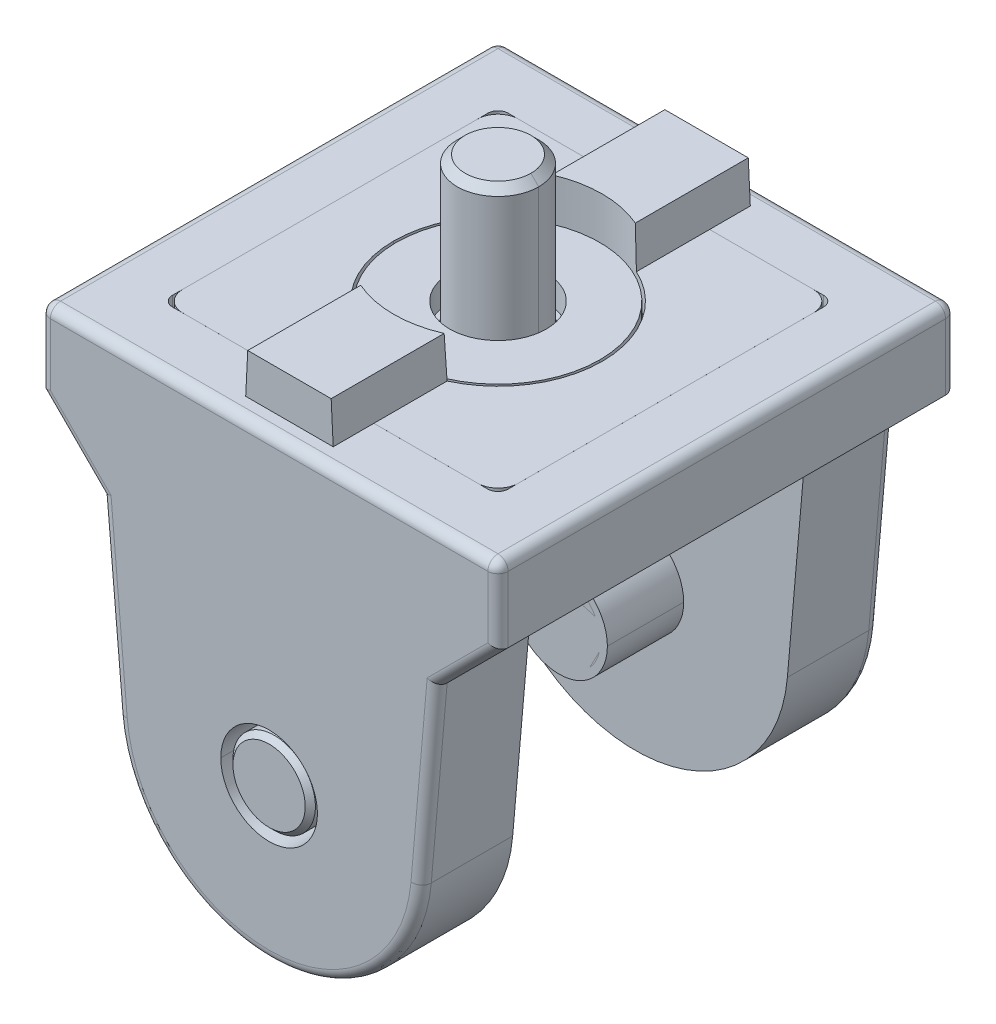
ISO-10303-21;
HEADER;
FILE_DESCRIPTION(('STEP AP214'),'2;1');
FILE_NAME('part.step','',(''),(''),'','','');
FILE_SCHEMA(('AUTOMOTIVE_DESIGN { 1 0 10303 214 1 1 1 1 }'));
ENDSEC;
DATA;
#1=APPLICATION_CONTEXT('core data for automotive mechanical design processes');
#2=APPLICATION_PROTOCOL_DEFINITION('international standard','automotive_design',2000,#1);
#3=PRODUCT_CONTEXT('',#1,'mechanical');
#4=PRODUCT('Part','Part','',(#3));
#5=PRODUCT_RELATED_PRODUCT_CATEGORY('part','',(#4));
#6=PRODUCT_DEFINITION_FORMATION('','',#4);
#7=PRODUCT_DEFINITION_CONTEXT('part definition',#1,'design');
#8=PRODUCT_DEFINITION('design','',#6,#7);
#9=PRODUCT_DEFINITION_SHAPE('','',#8);
#10=(LENGTH_UNIT() NAMED_UNIT(*) SI_UNIT(.MILLI.,.METRE.));
#11=(NAMED_UNIT(*) PLANE_ANGLE_UNIT() SI_UNIT($,.RADIAN.));
#12=(NAMED_UNIT(*) SI_UNIT($,.STERADIAN.) SOLID_ANGLE_UNIT());
#13=UNCERTAINTY_MEASURE_WITH_UNIT(LENGTH_MEASURE(1.E-05),#10,'distance_accuracy_value','');
#14=(GEOMETRIC_REPRESENTATION_CONTEXT(3) GLOBAL_UNCERTAINTY_ASSIGNED_CONTEXT((#13)) GLOBAL_UNIT_ASSIGNED_CONTEXT((#10,
#11,#12)) REPRESENTATION_CONTEXT('',''));
#15=CARTESIAN_POINT('',(0.,0.,0.));
#16=DIRECTION('',(0.,0.,1.));
#17=DIRECTION('',(1.,0.,0.));
#18=AXIS2_PLACEMENT_3D('',#15,#16,#17);
#19=CARTESIAN_POINT('',(0.,0.,0.));
#20=DIRECTION('',(0.,0.,1.));
#21=DIRECTION('',(1.,0.,0.));
#22=AXIS2_PLACEMENT_3D('',#19,#20,#21);
#23=CYLINDRICAL_SURFACE('',#22,4.05);
#24=CARTESIAN_POINT('',(0.,0.,0.499999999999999));
#25=DIRECTION('',(0.,0.,1.));
#26=DIRECTION('',(1.,0.,0.));
#27=AXIS2_PLACEMENT_3D('',#24,#25,#26);
#28=CIRCLE('',#27,4.05);
#29=CARTESIAN_POINT('',(4.05,0.,0.499999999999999));
#30=VERTEX_POINT('',#29);
#31=EDGE_CURVE('P0_E81',#30,#30,#28,.T.);
#32=ORIENTED_EDGE('',*,*,#31,.T.);
#33=EDGE_LOOP('',(#32));
#34=FACE_BOUND('',#33,.T.);
#35=CARTESIAN_POINT('',(0.,0.,16.5));
#36=DIRECTION('',(0.,0.,1.));
#37=DIRECTION('',(1.,0.,0.));
#38=AXIS2_PLACEMENT_3D('',#35,#36,#37);
#39=CIRCLE('',#38,4.05);
#40=CARTESIAN_POINT('',(4.05,0.,16.5));
#41=VERTEX_POINT('',#40);
#42=EDGE_CURVE('P0_E86',#41,#41,#39,.T.);
#43=ORIENTED_EDGE('',*,*,#42,.F.);
#44=EDGE_LOOP('',(#43));
#45=FACE_BOUND('',#44,.T.);
#46=ADVANCED_FACE('P0_F72',(#34,#45),#23,.T.);
#47=CARTESIAN_POINT('',(0.,0.,0.));
#48=DIRECTION('',(0.,0.,1.));
#49=DIRECTION('',(1.,0.,0.));
#50=AXIS2_PLACEMENT_3D('',#47,#48,#49);
#51=PLANE('',#50);
#52=CARTESIAN_POINT('',(0.,0.,0.));
#53=DIRECTION('',(0.,0.,1.));
#54=DIRECTION('',(1.,0.,0.));
#55=AXIS2_PLACEMENT_3D('',#52,#53,#54);
#56=CIRCLE('',#55,3.55);
#57=CARTESIAN_POINT('',(3.55,0.,0.));
#58=VERTEX_POINT('',#57);
#59=EDGE_CURVE('P0_E11',#58,#58,#56,.F.);
#60=ORIENTED_EDGE('',*,*,#59,.T.);
#61=EDGE_LOOP('',(#60));
#62=FACE_BOUND('',#61,.T.);
#63=ADVANCED_FACE('P0_F97',(#62),#51,.F.);
#64=CARTESIAN_POINT('',(0.,0.,16.5));
#65=DIRECTION('',(0.,0.,1.));
#66=DIRECTION('',(1.,0.,0.));
#67=AXIS2_PLACEMENT_3D('',#64,#65,#66);
#68=PLANE('',#67);
#69=ORIENTED_EDGE('',*,*,#42,.T.);
#70=EDGE_LOOP('',(#69));
#71=FACE_BOUND('',#70,.T.);
#72=ADVANCED_FACE('P0_F94',(#71),#68,.T.);
#73=CARTESIAN_POINT('',(0.,0.,0.499999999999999));
#74=DIRECTION('',(0.,0.,1.));
#75=DIRECTION('',(1.,0.,0.));
#76=AXIS2_PLACEMENT_3D('',#73,#74,#75);
#77=CONICAL_SURFACE('',#76,4.05,0.785398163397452);
#78=ORIENTED_EDGE('',*,*,#59,.F.);
#79=EDGE_LOOP('',(#78));
#80=FACE_BOUND('',#79,.T.);
#81=ORIENTED_EDGE('',*,*,#31,.F.);
#82=EDGE_LOOP('',(#81));
#83=FACE_BOUND('',#82,.T.);
#84=ADVANCED_FACE('P0_F75',(#80,#83),#77,.T.);
#85=CLOSED_SHELL('',(#46,#63,#72,#84));
#86=MANIFOLD_SOLID_BREP('P0_B2',#85);
#87=CARTESIAN_POINT('',(0.,0.,45.));
#88=DIRECTION('',(0.,0.,-1.));
#89=DIRECTION('',(-1.,0.,0.));
#90=AXIS2_PLACEMENT_3D('',#87,#88,#89);
#91=CYLINDRICAL_SURFACE('',#90,4.05);
#92=CARTESIAN_POINT('',(0.,0.,44.5));
#93=DIRECTION('',(0.,0.,-1.));
#94=DIRECTION('',(-1.,0.,0.));
#95=AXIS2_PLACEMENT_3D('',#92,#93,#94);
#96=CIRCLE('',#95,4.05);
#97=CARTESIAN_POINT('',(-4.05,0.,44.5));
#98=VERTEX_POINT('',#97);
#99=EDGE_CURVE('P0_E167',#98,#98,#96,.T.);
#100=ORIENTED_EDGE('',*,*,#99,.T.);
#101=EDGE_LOOP('',(#100));
#102=FACE_BOUND('',#101,.T.);
#103=CARTESIAN_POINT('',(0.,0.,28.5));
#104=DIRECTION('',(0.,0.,-1.));
#105=DIRECTION('',(-1.,0.,0.));
#106=AXIS2_PLACEMENT_3D('',#103,#104,#105);
#107=CIRCLE('',#106,4.05);
#108=CARTESIAN_POINT('',(-4.05,0.,28.5));
#109=VERTEX_POINT('',#108);
#110=EDGE_CURVE('P0_E171',#109,#109,#107,.T.);
#111=ORIENTED_EDGE('',*,*,#110,.F.);
#112=EDGE_LOOP('',(#111));
#113=FACE_BOUND('',#112,.T.);
#114=ADVANCED_FACE('P0_F159',(#102,#113),#91,.T.);
#115=CARTESIAN_POINT('',(0.,0.,45.));
#116=DIRECTION('',(0.,0.,-1.));
#117=DIRECTION('',(-1.,0.,0.));
#118=AXIS2_PLACEMENT_3D('',#115,#116,#117);
#119=PLANE('',#118);
#120=CARTESIAN_POINT('',(0.,0.,45.));
#121=DIRECTION('',(0.,0.,-1.));
#122=DIRECTION('',(-1.,0.,0.));
#123=AXIS2_PLACEMENT_3D('',#120,#121,#122);
#124=CIRCLE('',#123,3.55);
#125=CARTESIAN_POINT('',(-3.55,0.,45.));
#126=VERTEX_POINT('',#125);
#127=EDGE_CURVE('P0_E71',#126,#126,#124,.F.);
#128=ORIENTED_EDGE('',*,*,#127,.T.);
#129=EDGE_LOOP('',(#128));
#130=FACE_BOUND('',#129,.T.);
#131=ADVANCED_FACE('P0_F181',(#130),#119,.F.);
#132=CARTESIAN_POINT('',(0.,0.,28.5));
#133=DIRECTION('',(0.,0.,-1.));
#134=DIRECTION('',(-1.,0.,0.));
#135=AXIS2_PLACEMENT_3D('',#132,#133,#134);
#136=PLANE('',#135);
#137=ORIENTED_EDGE('',*,*,#110,.T.);
#138=EDGE_LOOP('',(#137));
#139=FACE_BOUND('',#138,.T.);
#140=ADVANCED_FACE('P0_F178',(#139),#136,.T.);
#141=CARTESIAN_POINT('',(0.,0.,44.5));
#142=DIRECTION('',(0.,0.,-1.));
#143=DIRECTION('',(-1.,0.,0.));
#144=AXIS2_PLACEMENT_3D('',#141,#142,#143);
#145=CONICAL_SURFACE('',#144,4.05,0.785398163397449);
#146=ORIENTED_EDGE('',*,*,#127,.F.);
#147=EDGE_LOOP('',(#146));
#148=FACE_BOUND('',#147,.T.);
#149=ORIENTED_EDGE('',*,*,#99,.F.);
#150=EDGE_LOOP('',(#149));
#151=FACE_BOUND('',#150,.T.);
#152=ADVANCED_FACE('P0_F162',(#148,#151),#145,.T.);
#153=CLOSED_SHELL('',(#114,#131,#140,#152));
#154=MANIFOLD_SOLID_BREP('P0_B6',#153);
#155=CARTESIAN_POINT('',(-15.72197299,7.59633193,0.));
#156=DIRECTION('',(-0.996193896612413,-0.0871649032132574,0.));
#157=DIRECTION('',(-0.0871649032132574,0.996193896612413,0.));
#158=AXIS2_PLACEMENT_3D('',#155,#156,#157);
#159=PLANE('',#158);
#160=DIRECTION('',(0.,0.,1.));
#161=VECTOR('',#160,1.);
#162=CARTESIAN_POINT('',(-16.50102551,16.5,0.));
#163=LINE('',#162,#161);
#164=CARTESIAN_POINT('',(-16.50102551,16.5,1.));
#165=VERTEX_POINT('',#164);
#166=CARTESIAN_POINT('',(-16.50102551,16.5,9.));
#167=VERTEX_POINT('',#166);
#168=EDGE_CURVE('P0_E559',#165,#167,#163,.T.);
#169=ORIENTED_EDGE('',*,*,#168,.F.);
#170=DIRECTION('',(0.0871649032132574,-0.996193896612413,0.));
#171=VECTOR('',#170,1.);
#172=CARTESIAN_POINT('',(-14.94292047,-1.30733614,1.));
#173=LINE('',#172,#171);
#174=CARTESIAN_POINT('',(-14.94292047,-1.30733614,1.));
#175=VERTEX_POINT('',#174);
#176=EDGE_CURVE('P0_E769',#165,#175,#173,.T.);
#177=ORIENTED_EDGE('',*,*,#176,.T.);
#178=DIRECTION('',(0.,0.,1.));
#179=VECTOR('',#178,1.);
#180=CARTESIAN_POINT('',(-14.94292047,-1.30733614,0.));
#181=LINE('',#180,#179);
#182=CARTESIAN_POINT('',(-14.94292047,-1.30733614,9.));
#183=VERTEX_POINT('',#182);
#184=EDGE_CURVE('P0_E744',#175,#183,#181,.T.);
#185=ORIENTED_EDGE('',*,*,#184,.T.);
#186=DIRECTION('',(-0.0871649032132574,0.996193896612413,0.));
#187=VECTOR('',#186,1.);
#188=CARTESIAN_POINT('',(-15.3650031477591,3.51658004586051,9.));
#189=LINE('',#188,#187);
#190=EDGE_CURVE('P0_E632',#183,#167,#189,.T.);
#191=ORIENTED_EDGE('',*,*,#190,.T.);
#192=EDGE_LOOP('',(#169,#177,#185,#191));
#193=FACE_BOUND('',#192,.T.);
#194=ADVANCED_FACE('P0_F233',(#193),#159,.T.);
#195=CARTESIAN_POINT('',(0.,0.,0.));
#196=DIRECTION('',(0.,0.,1.));
#197=DIRECTION('',(-0.996194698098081,-0.0871557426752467,0.));
#198=AXIS2_PLACEMENT_3D('',#195,#196,#197);
#199=CYLINDRICAL_SURFACE('',#198,14.9999999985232);
#200=ORIENTED_EDGE('',*,*,#184,.F.);
#201=CARTESIAN_POINT('',(0.,0.,1.));
#202=DIRECTION('',(0.,0.,1.));
#203=DIRECTION('',(1.,0.,0.));
#204=AXIS2_PLACEMENT_3D('',#201,#202,#203);
#205=CIRCLE('',#204,14.9999999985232);
#206=CARTESIAN_POINT('',(14.94292047,-1.30733614,1.));
#207=VERTEX_POINT('',#206);
#208=EDGE_CURVE('P0_E788',#175,#207,#205,.T.);
#209=ORIENTED_EDGE('',*,*,#208,.T.);
#210=DIRECTION('',(0.,0.,1.));
#211=VECTOR('',#210,1.);
#212=CARTESIAN_POINT('',(14.94292047,-1.30733614,0.));
#213=LINE('',#212,#211);
#214=CARTESIAN_POINT('',(14.94292047,-1.30733614,9.));
#215=VERTEX_POINT('',#214);
#216=EDGE_CURVE('P0_E622',#207,#215,#213,.T.);
#217=ORIENTED_EDGE('',*,*,#216,.T.);
#218=CARTESIAN_POINT('',(0.,0.,9.));
#219=DIRECTION('',(0.,0.,-1.));
#220=DIRECTION('',(-0.996194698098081,-0.0871557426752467,0.));
#221=AXIS2_PLACEMENT_3D('',#218,#219,#220);
#222=CIRCLE('',#221,14.9999999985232);
#223=EDGE_CURVE('P0_E636',#215,#183,#222,.T.);
#224=ORIENTED_EDGE('',*,*,#223,.T.);
#225=EDGE_LOOP('',(#200,#209,#217,#224));
#226=FACE_BOUND('',#225,.T.);
#227=ADVANCED_FACE('P0_F913',(#226),#199,.T.);
#228=CARTESIAN_POINT('',(22.4999175,26.24905699,0.));
#229=DIRECTION('',(1.,0.,0.));
#230=DIRECTION('',(0.,1.,0.));
#231=AXIS2_PLACEMENT_3D('',#228,#229,#230);
#232=PLANE('',#231);
#233=DIRECTION('',(0.,0.,1.));
#234=VECTOR('',#233,1.);
#235=CARTESIAN_POINT('',(22.4999175,28.99905699,0.));
#236=LINE('',#235,#234);
#237=CARTESIAN_POINT('',(22.4999175,28.99905699,1.));
#238=VERTEX_POINT('',#237);
#239=CARTESIAN_POINT('',(22.4999175,28.99905699,44.));
#240=VERTEX_POINT('',#239);
#241=EDGE_CURVE('P0_E248',#238,#240,#236,.T.);
#242=ORIENTED_EDGE('',*,*,#241,.T.);
#243=DIRECTION('',(0.,-1.,0.));
#244=VECTOR('',#243,1.);
#245=CARTESIAN_POINT('',(22.4999175,26.24905699,44.));
#246=LINE('',#245,#244);
#247=CARTESIAN_POINT('',(22.4999175,22.49905699,44.));
#248=VERTEX_POINT('',#247);
#249=EDGE_CURVE('P0_E240',#240,#248,#246,.T.);
#250=ORIENTED_EDGE('',*,*,#249,.T.);
#251=DIRECTION('',(0.,0.,1.));
#252=VECTOR('',#251,1.);
#253=CARTESIAN_POINT('',(22.4999175,22.49905699,0.));
#254=LINE('',#253,#252);
#255=CARTESIAN_POINT('',(22.4999175,22.49905699,1.));
#256=VERTEX_POINT('',#255);
#257=EDGE_CURVE('P0_E614',#256,#248,#254,.T.);
#258=ORIENTED_EDGE('',*,*,#257,.F.);
#259=DIRECTION('',(0.,1.,0.));
#260=VECTOR('',#259,1.);
#261=CARTESIAN_POINT('',(22.4999175,29.99905699,1.));
#262=LINE('',#261,#260);
#263=EDGE_CURVE('P0_E253',#256,#238,#262,.T.);
#264=ORIENTED_EDGE('',*,*,#263,.T.);
#265=EDGE_LOOP('',(#242,#250,#258,#264));
#266=FACE_BOUND('',#265,.T.);
#267=ADVANCED_FACE('P0_F954',(#266),#232,.T.);
#268=CARTESIAN_POINT('',(0.,27.,22.5));
#269=DIRECTION('',(0.,-1.,0.));
#270=DIRECTION('',(0.,0.,-1.));
#271=AXIS2_PLACEMENT_3D('',#268,#269,#270);
#272=PLANE('',#271);
#273=CARTESIAN_POINT('',(0.,27.,22.5));
#274=DIRECTION('',(0.,-1.,0.));
#275=DIRECTION('',(1.,0.,0.));
#276=AXIS2_PLACEMENT_3D('',#273,#274,#275);
#277=CIRCLE('',#276,4.5);
#278=CARTESIAN_POINT('',(-4.5,27.,22.5));
#279=VERTEX_POINT('',#278);
#280=CARTESIAN_POINT('',(4.5,27.,22.5));
#281=VERTEX_POINT('',#280);
#282=EDGE_CURVE('P0_E737',#279,#281,#277,.T.);
#283=ORIENTED_EDGE('',*,*,#282,.T.);
#284=CARTESIAN_POINT('',(0.,27.,22.5));
#285=DIRECTION('',(0.,-1.,0.));
#286=DIRECTION('',(1.,0.,0.));
#287=AXIS2_PLACEMENT_3D('',#284,#285,#286);
#288=CIRCLE('',#287,4.5);
#289=EDGE_CURVE('P0_E740',#281,#279,#288,.T.);
#290=ORIENTED_EDGE('',*,*,#289,.T.);
#291=EDGE_LOOP('',(#283,#290));
#292=FACE_BOUND('',#291,.T.);
#293=DIRECTION('',(0.,0.,1.));
#294=VECTOR('',#293,1.);
#295=CARTESIAN_POINT('',(-16.5,27.,8.));
#296=LINE('',#295,#294);
#297=CARTESIAN_POINT('',(-16.5,27.,7.));
#298=VERTEX_POINT('',#297);
#299=CARTESIAN_POINT('',(-16.5,27.,38.));
#300=VERTEX_POINT('',#299);
#301=EDGE_CURVE('P0_E683',#298,#300,#296,.T.);
#302=ORIENTED_EDGE('',*,*,#301,.T.);
#303=CARTESIAN_POINT('',(-15.5,27.,38.));
#304=DIRECTION('',(0.,1.,0.));
#305=DIRECTION('',(0.,0.,1.));
#306=AXIS2_PLACEMENT_3D('',#303,#304,#305);
#307=CIRCLE('',#306,1.);
#308=CARTESIAN_POINT('',(-15.5,27.,39.));
#309=VERTEX_POINT('',#308);
#310=EDGE_CURVE('P0_E694',#300,#309,#307,.T.);
#311=ORIENTED_EDGE('',*,*,#310,.T.);
#312=DIRECTION('',(1.,0.,0.));
#313=VECTOR('',#312,1.);
#314=CARTESIAN_POINT('',(-14.5,27.,39.));
#315=LINE('',#314,#313);
#316=CARTESIAN_POINT('',(15.5,27.,39.));
#317=VERTEX_POINT('',#316);
#318=EDGE_CURVE('P0_E701',#309,#317,#315,.T.);
#319=ORIENTED_EDGE('',*,*,#318,.T.);
#320=CARTESIAN_POINT('',(15.5,27.,38.));
#321=DIRECTION('',(0.,1.,0.));
#322=DIRECTION('',(1.,0.,0.));
#323=AXIS2_PLACEMENT_3D('',#320,#321,#322);
#324=CIRCLE('',#323,1.);
#325=CARTESIAN_POINT('',(16.5,27.,38.));
#326=VERTEX_POINT('',#325);
#327=EDGE_CURVE('P0_E708',#317,#326,#324,.T.);
#328=ORIENTED_EDGE('',*,*,#327,.T.);
#329=DIRECTION('',(0.,0.,-1.));
#330=VECTOR('',#329,1.);
#331=CARTESIAN_POINT('',(16.5,27.,37.));
#332=LINE('',#331,#330);
#333=CARTESIAN_POINT('',(16.5,27.,7.));
#334=VERTEX_POINT('',#333);
#335=EDGE_CURVE('P0_E715',#326,#334,#332,.T.);
#336=ORIENTED_EDGE('',*,*,#335,.T.);
#337=CARTESIAN_POINT('',(15.5,27.,7.));
#338=DIRECTION('',(0.,1.,0.));
#339=DIRECTION('',(0.,0.,-1.));
#340=AXIS2_PLACEMENT_3D('',#337,#338,#339);
#341=CIRCLE('',#340,1.);
#342=CARTESIAN_POINT('',(15.5,27.,6.));
#343=VERTEX_POINT('',#342);
#344=EDGE_CURVE('P0_E722',#334,#343,#341,.T.);
#345=ORIENTED_EDGE('',*,*,#344,.T.);
#346=DIRECTION('',(-1.,0.,0.));
#347=VECTOR('',#346,1.);
#348=CARTESIAN_POINT('',(14.5,27.,6.));
#349=LINE('',#348,#347);
#350=CARTESIAN_POINT('',(-15.5,27.,6.));
#351=VERTEX_POINT('',#350);
#352=EDGE_CURVE('P0_E729',#343,#351,#349,.T.);
#353=ORIENTED_EDGE('',*,*,#352,.T.);
#354=CARTESIAN_POINT('',(-15.5,27.,7.));
#355=DIRECTION('',(0.,1.,0.));
#356=DIRECTION('',(-1.,0.,0.));
#357=AXIS2_PLACEMENT_3D('',#354,#355,#356);
#358=CIRCLE('',#357,1.);
#359=EDGE_CURVE('P0_E733',#351,#298,#358,.T.);
#360=ORIENTED_EDGE('',*,*,#359,.T.);
#361=EDGE_LOOP('',(#302,#311,#319,#328,#336,#345,#353,#360));
#362=FACE_BOUND('',#361,.T.);
#363=ADVANCED_FACE('P0_F1045',(#292,#362),#272,.F.);
#364=CARTESIAN_POINT('',(-15.5,30.,7.));
#365=DIRECTION('',(0.,-1.,0.));
#366=DIRECTION('',(-1.,0.,0.));
#367=AXIS2_PLACEMENT_3D('',#364,#365,#366);
#368=CYLINDRICAL_SURFACE('',#367,1.);
#369=CARTESIAN_POINT('',(-15.5,29.99905699,7.));
#370=DIRECTION('',(0.,-1.,0.));
#371=DIRECTION('',(-1.,0.,0.));
#372=AXIS2_PLACEMENT_3D('',#369,#370,#371);
#373=CIRCLE('',#372,1.);
#374=CARTESIAN_POINT('',(-16.5,29.99905699,7.));
#375=VERTEX_POINT('',#374);
#376=CARTESIAN_POINT('',(-15.5,29.99905699,6.));
#377=VERTEX_POINT('',#376);
#378=EDGE_CURVE('P0_E658',#375,#377,#373,.T.);
#379=ORIENTED_EDGE('',*,*,#378,.F.);
#380=DIRECTION('',(0.,-1.,0.));
#381=VECTOR('',#380,1.);
#382=CARTESIAN_POINT('',(-16.5,30.,7.));
#383=LINE('',#382,#381);
#384=EDGE_CURVE('P0_E687',#375,#298,#383,.T.);
#385=ORIENTED_EDGE('',*,*,#384,.T.);
#386=ORIENTED_EDGE('',*,*,#359,.F.);
#387=DIRECTION('',(0.,-1.,0.));
#388=VECTOR('',#387,1.);
#389=CARTESIAN_POINT('',(-15.5,30.,6.));
#390=LINE('',#389,#388);
#391=EDGE_CURVE('P0_E726',#377,#351,#390,.T.);
#392=ORIENTED_EDGE('',*,*,#391,.F.);
#393=EDGE_LOOP('',(#379,#385,#386,#392));
#394=FACE_BOUND('',#393,.T.);
#395=ADVANCED_FACE('P0_F1041',(#394),#368,.F.);
#396=CARTESIAN_POINT('',(-15.,30.,6.));
#397=DIRECTION('',(0.,0.,-1.));
#398=DIRECTION('',(0.,-1.,0.));
#399=AXIS2_PLACEMENT_3D('',#396,#397,#398);
#400=PLANE('',#399);
#401=DIRECTION('',(1.,0.,0.));
#402=VECTOR('',#401,1.);
#403=CARTESIAN_POINT('',(-0.80004125,29.99905699,6.));
#404=LINE('',#403,#402);
#405=CARTESIAN_POINT('',(15.5,29.99905699,6.));
#406=VERTEX_POINT('',#405);
#407=EDGE_CURVE('P0_E661',#377,#406,#404,.T.);
#408=ORIENTED_EDGE('',*,*,#407,.F.);
#409=ORIENTED_EDGE('',*,*,#391,.T.);
#410=ORIENTED_EDGE('',*,*,#352,.F.);
#411=DIRECTION('',(0.,-1.,0.));
#412=VECTOR('',#411,1.);
#413=CARTESIAN_POINT('',(15.5,30.,6.));
#414=LINE('',#413,#412);
#415=EDGE_CURVE('P0_E719',#406,#343,#414,.T.);
#416=ORIENTED_EDGE('',*,*,#415,.F.);
#417=EDGE_LOOP('',(#408,#409,#410,#416));
#418=FACE_BOUND('',#417,.T.);
#419=ADVANCED_FACE('P0_F1071',(#418),#400,.F.);
#420=CARTESIAN_POINT('',(15.5,30.,7.));
#421=DIRECTION('',(0.,-1.,0.));
#422=DIRECTION('',(0.,0.,-1.));
#423=AXIS2_PLACEMENT_3D('',#420,#421,#422);
#424=CYLINDRICAL_SURFACE('',#423,1.);
#425=CARTESIAN_POINT('',(15.5,29.99905699,7.));
#426=DIRECTION('',(0.,-1.,0.));
#427=DIRECTION('',(0.,0.,-1.));
#428=AXIS2_PLACEMENT_3D('',#425,#426,#427);
#429=CIRCLE('',#428,1.);
#430=CARTESIAN_POINT('',(16.5,29.99905699,7.));
#431=VERTEX_POINT('',#430);
#432=EDGE_CURVE('P0_E664',#406,#431,#429,.T.);
#433=ORIENTED_EDGE('',*,*,#432,.F.);
#434=ORIENTED_EDGE('',*,*,#415,.T.);
#435=ORIENTED_EDGE('',*,*,#344,.F.);
#436=DIRECTION('',(0.,-1.,0.));
#437=VECTOR('',#436,1.);
#438=CARTESIAN_POINT('',(16.5,30.,7.));
#439=LINE('',#438,#437);
#440=EDGE_CURVE('P0_E712',#431,#334,#439,.T.);
#441=ORIENTED_EDGE('',*,*,#440,.F.);
#442=EDGE_LOOP('',(#433,#434,#435,#441));
#443=FACE_BOUND('',#442,.T.);
#444=ADVANCED_FACE('P0_F1068',(#443),#424,.F.);
#445=CARTESIAN_POINT('',(16.5,30.,7.5));
#446=DIRECTION('',(1.,0.,0.));
#447=DIRECTION('',(0.,1.,0.));
#448=AXIS2_PLACEMENT_3D('',#445,#446,#447);
#449=PLANE('',#448);
#450=DIRECTION('',(0.,0.,1.));
#451=VECTOR('',#450,1.);
#452=CARTESIAN_POINT('',(16.5,29.99905699,3.75));
#453=LINE('',#452,#451);
#454=CARTESIAN_POINT('',(16.5,29.99905699,38.));
#455=VERTEX_POINT('',#454);
#456=EDGE_CURVE('P0_E667',#431,#455,#453,.T.);
#457=ORIENTED_EDGE('',*,*,#456,.F.);
#458=ORIENTED_EDGE('',*,*,#440,.T.);
#459=ORIENTED_EDGE('',*,*,#335,.F.);
#460=DIRECTION('',(0.,-1.,0.));
#461=VECTOR('',#460,1.);
#462=CARTESIAN_POINT('',(16.5,30.,38.));
#463=LINE('',#462,#461);
#464=EDGE_CURVE('P0_E705',#455,#326,#463,.T.);
#465=ORIENTED_EDGE('',*,*,#464,.F.);
#466=EDGE_LOOP('',(#457,#458,#459,#465));
#467=FACE_BOUND('',#466,.T.);
#468=ADVANCED_FACE('P0_F1062',(#467),#449,.F.);
#469=CARTESIAN_POINT('',(15.5,30.,38.));
#470=DIRECTION('',(0.,-1.,0.));
#471=DIRECTION('',(1.,0.,0.));
#472=AXIS2_PLACEMENT_3D('',#469,#470,#471);
#473=CYLINDRICAL_SURFACE('',#472,1.);
#474=CARTESIAN_POINT('',(15.5,29.99905699,38.));
#475=DIRECTION('',(0.,-1.,0.));
#476=DIRECTION('',(1.,0.,0.));
#477=AXIS2_PLACEMENT_3D('',#474,#475,#476);
#478=CIRCLE('',#477,1.);
#479=CARTESIAN_POINT('',(15.5,29.99905699,39.));
#480=VERTEX_POINT('',#479);
#481=EDGE_CURVE('P0_E670',#455,#480,#478,.T.);
#482=ORIENTED_EDGE('',*,*,#481,.F.);
#483=ORIENTED_EDGE('',*,*,#464,.T.);
#484=ORIENTED_EDGE('',*,*,#327,.F.);
#485=DIRECTION('',(0.,-1.,0.));
#486=VECTOR('',#485,1.);
#487=CARTESIAN_POINT('',(15.5,30.,39.));
#488=LINE('',#487,#486);
#489=EDGE_CURVE('P0_E698',#480,#317,#488,.T.);
#490=ORIENTED_EDGE('',*,*,#489,.F.);
#491=EDGE_LOOP('',(#482,#483,#484,#490));
#492=FACE_BOUND('',#491,.T.);
#493=ADVANCED_FACE('P0_F1058',(#492),#473,.F.);
#494=CARTESIAN_POINT('',(15.,30.,39.));
#495=DIRECTION('',(0.,0.,1.));
#496=DIRECTION('',(1.,0.,0.));
#497=AXIS2_PLACEMENT_3D('',#494,#495,#496);
#498=PLANE('',#497);
#499=DIRECTION('',(-1.,0.,0.));
#500=VECTOR('',#499,1.);
#501=CARTESIAN_POINT('',(14.19995875,29.99905699,39.));
#502=LINE('',#501,#500);
#503=CARTESIAN_POINT('',(-15.5,29.99905699,39.));
#504=VERTEX_POINT('',#503);
#505=EDGE_CURVE('P0_E673',#480,#504,#502,.T.);
#506=ORIENTED_EDGE('',*,*,#505,.F.);
#507=ORIENTED_EDGE('',*,*,#489,.T.);
#508=ORIENTED_EDGE('',*,*,#318,.F.);
#509=DIRECTION('',(0.,-1.,0.));
#510=VECTOR('',#509,1.);
#511=CARTESIAN_POINT('',(-15.5,30.,39.));
#512=LINE('',#511,#510);
#513=EDGE_CURVE('P0_E691',#504,#309,#512,.T.);
#514=ORIENTED_EDGE('',*,*,#513,.F.);
#515=EDGE_LOOP('',(#506,#507,#508,#514));
#516=FACE_BOUND('',#515,.T.);
#517=ADVANCED_FACE('P0_F1052',(#516),#498,.F.);
#518=CARTESIAN_POINT('',(-15.5,30.,38.));
#519=DIRECTION('',(0.,-1.,0.));
#520=DIRECTION('',(0.,0.,1.));
#521=AXIS2_PLACEMENT_3D('',#518,#519,#520);
#522=CYLINDRICAL_SURFACE('',#521,1.);
#523=CARTESIAN_POINT('',(-15.5,29.99905699,38.));
#524=DIRECTION('',(0.,-1.,0.));
#525=DIRECTION('',(0.,0.,1.));
#526=AXIS2_PLACEMENT_3D('',#523,#524,#525);
#527=CIRCLE('',#526,1.);
#528=CARTESIAN_POINT('',(-16.5,29.99905699,38.));
#529=VERTEX_POINT('',#528);
#530=EDGE_CURVE('P0_E676',#504,#529,#527,.T.);
#531=ORIENTED_EDGE('',*,*,#530,.F.);
#532=ORIENTED_EDGE('',*,*,#513,.T.);
#533=ORIENTED_EDGE('',*,*,#310,.F.);
#534=DIRECTION('',(0.,-1.,0.));
#535=VECTOR('',#534,1.);
#536=CARTESIAN_POINT('',(-16.5,30.,38.));
#537=LINE('',#536,#535);
#538=EDGE_CURVE('P0_E680',#529,#300,#537,.T.);
#539=ORIENTED_EDGE('',*,*,#538,.F.);
#540=EDGE_LOOP('',(#531,#532,#533,#539));
#541=FACE_BOUND('',#540,.T.);
#542=ADVANCED_FACE('P0_F1048',(#541),#522,.F.);
#543=CARTESIAN_POINT('',(-16.5,30.,37.5));
#544=DIRECTION('',(-1.,0.,0.));
#545=DIRECTION('',(0.,0.,1.));
#546=AXIS2_PLACEMENT_3D('',#543,#544,#545);
#547=PLANE('',#546);
#548=DIRECTION('',(0.,0.,-1.));
#549=VECTOR('',#548,1.);
#550=CARTESIAN_POINT('',(-16.5,29.99905699,18.75));
#551=LINE('',#550,#549);
#552=EDGE_CURVE('P0_E655',#529,#375,#551,.T.);
#553=ORIENTED_EDGE('',*,*,#552,.F.);
#554=ORIENTED_EDGE('',*,*,#538,.T.);
#555=ORIENTED_EDGE('',*,*,#301,.F.);
#556=ORIENTED_EDGE('',*,*,#384,.F.);
#557=EDGE_LOOP('',(#553,#554,#555,#556));
#558=FACE_BOUND('',#557,.T.);
#559=ADVANCED_FACE('P0_F1031',(#558),#547,.F.);
#560=CARTESIAN_POINT('',(13.3999175,29.99905699,0.));
#561=DIRECTION('',(0.,1.,0.));
#562=DIRECTION('',(1.,0.,0.));
#563=AXIS2_PLACEMENT_3D('',#560,#561,#562);
#564=PLANE('',#563);
#565=DIRECTION('',(-1.,0.,0.));
#566=VECTOR('',#565,1.);
#567=CARTESIAN_POINT('',(-22.5000825,29.99905699,1.));
#568=LINE('',#567,#566);
#569=CARTESIAN_POINT('',(21.4999175,29.99905699,1.));
#570=VERTEX_POINT('',#569);
#571=CARTESIAN_POINT('',(-21.5000825,29.99905699,1.));
#572=VERTEX_POINT('',#571);
#573=EDGE_CURVE('P0_E790',#570,#572,#568,.T.);
#574=ORIENTED_EDGE('',*,*,#573,.T.);
#575=DIRECTION('',(0.,0.,1.));
#576=VECTOR('',#575,1.);
#577=CARTESIAN_POINT('',(-21.5000825,29.99905699,0.));
#578=LINE('',#577,#576);
#579=CARTESIAN_POINT('',(-21.5000825,29.99905699,44.));
#580=VERTEX_POINT('',#579);
#581=EDGE_CURVE('P0_E796',#572,#580,#578,.T.);
#582=ORIENTED_EDGE('',*,*,#581,.T.);
#583=DIRECTION('',(1.,0.,0.));
#584=VECTOR('',#583,1.);
#585=CARTESIAN_POINT('',(13.3999175,29.99905699,44.));
#586=LINE('',#585,#584);
#587=CARTESIAN_POINT('',(21.4999175,29.99905699,44.));
#588=VERTEX_POINT('',#587);
#589=EDGE_CURVE('P0_E794',#580,#588,#586,.T.);
#590=ORIENTED_EDGE('',*,*,#589,.T.);
#591=DIRECTION('',(0.,0.,1.));
#592=VECTOR('',#591,1.);
#593=CARTESIAN_POINT('',(21.4999175,29.99905699,0.));
#594=LINE('',#593,#592);
#595=EDGE_CURVE('P0_E792',#588,#570,#594,.F.);
#596=ORIENTED_EDGE('',*,*,#595,.T.);
#597=EDGE_LOOP('',(#574,#582,#590,#596));
#598=FACE_BOUND('',#597,.T.);
#599=ORIENTED_EDGE('',*,*,#552,.T.);
#600=ORIENTED_EDGE('',*,*,#378,.T.);
#601=ORIENTED_EDGE('',*,*,#407,.T.);
#602=ORIENTED_EDGE('',*,*,#432,.T.);
#603=ORIENTED_EDGE('',*,*,#456,.T.);
#604=ORIENTED_EDGE('',*,*,#481,.T.);
#605=ORIENTED_EDGE('',*,*,#505,.T.);
#606=ORIENTED_EDGE('',*,*,#530,.T.);
#607=EDGE_LOOP('',(#599,#600,#601,#602,#603,#604,#605,#606));
#608=FACE_BOUND('',#607,.T.);
#609=ADVANCED_FACE('P0_F1028',(#598,#608),#564,.T.);
#610=CARTESIAN_POINT('',(-22.5000825,26.24905699,0.));
#611=DIRECTION('',(-1.,0.,0.));
#612=DIRECTION('',(0.,0.,1.));
#613=AXIS2_PLACEMENT_3D('',#610,#611,#612);
#614=PLANE('',#613);
#615=DIRECTION('',(0.,0.,1.));
#616=VECTOR('',#615,1.);
#617=CARTESIAN_POINT('',(-22.5000825,22.49905699,0.));
#618=LINE('',#617,#616);
#619=CARTESIAN_POINT('',(-22.5000825,22.49905699,1.));
#620=VERTEX_POINT('',#619);
#621=CARTESIAN_POINT('',(-22.5000825,22.49905699,44.));
#622=VERTEX_POINT('',#621);
#623=EDGE_CURVE('P0_E555',#620,#622,#618,.T.);
#624=ORIENTED_EDGE('',*,*,#623,.T.);
#625=DIRECTION('',(0.,1.,0.));
#626=VECTOR('',#625,1.);
#627=CARTESIAN_POINT('',(-22.5000825,26.24905699,44.));
#628=LINE('',#627,#626);
#629=CARTESIAN_POINT('',(-22.5000825,28.99905699,44.));
#630=VERTEX_POINT('',#629);
#631=EDGE_CURVE('P0_E803',#622,#630,#628,.T.);
#632=ORIENTED_EDGE('',*,*,#631,.T.);
#633=DIRECTION('',(0.,0.,1.));
#634=VECTOR('',#633,1.);
#635=CARTESIAN_POINT('',(-22.5000825,28.99905699,0.));
#636=LINE('',#635,#634);
#637=CARTESIAN_POINT('',(-22.5000825,28.99905699,1.));
#638=VERTEX_POINT('',#637);
#639=EDGE_CURVE('P0_E801',#630,#638,#636,.F.);
#640=ORIENTED_EDGE('',*,*,#639,.T.);
#641=DIRECTION('',(0.,-1.,0.));
#642=VECTOR('',#641,1.);
#643=CARTESIAN_POINT('',(-22.5000825,22.49905699,1.));
#644=LINE('',#643,#642);
#645=EDGE_CURVE('P0_E799',#638,#620,#644,.T.);
#646=ORIENTED_EDGE('',*,*,#645,.T.);
#647=EDGE_LOOP('',(#624,#632,#640,#646));
#648=FACE_BOUND('',#647,.T.);
#649=ADVANCED_FACE('P0_F990',(#648),#614,.T.);
#650=CARTESIAN_POINT('',(-5.12049466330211E-05,12.3155361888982,0.));
#651=DIRECTION('',(0.,0.,1.));
#652=DIRECTION('',(1.,0.,0.));
#653=AXIS2_PLACEMENT_3D('',#650,#651,#652);
#654=PLANE('',#653);
#655=DIRECTION('',(0.707106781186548,-0.707106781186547,0.));
#656=VECTOR('',#655,1.);
#657=CARTESIAN_POINT('',(-21.7929757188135,23.2061637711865,0.));
#658=LINE('',#657,#656);
#659=CARTESIAN_POINT('',(-15.5365565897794,16.9497446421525,0.));
#660=VERTEX_POINT('',#659);
#661=CARTESIAN_POINT('',(-21.5000825,22.9132705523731,0.));
#662=VERTEX_POINT('',#661);
#663=EDGE_CURVE('P0_E784',#660,#662,#658,.F.);
#664=ORIENTED_EDGE('',*,*,#663,.T.);
#665=DIRECTION('',(0.,-1.,0.));
#666=VECTOR('',#665,1.);
#667=CARTESIAN_POINT('',(-21.5000825,29.99905699,0.));
#668=LINE('',#667,#666);
#669=CARTESIAN_POINT('',(-21.5000825,28.99905699,0.));
#670=VERTEX_POINT('',#669);
#671=EDGE_CURVE('P0_E786',#662,#670,#668,.F.);
#672=ORIENTED_EDGE('',*,*,#671,.T.);
#673=DIRECTION('',(-1.,0.,0.));
#674=VECTOR('',#673,1.);
#675=CARTESIAN_POINT('',(22.4999175,28.99905699,0.));
#676=LINE('',#675,#674);
#677=CARTESIAN_POINT('',(21.4999175,28.99905699,0.));
#678=VERTEX_POINT('',#677);
#679=EDGE_CURVE('P0_E777',#670,#678,#676,.F.);
#680=ORIENTED_EDGE('',*,*,#679,.T.);
#681=DIRECTION('',(0.,1.,0.));
#682=VECTOR('',#681,1.);
#683=CARTESIAN_POINT('',(21.4999175,22.49905699,0.));
#684=LINE('',#683,#682);
#685=CARTESIAN_POINT('',(21.4999175,22.9132705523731,0.));
#686=VERTEX_POINT('',#685);
#687=EDGE_CURVE('P0_E771',#678,#686,#684,.F.);
#688=ORIENTED_EDGE('',*,*,#687,.T.);
#689=DIRECTION('',(0.707106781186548,0.707106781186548,0.));
#690=VECTOR('',#689,1.);
#691=CARTESIAN_POINT('',(15.7937537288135,17.2071067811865,0.));
#692=LINE('',#691,#690);
#693=CARTESIAN_POINT('',(15.5363879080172,16.9497409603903,0.));
#694=VERTEX_POINT('',#693);
#695=EDGE_CURVE('P0_E773',#686,#694,#692,.F.);
#696=ORIENTED_EDGE('',*,*,#695,.T.);
#697=DIRECTION('',(0.0871557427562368,0.996194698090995,0.));
#698=VECTOR('',#697,1.);
#699=CARTESIAN_POINT('',(13.946725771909,-1.22018039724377,0.));
#700=LINE('',#699,#698);
#701=CARTESIAN_POINT('',(13.9467257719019,-1.22018039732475,0.));
#702=VERTEX_POINT('',#701);
#703=EDGE_CURVE('P0_E775',#694,#702,#700,.F.);
#704=ORIENTED_EDGE('',*,*,#703,.T.);
#705=CARTESIAN_POINT('',(0.,0.,0.));
#706=DIRECTION('',(0.,0.,1.));
#707=DIRECTION('',(1.,0.,0.));
#708=AXIS2_PLACEMENT_3D('',#705,#706,#707);
#709=CIRCLE('',#708,13.9999999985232);
#710=CARTESIAN_POINT('',(-13.9467265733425,-1.2201712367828,0.));
#711=VERTEX_POINT('',#710);
#712=EDGE_CURVE('P0_E779',#702,#711,#709,.F.);
#713=ORIENTED_EDGE('',*,*,#712,.T.);
#714=DIRECTION('',(0.0871649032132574,-0.996193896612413,0.));
#715=VECTOR('',#714,1.);
#716=CARTESIAN_POINT('',(-15.5048316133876,16.5871649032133,0.));
#717=LINE('',#716,#715);
#718=EDGE_CURVE('P0_E781',#711,#660,#717,.F.);
#719=ORIENTED_EDGE('',*,*,#718,.T.);
#720=EDGE_LOOP('',(#664,#672,#680,#688,#696,#704,#713,#719));
#721=FACE_BOUND('',#720,.T.);
#722=CARTESIAN_POINT('',(0.,0.,0.));
#723=DIRECTION('',(0.,0.,1.));
#724=DIRECTION('',(1.,0.,0.));
#725=AXIS2_PLACEMENT_3D('',#722,#723,#724);
#726=CIRCLE('',#725,4.75);
#727=CARTESIAN_POINT('',(-4.75,0.,0.));
#728=VERTEX_POINT('',#727);
#729=CARTESIAN_POINT('',(4.75,0.,0.));
#730=VERTEX_POINT('',#729);
#731=EDGE_CURVE('P0_E651',#728,#730,#726,.T.);
#732=ORIENTED_EDGE('',*,*,#731,.T.);
#733=CARTESIAN_POINT('',(0.,0.,0.));
#734=DIRECTION('',(0.,0.,1.));
#735=DIRECTION('',(1.,0.,0.));
#736=AXIS2_PLACEMENT_3D('',#733,#734,#735);
#737=CIRCLE('',#736,4.75);
#738=EDGE_CURVE('P0_E647',#730,#728,#737,.T.);
#739=ORIENTED_EDGE('',*,*,#738,.T.);
#740=EDGE_LOOP('',(#732,#739));
#741=FACE_BOUND('',#740,.T.);
#742=ADVANCED_FACE('P0_F927',(#721,#741),#654,.F.);
#743=CARTESIAN_POINT('',(0.,0.,23.));
#744=DIRECTION('',(0.,0.,1.));
#745=DIRECTION('',(1.,0.,0.));
#746=AXIS2_PLACEMENT_3D('',#743,#744,#745);
#747=CYLINDRICAL_SURFACE('',#746,4.75);
#748=DIRECTION('',(0.,0.,-1.));
#749=VECTOR('',#748,1.);
#750=CARTESIAN_POINT('',(4.75,0.,4.5));
#751=LINE('',#750,#749);
#752=CARTESIAN_POINT('',(4.75,0.,9.));
#753=VERTEX_POINT('',#752);
#754=EDGE_CURVE('P0_E640',#753,#730,#751,.T.);
#755=ORIENTED_EDGE('',*,*,#754,.T.);
#756=ORIENTED_EDGE('',*,*,#731,.F.);
#757=DIRECTION('',(0.,0.,1.));
#758=VECTOR('',#757,1.);
#759=CARTESIAN_POINT('',(-4.75,0.,4.5));
#760=LINE('',#759,#758);
#761=CARTESIAN_POINT('',(-4.75,0.,9.));
#762=VERTEX_POINT('',#761);
#763=EDGE_CURVE('P0_E643',#728,#762,#760,.T.);
#764=ORIENTED_EDGE('',*,*,#763,.T.);
#765=CARTESIAN_POINT('',(0.,0.,9.));
#766=DIRECTION('',(0.,0.,-1.));
#767=DIRECTION('',(1.,0.,0.));
#768=AXIS2_PLACEMENT_3D('',#765,#766,#767);
#769=CIRCLE('',#768,4.75);
#770=EDGE_CURVE('P0_E628',#753,#762,#769,.T.);
#771=ORIENTED_EDGE('',*,*,#770,.F.);
#772=EDGE_LOOP('',(#755,#756,#764,#771));
#773=FACE_BOUND('',#772,.T.);
#774=ADVANCED_FACE('P0_F1176',(#773),#747,.F.);
#775=CARTESIAN_POINT('',(0.,0.,23.));
#776=DIRECTION('',(0.,0.,1.));
#777=DIRECTION('',(1.,0.,0.));
#778=AXIS2_PLACEMENT_3D('',#775,#776,#777);
#779=CYLINDRICAL_SURFACE('',#778,4.75);
#780=ORIENTED_EDGE('',*,*,#754,.F.);
#781=CARTESIAN_POINT('',(0.,0.,9.));
#782=DIRECTION('',(0.,0.,-1.));
#783=DIRECTION('',(1.,0.,0.));
#784=AXIS2_PLACEMENT_3D('',#781,#782,#783);
#785=CIRCLE('',#784,4.75);
#786=EDGE_CURVE('P0_E625',#762,#753,#785,.T.);
#787=ORIENTED_EDGE('',*,*,#786,.F.);
#788=ORIENTED_EDGE('',*,*,#763,.F.);
#789=ORIENTED_EDGE('',*,*,#738,.F.);
#790=EDGE_LOOP('',(#780,#787,#788,#789));
#791=FACE_BOUND('',#790,.T.);
#792=ADVANCED_FACE('P0_F1172',(#791),#779,.F.);
#793=CARTESIAN_POINT('',(0.,0.75,9.));
#794=DIRECTION('',(0.,0.,1.));
#795=DIRECTION('',(1.,0.,0.));
#796=AXIS2_PLACEMENT_3D('',#793,#794,#795);
#797=PLANE('',#796);
#798=ORIENTED_EDGE('',*,*,#786,.T.);
#799=ORIENTED_EDGE('',*,*,#770,.T.);
#800=EDGE_LOOP('',(#798,#799));
#801=FACE_BOUND('',#800,.T.);
#802=ORIENTED_EDGE('',*,*,#190,.F.);
#803=ORIENTED_EDGE('',*,*,#223,.F.);
#804=DIRECTION('',(-0.0871557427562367,-0.996194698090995,0.));
#805=VECTOR('',#804,1.);
#806=CARTESIAN_POINT('',(15.3649645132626,3.51664934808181,9.));
#807=LINE('',#806,#805);
#808=CARTESIAN_POINT('',(16.50086051,16.5,9.));
#809=VERTEX_POINT('',#808);
#810=EDGE_CURVE('P0_E618',#809,#215,#807,.T.);
#811=ORIENTED_EDGE('',*,*,#810,.F.);
#812=DIRECTION('',(1.,0.,0.));
#813=VECTOR('',#812,1.);
#814=CARTESIAN_POINT('',(0.,16.5,9.));
#815=LINE('',#814,#813);
#816=EDGE_CURVE('P0_E539',#167,#809,#815,.T.);
#817=ORIENTED_EDGE('',*,*,#816,.F.);
#818=EDGE_LOOP('',(#802,#803,#811,#817));
#819=FACE_BOUND('',#818,.T.);
#820=ADVANCED_FACE('P0_F910',(#801,#819),#797,.T.);
#821=CARTESIAN_POINT('',(15.72189049,7.59633193,0.));
#822=DIRECTION('',(0.996194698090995,-0.0871557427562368,0.));
#823=DIRECTION('',(0.,0.,-1.));
#824=AXIS2_PLACEMENT_3D('',#821,#822,#823);
#825=PLANE('',#824);
#826=ORIENTED_EDGE('',*,*,#216,.F.);
#827=DIRECTION('',(0.0871557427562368,0.996194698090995,0.));
#828=VECTOR('',#827,1.);
#829=CARTESIAN_POINT('',(16.50086051,16.5,1.));
#830=LINE('',#829,#828);
#831=CARTESIAN_POINT('',(16.50086051,16.5,1.));
#832=VERTEX_POINT('',#831);
#833=EDGE_CURVE('P0_E157',#207,#832,#830,.T.);
#834=ORIENTED_EDGE('',*,*,#833,.T.);
#835=DIRECTION('',(0.,0.,1.));
#836=VECTOR('',#835,1.);
#837=CARTESIAN_POINT('',(16.50086051,16.5,0.));
#838=LINE('',#837,#836);
#839=EDGE_CURVE('P0_E611',#832,#809,#838,.T.);
#840=ORIENTED_EDGE('',*,*,#839,.T.);
#841=ORIENTED_EDGE('',*,*,#810,.T.);
#842=EDGE_LOOP('',(#826,#834,#840,#841));
#843=FACE_BOUND('',#842,.T.);
#844=ADVANCED_FACE('P0_F899',(#843),#825,.T.);
#845=CARTESIAN_POINT('',(19.500389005,19.499528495,0.));
#846=DIRECTION('',(0.707106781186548,-0.707106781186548,0.));
#847=DIRECTION('',(0.,0.,-1.));
#848=AXIS2_PLACEMENT_3D('',#845,#846,#847);
#849=PLANE('',#848);
#850=ORIENTED_EDGE('',*,*,#257,.T.);
#851=DIRECTION('',(-0.707106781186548,-0.707106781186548,0.));
#852=VECTOR('',#851,1.);
#853=CARTESIAN_POINT('',(19.500389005,19.499528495,44.));
#854=LINE('',#853,#852);
#855=CARTESIAN_POINT('',(16.50086051,16.5,44.));
#856=VERTEX_POINT('',#855);
#857=EDGE_CURVE('P0_E813',#248,#856,#854,.T.);
#858=ORIENTED_EDGE('',*,*,#857,.T.);
#859=DIRECTION('',(0.,0.,1.));
#860=VECTOR('',#859,1.);
#861=CARTESIAN_POINT('',(16.50086051,16.5,0.));
#862=LINE('',#861,#860);
#863=CARTESIAN_POINT('',(16.50086051,16.5,36.));
#864=VERTEX_POINT('',#863);
#865=EDGE_CURVE('P0_E607',#864,#856,#862,.T.);
#866=ORIENTED_EDGE('',*,*,#865,.F.);
#867=DIRECTION('',(0.,0.,1.));
#868=VECTOR('',#867,1.);
#869=CARTESIAN_POINT('',(16.50086051,16.5,0.));
#870=LINE('',#869,#868);
#871=EDGE_CURVE('P0_E548',#809,#864,#870,.T.);
#872=ORIENTED_EDGE('',*,*,#871,.F.);
#873=ORIENTED_EDGE('',*,*,#839,.F.);
#874=DIRECTION('',(0.707106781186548,0.707106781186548,0.));
#875=VECTOR('',#874,1.);
#876=CARTESIAN_POINT('',(22.4999175,22.49905699,1.));
#877=LINE('',#876,#875);
#878=EDGE_CURVE('P0_E811',#832,#256,#877,.T.);
#879=ORIENTED_EDGE('',*,*,#878,.T.);
#880=EDGE_LOOP('',(#850,#858,#866,#872,#873,#879));
#881=FACE_BOUND('',#880,.T.);
#882=ADVANCED_FACE('P0_F902',(#881),#849,.T.);
#883=CARTESIAN_POINT('',(15.72189049,7.59633193,0.));
#884=DIRECTION('',(0.996194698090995,-0.0871557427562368,0.));
#885=DIRECTION('',(0.,0.,-1.));
#886=AXIS2_PLACEMENT_3D('',#883,#884,#885);
#887=PLANE('',#886);
#888=ORIENTED_EDGE('',*,*,#865,.T.);
#889=DIRECTION('',(-0.0871557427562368,-0.996194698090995,0.));
#890=VECTOR('',#889,1.);
#891=CARTESIAN_POINT('',(15.72189049,7.59633193,44.));
#892=LINE('',#891,#890);
#893=CARTESIAN_POINT('',(14.94292047,-1.30733614,44.));
#894=VERTEX_POINT('',#893);
#895=EDGE_CURVE('P0_E809',#856,#894,#892,.T.);
#896=ORIENTED_EDGE('',*,*,#895,.T.);
#897=DIRECTION('',(0.,0.,1.));
#898=VECTOR('',#897,1.);
#899=CARTESIAN_POINT('',(14.94292047,-1.30733614,0.));
#900=LINE('',#899,#898);
#901=CARTESIAN_POINT('',(14.94292047,-1.30733614,36.));
#902=VERTEX_POINT('',#901);
#903=EDGE_CURVE('P0_E603',#902,#894,#900,.T.);
#904=ORIENTED_EDGE('',*,*,#903,.F.);
#905=DIRECTION('',(0.0871557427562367,0.996194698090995,0.));
#906=VECTOR('',#905,1.);
#907=CARTESIAN_POINT('',(15.3649645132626,3.51664934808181,36.));
#908=LINE('',#907,#906);
#909=EDGE_CURVE('P0_E591',#902,#864,#908,.T.);
#910=ORIENTED_EDGE('',*,*,#909,.T.);
#911=EDGE_LOOP('',(#888,#896,#904,#910));
#912=FACE_BOUND('',#911,.T.);
#913=ADVANCED_FACE('P0_F958',(#912),#887,.T.);
#914=CARTESIAN_POINT('',(0.,0.,0.));
#915=DIRECTION('',(0.,0.,1.));
#916=DIRECTION('',(-0.996194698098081,-0.0871557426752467,0.));
#917=AXIS2_PLACEMENT_3D('',#914,#915,#916);
#918=CYLINDRICAL_SURFACE('',#917,14.9999999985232);
#919=ORIENTED_EDGE('',*,*,#903,.T.);
#920=CARTESIAN_POINT('',(0.,0.,44.));
#921=DIRECTION('',(0.,0.,1.));
#922=DIRECTION('',(1.,0.,0.));
#923=AXIS2_PLACEMENT_3D('',#920,#921,#922);
#924=CIRCLE('',#923,14.9999999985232);
#925=CARTESIAN_POINT('',(-14.94292047,-1.30733614,44.));
#926=VERTEX_POINT('',#925);
#927=EDGE_CURVE('P0_E767',#894,#926,#924,.F.);
#928=ORIENTED_EDGE('',*,*,#927,.T.);
#929=DIRECTION('',(0.,0.,1.));
#930=VECTOR('',#929,1.);
#931=CARTESIAN_POINT('',(-14.94292047,-1.30733614,0.));
#932=LINE('',#931,#930);
#933=CARTESIAN_POINT('',(-14.94292047,-1.30733614,36.));
#934=VERTEX_POINT('',#933);
#935=EDGE_CURVE('P0_E599',#934,#926,#932,.T.);
#936=ORIENTED_EDGE('',*,*,#935,.F.);
#937=CARTESIAN_POINT('',(0.,0.,36.));
#938=DIRECTION('',(0.,0.,1.));
#939=DIRECTION('',(-0.996194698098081,-0.0871557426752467,0.));
#940=AXIS2_PLACEMENT_3D('',#937,#938,#939);
#941=CIRCLE('',#940,14.9999999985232);
#942=EDGE_CURVE('P0_E595',#934,#902,#941,.T.);
#943=ORIENTED_EDGE('',*,*,#942,.T.);
#944=EDGE_LOOP('',(#919,#928,#936,#943));
#945=FACE_BOUND('',#944,.T.);
#946=ADVANCED_FACE('P0_F975',(#945),#918,.T.);
#947=CARTESIAN_POINT('',(-15.72197299,7.59633193,0.));
#948=DIRECTION('',(-0.996193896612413,-0.0871649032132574,0.));
#949=DIRECTION('',(-0.0871649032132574,0.996193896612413,0.));
#950=AXIS2_PLACEMENT_3D('',#947,#948,#949);
#951=PLANE('',#950);
#952=ORIENTED_EDGE('',*,*,#935,.T.);
#953=DIRECTION('',(-0.0871649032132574,0.996193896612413,0.));
#954=VECTOR('',#953,1.);
#955=CARTESIAN_POINT('',(-15.72197299,7.59633193,44.));
#956=LINE('',#955,#954);
#957=CARTESIAN_POINT('',(-16.50102551,16.5,44.));
#958=VERTEX_POINT('',#957);
#959=EDGE_CURVE('P0_E747',#926,#958,#956,.T.);
#960=ORIENTED_EDGE('',*,*,#959,.T.);
#961=DIRECTION('',(0.,0.,1.));
#962=VECTOR('',#961,1.);
#963=CARTESIAN_POINT('',(-16.50102551,16.5,0.));
#964=LINE('',#963,#962);
#965=CARTESIAN_POINT('',(-16.50102551,16.5,36.));
#966=VERTEX_POINT('',#965);
#967=EDGE_CURVE('P0_E562',#966,#958,#964,.T.);
#968=ORIENTED_EDGE('',*,*,#967,.F.);
#969=DIRECTION('',(0.0871649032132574,-0.996193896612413,0.));
#970=VECTOR('',#969,1.);
#971=CARTESIAN_POINT('',(-15.3650031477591,3.51658004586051,36.));
#972=LINE('',#971,#970);
#973=EDGE_CURVE('P0_E588',#966,#934,#972,.T.);
#974=ORIENTED_EDGE('',*,*,#973,.T.);
#975=EDGE_LOOP('',(#952,#960,#968,#974));
#976=FACE_BOUND('',#975,.T.);
#977=ADVANCED_FACE('P0_F977',(#976),#951,.T.);
#978=CARTESIAN_POINT('',(0.,0.75,36.));
#979=DIRECTION('',(0.,0.,1.));
#980=DIRECTION('',(1.,0.,0.));
#981=AXIS2_PLACEMENT_3D('',#978,#979,#980);
#982=PLANE('',#981);
#983=CARTESIAN_POINT('',(0.,0.,36.));
#984=DIRECTION('',(0.,0.,1.));
#985=DIRECTION('',(1.,0.,0.));
#986=AXIS2_PLACEMENT_3D('',#983,#984,#985);
#987=CIRCLE('',#986,4.75);
#988=CARTESIAN_POINT('',(-4.75,0.,36.));
#989=VERTEX_POINT('',#988);
#990=CARTESIAN_POINT('',(4.75,0.,36.));
#991=VERTEX_POINT('',#990);
#992=EDGE_CURVE('P0_E584',#989,#991,#987,.T.);
#993=ORIENTED_EDGE('',*,*,#992,.T.);
#994=CARTESIAN_POINT('',(0.,0.,36.));
#995=DIRECTION('',(0.,0.,1.));
#996=DIRECTION('',(1.,0.,0.));
#997=AXIS2_PLACEMENT_3D('',#994,#995,#996);
#998=CIRCLE('',#997,4.75);
#999=EDGE_CURVE('P0_E580',#991,#989,#998,.T.);
#1000=ORIENTED_EDGE('',*,*,#999,.T.);
#1001=EDGE_LOOP('',(#993,#1000));
#1002=FACE_BOUND('',#1001,.T.);
#1003=ORIENTED_EDGE('',*,*,#973,.F.);
#1004=DIRECTION('',(-1.,0.,0.));
#1005=VECTOR('',#1004,1.);
#1006=CARTESIAN_POINT('',(0.,16.5,36.));
#1007=LINE('',#1006,#1005);
#1008=EDGE_CURVE('P0_E551',#864,#966,#1007,.T.);
#1009=ORIENTED_EDGE('',*,*,#1008,.F.);
#1010=ORIENTED_EDGE('',*,*,#909,.F.);
#1011=ORIENTED_EDGE('',*,*,#942,.F.);
#1012=EDGE_LOOP('',(#1003,#1009,#1010,#1011));
#1013=FACE_BOUND('',#1012,.T.);
#1014=ADVANCED_FACE('P0_F982',(#1002,#1013),#982,.F.);
#1015=CARTESIAN_POINT('',(0.,0.,23.));
#1016=DIRECTION('',(0.,0.,1.));
#1017=DIRECTION('',(1.,0.,0.));
#1018=AXIS2_PLACEMENT_3D('',#1015,#1016,#1017);
#1019=CYLINDRICAL_SURFACE('',#1018,4.75);
#1020=DIRECTION('',(0.,0.,-1.));
#1021=VECTOR('',#1020,1.);
#1022=CARTESIAN_POINT('',(4.75,0.,40.5));
#1023=LINE('',#1022,#1021);
#1024=CARTESIAN_POINT('',(4.75,0.,45.));
#1025=VERTEX_POINT('',#1024);
#1026=EDGE_CURVE('P0_E573',#1025,#991,#1023,.T.);
#1027=ORIENTED_EDGE('',*,*,#1026,.T.);
#1028=ORIENTED_EDGE('',*,*,#992,.F.);
#1029=DIRECTION('',(0.,0.,1.));
#1030=VECTOR('',#1029,1.);
#1031=CARTESIAN_POINT('',(-4.75,0.,40.5));
#1032=LINE('',#1031,#1030);
#1033=CARTESIAN_POINT('',(-4.75,0.,45.));
#1034=VERTEX_POINT('',#1033);
#1035=EDGE_CURVE('P0_E576',#989,#1034,#1032,.T.);
#1036=ORIENTED_EDGE('',*,*,#1035,.T.);
#1037=CARTESIAN_POINT('',(0.,0.,45.));
#1038=DIRECTION('',(0.,0.,-1.));
#1039=DIRECTION('',(1.,0.,0.));
#1040=AXIS2_PLACEMENT_3D('',#1037,#1038,#1039);
#1041=CIRCLE('',#1040,4.75);
#1042=EDGE_CURVE('P0_E569',#1025,#1034,#1041,.T.);
#1043=ORIENTED_EDGE('',*,*,#1042,.F.);
#1044=EDGE_LOOP('',(#1027,#1028,#1036,#1043));
#1045=FACE_BOUND('',#1044,.T.);
#1046=ADVANCED_FACE('P0_F1152',(#1045),#1019,.F.);
#1047=CARTESIAN_POINT('',(0.,0.,23.));
#1048=DIRECTION('',(0.,0.,1.));
#1049=DIRECTION('',(1.,0.,0.));
#1050=AXIS2_PLACEMENT_3D('',#1047,#1048,#1049);
#1051=CYLINDRICAL_SURFACE('',#1050,4.75);
#1052=ORIENTED_EDGE('',*,*,#1026,.F.);
#1053=CARTESIAN_POINT('',(0.,0.,45.));
#1054=DIRECTION('',(0.,0.,-1.));
#1055=DIRECTION('',(1.,0.,0.));
#1056=AXIS2_PLACEMENT_3D('',#1053,#1054,#1055);
#1057=CIRCLE('',#1056,4.75);
#1058=EDGE_CURVE('P0_E566',#1034,#1025,#1057,.T.);
#1059=ORIENTED_EDGE('',*,*,#1058,.F.);
#1060=ORIENTED_EDGE('',*,*,#1035,.F.);
#1061=ORIENTED_EDGE('',*,*,#999,.F.);
#1062=EDGE_LOOP('',(#1052,#1059,#1060,#1061));
#1063=FACE_BOUND('',#1062,.T.);
#1064=ADVANCED_FACE('P0_F1149',(#1063),#1051,.F.);
#1065=CARTESIAN_POINT('',(-5.12049466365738E-05,12.3155361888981,45.));
#1066=DIRECTION('',(0.,0.,1.));
#1067=DIRECTION('',(1.,0.,0.));
#1068=AXIS2_PLACEMENT_3D('',#1065,#1066,#1067);
#1069=PLANE('',#1068);
#1070=DIRECTION('',(1.,0.,0.));
#1071=VECTOR('',#1070,1.);
#1072=CARTESIAN_POINT('',(-5.12049466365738E-05,28.99905699,45.));
#1073=LINE('',#1072,#1071);
#1074=CARTESIAN_POINT('',(21.4999175,28.99905699,45.));
#1075=VERTEX_POINT('',#1074);
#1076=CARTESIAN_POINT('',(-21.5000825,28.99905699,45.));
#1077=VERTEX_POINT('',#1076);
#1078=EDGE_CURVE('P0_E756',#1075,#1077,#1073,.F.);
#1079=ORIENTED_EDGE('',*,*,#1078,.T.);
#1080=DIRECTION('',(0.,1.,0.));
#1081=VECTOR('',#1080,1.);
#1082=CARTESIAN_POINT('',(-21.5000825,12.3155361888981,45.));
#1083=LINE('',#1082,#1081);
#1084=CARTESIAN_POINT('',(-21.5000825,22.9132705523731,45.));
#1085=VERTEX_POINT('',#1084);
#1086=EDGE_CURVE('P0_E765',#1077,#1085,#1083,.F.);
#1087=ORIENTED_EDGE('',*,*,#1086,.T.);
#1088=DIRECTION('',(-0.707106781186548,0.707106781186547,0.));
#1089=VECTOR('',#1088,1.);
#1090=CARTESIAN_POINT('',(-5.45119967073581,6.86438772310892,45.));
#1091=LINE('',#1090,#1089);
#1092=CARTESIAN_POINT('',(-15.5365565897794,16.9497446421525,45.));
#1093=VERTEX_POINT('',#1092);
#1094=EDGE_CURVE('P0_E763',#1085,#1093,#1091,.F.);
#1095=ORIENTED_EDGE('',*,*,#1094,.T.);
#1096=DIRECTION('',(-0.0871649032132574,0.996193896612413,0.));
#1097=VECTOR('',#1096,1.);
#1098=CARTESIAN_POINT('',(-15.0161116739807,11.0016619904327,45.));
#1099=LINE('',#1098,#1097);
#1100=CARTESIAN_POINT('',(-13.9467265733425,-1.2201712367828,45.));
#1101=VERTEX_POINT('',#1100);
#1102=EDGE_CURVE('P0_E760',#1093,#1101,#1099,.F.);
#1103=ORIENTED_EDGE('',*,*,#1102,.T.);
#1104=CARTESIAN_POINT('',(0.,0.,45.));
#1105=DIRECTION('',(0.,0.,1.));
#1106=DIRECTION('',(1.,0.,0.));
#1107=AXIS2_PLACEMENT_3D('',#1104,#1105,#1106);
#1108=CIRCLE('',#1107,13.9999999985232);
#1109=CARTESIAN_POINT('',(13.9467257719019,-1.22018039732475,45.));
#1110=VERTEX_POINT('',#1109);
#1111=EDGE_CURVE('P0_E758',#1101,#1110,#1108,.T.);
#1112=ORIENTED_EDGE('',*,*,#1111,.T.);
#1113=DIRECTION('',(-0.0871557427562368,-0.996194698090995,0.));
#1114=VECTOR('',#1113,1.);
#1115=CARTESIAN_POINT('',(15.0160105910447,11.0018010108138,45.));
#1116=LINE('',#1115,#1114);
#1117=CARTESIAN_POINT('',(15.5363879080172,16.9497409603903,45.));
#1118=VERTEX_POINT('',#1117);
#1119=EDGE_CURVE('P0_E754',#1110,#1118,#1116,.F.);
#1120=ORIENTED_EDGE('',*,*,#1119,.T.);
#1121=DIRECTION('',(-0.707106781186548,-0.707106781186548,0.));
#1122=VECTOR('',#1121,1.);
#1123=CARTESIAN_POINT('',(5.45106596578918,6.86441901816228,45.));
#1124=LINE('',#1123,#1122);
#1125=CARTESIAN_POINT('',(21.4999175,22.9132705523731,45.));
#1126=VERTEX_POINT('',#1125);
#1127=EDGE_CURVE('P0_E752',#1118,#1126,#1124,.F.);
#1128=ORIENTED_EDGE('',*,*,#1127,.T.);
#1129=DIRECTION('',(0.,-1.,0.));
#1130=VECTOR('',#1129,1.);
#1131=CARTESIAN_POINT('',(21.4999175,12.3155361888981,45.));
#1132=LINE('',#1131,#1130);
#1133=EDGE_CURVE('P0_E750',#1126,#1075,#1132,.F.);
#1134=ORIENTED_EDGE('',*,*,#1133,.T.);
#1135=EDGE_LOOP('',(#1079,#1087,#1095,#1103,#1112,#1120,#1128,#1134));
#1136=FACE_BOUND('',#1135,.T.);
#1137=ORIENTED_EDGE('',*,*,#1058,.T.);
#1138=ORIENTED_EDGE('',*,*,#1042,.T.);
#1139=EDGE_LOOP('',(#1137,#1138));
#1140=FACE_BOUND('',#1139,.T.);
#1141=ADVANCED_FACE('P0_F1004',(#1136,#1140),#1069,.T.);
#1142=CARTESIAN_POINT('',(-19.500554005,19.499528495,0.));
#1143=DIRECTION('',(-0.707106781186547,-0.707106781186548,0.));
#1144=DIRECTION('',(-0.707106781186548,0.707106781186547,0.));
#1145=AXIS2_PLACEMENT_3D('',#1142,#1143,#1144);
#1146=PLANE('',#1145);
#1147=ORIENTED_EDGE('',*,*,#967,.T.);
#1148=DIRECTION('',(-0.707106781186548,0.707106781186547,0.));
#1149=VECTOR('',#1148,1.);
#1150=CARTESIAN_POINT('',(-19.500554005,19.499528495,44.));
#1151=LINE('',#1150,#1149);
#1152=EDGE_CURVE('P0_E807',#958,#622,#1151,.T.);
#1153=ORIENTED_EDGE('',*,*,#1152,.T.);
#1154=ORIENTED_EDGE('',*,*,#623,.F.);
#1155=DIRECTION('',(0.707106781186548,-0.707106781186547,0.));
#1156=VECTOR('',#1155,1.);
#1157=CARTESIAN_POINT('',(-16.50102551,16.5,1.));
#1158=LINE('',#1157,#1156);
#1159=EDGE_CURVE('P0_E805',#620,#165,#1158,.T.);
#1160=ORIENTED_EDGE('',*,*,#1159,.T.);
#1161=ORIENTED_EDGE('',*,*,#168,.T.);
#1162=DIRECTION('',(0.,0.,1.));
#1163=VECTOR('',#1162,1.);
#1164=CARTESIAN_POINT('',(-16.50102551,16.5,0.));
#1165=LINE('',#1164,#1163);
#1166=EDGE_CURVE('P0_E533',#167,#966,#1165,.T.);
#1167=ORIENTED_EDGE('',*,*,#1166,.T.);
#1168=EDGE_LOOP('',(#1147,#1153,#1154,#1160,#1161,#1167));
#1169=FACE_BOUND('',#1168,.T.);
#1170=ADVANCED_FACE('P0_F985',(#1169),#1146,.T.);
#1171=CARTESIAN_POINT('',(0.,16.5,22.5));
#1172=DIRECTION('',(0.,-1.,0.));
#1173=DIRECTION('',(0.,0.,-1.));
#1174=AXIS2_PLACEMENT_3D('',#1171,#1172,#1173);
#1175=PLANE('',#1174);
#1176=CARTESIAN_POINT('',(0.,16.5,22.5));
#1177=DIRECTION('',(0.,1.,0.));
#1178=DIRECTION('',(1.,0.,0.));
#1179=AXIS2_PLACEMENT_3D('',#1176,#1177,#1178);
#1180=CIRCLE('',#1179,6.5);
#1181=CARTESIAN_POINT('',(6.5,16.5,22.5));
#1182=VERTEX_POINT('',#1181);
#1183=CARTESIAN_POINT('',(-6.5,16.5,22.5));
#1184=VERTEX_POINT('',#1183);
#1185=EDGE_CURVE('P0_E527',#1182,#1184,#1180,.T.);
#1186=ORIENTED_EDGE('',*,*,#1185,.T.);
#1187=CARTESIAN_POINT('',(0.,16.5,22.5));
#1188=DIRECTION('',(0.,1.,0.));
#1189=DIRECTION('',(1.,0.,0.));
#1190=AXIS2_PLACEMENT_3D('',#1187,#1188,#1189);
#1191=CIRCLE('',#1190,6.5);
#1192=EDGE_CURVE('P0_E514',#1184,#1182,#1191,.T.);
#1193=ORIENTED_EDGE('',*,*,#1192,.T.);
#1194=EDGE_LOOP('',(#1186,#1193));
#1195=FACE_BOUND('',#1194,.T.);
#1196=ORIENTED_EDGE('',*,*,#1166,.F.);
#1197=ORIENTED_EDGE('',*,*,#816,.T.);
#1198=ORIENTED_EDGE('',*,*,#871,.T.);
#1199=ORIENTED_EDGE('',*,*,#1008,.T.);
#1200=EDGE_LOOP('',(#1196,#1197,#1198,#1199));
#1201=FACE_BOUND('',#1200,.T.);
#1202=ADVANCED_FACE('P0_F525',(#1195,#1201),#1175,.T.);
#1203=CARTESIAN_POINT('',(0.,19.5,22.5));
#1204=DIRECTION('',(0.,-1.,0.));
#1205=DIRECTION('',(1.,0.,0.));
#1206=AXIS2_PLACEMENT_3D('',#1203,#1204,#1205);
#1207=CYLINDRICAL_SURFACE('',#1206,6.5);
#1208=DIRECTION('',(0.,1.,0.));
#1209=VECTOR('',#1208,1.);
#1210=CARTESIAN_POINT('',(6.5,19.5,22.5));
#1211=LINE('',#1210,#1209);
#1212=CARTESIAN_POINT('',(6.5,22.5,22.5));
#1213=VERTEX_POINT('',#1212);
#1214=EDGE_CURVE('P0_E510',#1182,#1213,#1211,.T.);
#1215=ORIENTED_EDGE('',*,*,#1214,.T.);
#1216=CARTESIAN_POINT('',(0.,22.5,22.5));
#1217=DIRECTION('',(0.,1.,0.));
#1218=DIRECTION('',(1.,0.,0.));
#1219=AXIS2_PLACEMENT_3D('',#1216,#1217,#1218);
#1220=CIRCLE('',#1219,6.5);
#1221=CARTESIAN_POINT('',(-6.5,22.5,22.5));
#1222=VERTEX_POINT('',#1221);
#1223=EDGE_CURVE('P0_E534',#1213,#1222,#1220,.T.);
#1224=ORIENTED_EDGE('',*,*,#1223,.T.);
#1225=DIRECTION('',(0.,-1.,0.));
#1226=VECTOR('',#1225,1.);
#1227=CARTESIAN_POINT('',(-6.5,19.5,22.5));
#1228=LINE('',#1227,#1226);
#1229=EDGE_CURVE('P0_E529',#1222,#1184,#1228,.T.);
#1230=ORIENTED_EDGE('',*,*,#1229,.T.);
#1231=ORIENTED_EDGE('',*,*,#1185,.F.);
#1232=EDGE_LOOP('',(#1215,#1224,#1230,#1231));
#1233=FACE_BOUND('',#1232,.T.);
#1234=ADVANCED_FACE('P0_F531',(#1233),#1207,.F.);
#1235=CARTESIAN_POINT('',(0.,19.5,22.5));
#1236=DIRECTION('',(0.,-1.,0.));
#1237=DIRECTION('',(1.,0.,0.));
#1238=AXIS2_PLACEMENT_3D('',#1235,#1236,#1237);
#1239=CYLINDRICAL_SURFACE('',#1238,6.5);
#1240=ORIENTED_EDGE('',*,*,#1214,.F.);
#1241=ORIENTED_EDGE('',*,*,#1192,.F.);
#1242=ORIENTED_EDGE('',*,*,#1229,.F.);
#1243=CARTESIAN_POINT('',(0.,22.5,22.5));
#1244=DIRECTION('',(0.,1.,0.));
#1245=DIRECTION('',(1.,0.,0.));
#1246=AXIS2_PLACEMENT_3D('',#1243,#1244,#1245);
#1247=CIRCLE('',#1246,6.5);
#1248=EDGE_CURVE('P0_E516',#1222,#1213,#1247,.T.);
#1249=ORIENTED_EDGE('',*,*,#1248,.T.);
#1250=EDGE_LOOP('',(#1240,#1241,#1242,#1249));
#1251=FACE_BOUND('',#1250,.T.);
#1252=ADVANCED_FACE('P0_F512',(#1251),#1239,.F.);
#1253=CARTESIAN_POINT('',(14.725695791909,7.68348767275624,1.));
#1254=DIRECTION('',(-0.0871557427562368,-0.996194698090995,0.));
#1255=DIRECTION('',(0.996194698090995,-0.0871557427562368,0.));
#1256=AXIS2_PLACEMENT_3D('',#1253,#1254,#1255);
#1257=CYLINDRICAL_SURFACE('',#1256,1.);
#1258=CARTESIAN_POINT('',(15.5363879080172,16.9497409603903,1.));
#1259=DIRECTION('',(-0.422618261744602,-0.90630778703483,0.));
#1260=DIRECTION('',(0.90630778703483,-0.422618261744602,0.));
#1261=AXIS2_PLACEMENT_3D('',#1258,#1259,#1260);
#1262=ELLIPSE('',#1261,1.06417777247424,1.);
#1263=EDGE_CURVE('P0_E880',#832,#694,#1262,.F.);
#1264=ORIENTED_EDGE('',*,*,#1263,.F.);
#1265=ORIENTED_EDGE('',*,*,#833,.F.);
#1266=CARTESIAN_POINT('',(13.9467257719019,-1.22018039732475,1.));
#1267=DIRECTION('',(-0.0871557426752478,-0.996194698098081,0.));
#1268=DIRECTION('',(0.996194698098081,-0.0871557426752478,0.));
#1269=AXIS2_PLACEMENT_3D('',#1266,#1267,#1268);
#1270=CIRCLE('',#1269,1.);
#1271=EDGE_CURVE('P0_E236',#702,#207,#1270,.T.);
#1272=ORIENTED_EDGE('',*,*,#1271,.F.);
#1273=ORIENTED_EDGE('',*,*,#703,.F.);
#1274=EDGE_LOOP('',(#1264,#1265,#1272,#1273));
#1275=FACE_BOUND('',#1274,.T.);
#1276=ADVANCED_FACE('P0_F234',(#1275),#1257,.T.);
#1277=CARTESIAN_POINT('',(0.,0.,1.));
#1278=DIRECTION('',(0.,0.,1.));
#1279=DIRECTION('',(1.,0.,0.));
#1280=AXIS2_PLACEMENT_3D('',#1277,#1278,#1279);
#1281=TOROIDAL_SURFACE('',#1280,13.9999999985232,1.);
#1282=ORIENTED_EDGE('',*,*,#1271,.T.);
#1283=ORIENTED_EDGE('',*,*,#208,.F.);
#1284=CARTESIAN_POINT('',(-13.9467265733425,-1.2201712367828,1.));
#1285=DIRECTION('',(-0.0871649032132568,0.996193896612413,0.));
#1286=DIRECTION('',(-0.996193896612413,-0.0871649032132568,0.));
#1287=AXIS2_PLACEMENT_3D('',#1284,#1285,#1286);
#1288=CIRCLE('',#1287,1.);
#1289=EDGE_CURVE('P0_E878',#711,#175,#1288,.T.);
#1290=ORIENTED_EDGE('',*,*,#1289,.F.);
#1291=ORIENTED_EDGE('',*,*,#712,.F.);
#1292=EDGE_LOOP('',(#1282,#1283,#1290,#1291));
#1293=FACE_BOUND('',#1292,.T.);
#1294=ADVANCED_FACE('P0_F891',(#1293),#1281,.T.);
#1295=CARTESIAN_POINT('',(18.7932822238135,20.2066352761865,1.));
#1296=DIRECTION('',(-0.707106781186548,-0.707106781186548,0.));
#1297=DIRECTION('',(0.707106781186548,-0.707106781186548,0.));
#1298=AXIS2_PLACEMENT_3D('',#1295,#1296,#1297);
#1299=CYLINDRICAL_SURFACE('',#1298,1.);
#1300=ORIENTED_EDGE('',*,*,#1263,.T.);
#1301=ORIENTED_EDGE('',*,*,#695,.F.);
#1302=CARTESIAN_POINT('',(21.4999175,22.9132705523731,1.));
#1303=DIRECTION('',(-0.38268343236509,-0.923879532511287,0.));
#1304=DIRECTION('',(0.923879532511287,-0.38268343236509,0.));
#1305=AXIS2_PLACEMENT_3D('',#1302,#1303,#1304);
#1306=ELLIPSE('',#1305,1.08239220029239,1.);
#1307=EDGE_CURVE('P0_E875',#256,#686,#1306,.F.);
#1308=ORIENTED_EDGE('',*,*,#1307,.F.);
#1309=ORIENTED_EDGE('',*,*,#878,.F.);
#1310=EDGE_LOOP('',(#1300,#1301,#1308,#1309));
#1311=FACE_BOUND('',#1310,.T.);
#1312=ADVANCED_FACE('P0_F932',(#1311),#1299,.T.);
#1313=CARTESIAN_POINT('',(-14.7257790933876,7.68349683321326,1.));
#1314=DIRECTION('',(-0.0871649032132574,0.996193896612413,0.));
#1315=DIRECTION('',(-0.996193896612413,-0.0871649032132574,0.));
#1316=AXIS2_PLACEMENT_3D('',#1313,#1314,#1315);
#1317=CYLINDRICAL_SURFACE('',#1316,1.);
#1318=ORIENTED_EDGE('',*,*,#1289,.T.);
#1319=ORIENTED_EDGE('',*,*,#176,.F.);
#1320=CARTESIAN_POINT('',(-15.5365565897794,16.9497446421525,1.));
#1321=DIRECTION('',(-0.422622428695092,0.906305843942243,0.));
#1322=DIRECTION('',(0.906305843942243,0.422622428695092,0.));
#1323=AXIS2_PLACEMENT_3D('',#1320,#1321,#1322);
#1324=ELLIPSE('',#1323,1.06417599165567,1.);
#1325=EDGE_CURVE('P0_E872',#660,#165,#1324,.T.);
#1326=ORIENTED_EDGE('',*,*,#1325,.F.);
#1327=ORIENTED_EDGE('',*,*,#718,.F.);
#1328=EDGE_LOOP('',(#1318,#1319,#1326,#1327));
#1329=FACE_BOUND('',#1328,.T.);
#1330=ADVANCED_FACE('P0_F919',(#1329),#1317,.T.);
#1331=CARTESIAN_POINT('',(21.4999175,26.24905699,1.));
#1332=DIRECTION('',(0.,-1.,0.));
#1333=DIRECTION('',(0.,0.,-1.));
#1334=AXIS2_PLACEMENT_3D('',#1331,#1332,#1333);
#1335=CYLINDRICAL_SURFACE('',#1334,1.);
#1336=ORIENTED_EDGE('',*,*,#1307,.T.);
#1337=ORIENTED_EDGE('',*,*,#687,.F.);
#1338=CARTESIAN_POINT('',(21.4999175,28.99905699,1.));
#1339=DIRECTION('',(0.,1.,0.));
#1340=DIRECTION('',(0.,0.,1.));
#1341=AXIS2_PLACEMENT_3D('',#1338,#1339,#1340);
#1342=CIRCLE('',#1341,1.);
#1343=EDGE_CURVE('P0_E869',#238,#678,#1342,.T.);
#1344=ORIENTED_EDGE('',*,*,#1343,.F.);
#1345=ORIENTED_EDGE('',*,*,#263,.F.);
#1346=EDGE_LOOP('',(#1336,#1337,#1344,#1345));
#1347=FACE_BOUND('',#1346,.T.);
#1348=ADVANCED_FACE('P0_F934',(#1347),#1335,.T.);
#1349=CARTESIAN_POINT('',(-18.7934472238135,20.2066352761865,1.));
#1350=DIRECTION('',(-0.707106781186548,0.707106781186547,0.));
#1351=DIRECTION('',(-0.707106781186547,-0.707106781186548,0.));
#1352=AXIS2_PLACEMENT_3D('',#1349,#1350,#1351);
#1353=CYLINDRICAL_SURFACE('',#1352,1.);
#1354=ORIENTED_EDGE('',*,*,#1325,.T.);
#1355=ORIENTED_EDGE('',*,*,#1159,.F.);
#1356=CARTESIAN_POINT('',(-21.5000825,22.9132705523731,1.));
#1357=DIRECTION('',(-0.38268343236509,0.923879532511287,0.));
#1358=DIRECTION('',(-0.923879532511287,-0.38268343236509,0.));
#1359=AXIS2_PLACEMENT_3D('',#1356,#1357,#1358);
#1360=ELLIPSE('',#1359,1.08239220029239,1.);
#1361=EDGE_CURVE('P0_E866',#662,#620,#1360,.T.);
#1362=ORIENTED_EDGE('',*,*,#1361,.F.);
#1363=ORIENTED_EDGE('',*,*,#663,.F.);
#1364=EDGE_LOOP('',(#1354,#1355,#1362,#1363));
#1365=FACE_BOUND('',#1364,.T.);
#1366=ADVANCED_FACE('P0_F923',(#1365),#1353,.T.);
#1367=CARTESIAN_POINT('',(21.4999175,28.99905699,1.));
#1368=DIRECTION('',(0.,0.,-1.));
#1369=DIRECTION('',(-1.,0.,0.));
#1370=AXIS2_PLACEMENT_3D('',#1367,#1368,#1369);
#1371=SPHERICAL_SURFACE('',#1370,1.);
#1372=CARTESIAN_POINT('',(21.4999175,28.99905699,1.));
#1373=DIRECTION('',(0.,0.,-1.));
#1374=DIRECTION('',(-1.,0.,0.));
#1375=AXIS2_PLACEMENT_3D('',#1372,#1373,#1374);
#1376=CIRCLE('',#1375,1.);
#1377=EDGE_CURVE('P0_E860',#238,#570,#1376,.F.);
#1378=ORIENTED_EDGE('',*,*,#1377,.F.);
#1379=ORIENTED_EDGE('',*,*,#1343,.T.);
#1380=CARTESIAN_POINT('',(21.4999175,28.99905699,1.));
#1381=DIRECTION('',(1.,0.,0.));
#1382=DIRECTION('',(0.,0.,-1.));
#1383=AXIS2_PLACEMENT_3D('',#1380,#1381,#1382);
#1384=CIRCLE('',#1383,1.);
#1385=EDGE_CURVE('P0_E863',#570,#678,#1384,.F.);
#1386=ORIENTED_EDGE('',*,*,#1385,.F.);
#1387=EDGE_LOOP('',(#1378,#1379,#1386));
#1388=FACE_BOUND('',#1387,.T.);
#1389=ADVANCED_FACE('P0_F938',(#1388),#1371,.T.);
#1390=CARTESIAN_POINT('',(-21.5000825,26.24905699,1.));
#1391=DIRECTION('',(0.,1.,0.));
#1392=DIRECTION('',(0.,0.,1.));
#1393=AXIS2_PLACEMENT_3D('',#1390,#1391,#1392);
#1394=CYLINDRICAL_SURFACE('',#1393,1.);
#1395=ORIENTED_EDGE('',*,*,#1361,.T.);
#1396=ORIENTED_EDGE('',*,*,#645,.F.);
#1397=CARTESIAN_POINT('',(-21.5000825,28.99905699,1.));
#1398=DIRECTION('',(0.,1.,0.));
#1399=DIRECTION('',(0.,0.,1.));
#1400=AXIS2_PLACEMENT_3D('',#1397,#1398,#1399);
#1401=CIRCLE('',#1400,1.);
#1402=EDGE_CURVE('P0_E857',#670,#638,#1401,.T.);
#1403=ORIENTED_EDGE('',*,*,#1402,.F.);
#1404=ORIENTED_EDGE('',*,*,#671,.F.);
#1405=EDGE_LOOP('',(#1395,#1396,#1403,#1404));
#1406=FACE_BOUND('',#1405,.T.);
#1407=ADVANCED_FACE('P0_F1021',(#1406),#1394,.T.);
#1408=CARTESIAN_POINT('',(13.3999175,28.99905699,1.));
#1409=DIRECTION('',(1.,0.,0.));
#1410=DIRECTION('',(0.,0.,-1.));
#1411=AXIS2_PLACEMENT_3D('',#1408,#1409,#1410);
#1412=CYLINDRICAL_SURFACE('',#1411,1.);
#1413=ORIENTED_EDGE('',*,*,#1385,.T.);
#1414=ORIENTED_EDGE('',*,*,#679,.F.);
#1415=CARTESIAN_POINT('',(-21.5000825,28.99905699,1.));
#1416=DIRECTION('',(-1.,0.,0.));
#1417=DIRECTION('',(0.,0.,1.));
#1418=AXIS2_PLACEMENT_3D('',#1415,#1416,#1417);
#1419=CIRCLE('',#1418,1.);
#1420=EDGE_CURVE('P0_E854',#572,#670,#1419,.T.);
#1421=ORIENTED_EDGE('',*,*,#1420,.F.);
#1422=ORIENTED_EDGE('',*,*,#573,.F.);
#1423=EDGE_LOOP('',(#1413,#1414,#1421,#1422));
#1424=FACE_BOUND('',#1423,.T.);
#1425=ADVANCED_FACE('P0_F1026',(#1424),#1412,.T.);
#1426=CARTESIAN_POINT('',(21.4999175,28.99905699,0.));
#1427=DIRECTION('',(0.,0.,1.));
#1428=DIRECTION('',(1.,0.,0.));
#1429=AXIS2_PLACEMENT_3D('',#1426,#1427,#1428);
#1430=CYLINDRICAL_SURFACE('',#1429,1.);
#1431=ORIENTED_EDGE('',*,*,#1377,.T.);
#1432=ORIENTED_EDGE('',*,*,#595,.F.);
#1433=CARTESIAN_POINT('',(21.4999175,28.99905699,44.));
#1434=DIRECTION('',(0.,0.,1.));
#1435=DIRECTION('',(1.,0.,0.));
#1436=AXIS2_PLACEMENT_3D('',#1433,#1434,#1435);
#1437=CIRCLE('',#1436,1.);
#1438=EDGE_CURVE('P0_E851',#240,#588,#1437,.T.);
#1439=ORIENTED_EDGE('',*,*,#1438,.F.);
#1440=ORIENTED_EDGE('',*,*,#241,.F.);
#1441=EDGE_LOOP('',(#1431,#1432,#1439,#1440));
#1442=FACE_BOUND('',#1441,.T.);
#1443=ADVANCED_FACE('P0_F942',(#1442),#1430,.T.);
#1444=CARTESIAN_POINT('',(-21.5000825,28.99905699,1.));
#1445=DIRECTION('',(0.,0.,-1.));
#1446=DIRECTION('',(-1.,0.,0.));
#1447=AXIS2_PLACEMENT_3D('',#1444,#1445,#1446);
#1448=SPHERICAL_SURFACE('',#1447,1.);
#1449=ORIENTED_EDGE('',*,*,#1420,.T.);
#1450=ORIENTED_EDGE('',*,*,#1402,.T.);
#1451=CARTESIAN_POINT('',(-21.5000825,28.99905699,1.));
#1452=DIRECTION('',(0.,0.,-1.));
#1453=DIRECTION('',(-1.,0.,0.));
#1454=AXIS2_PLACEMENT_3D('',#1451,#1452,#1453);
#1455=CIRCLE('',#1454,1.);
#1456=EDGE_CURVE('P0_E845',#572,#638,#1455,.F.);
#1457=ORIENTED_EDGE('',*,*,#1456,.F.);
#1458=EDGE_LOOP('',(#1449,#1450,#1457));
#1459=FACE_BOUND('',#1458,.T.);
#1460=ADVANCED_FACE('P0_F1023',(#1459),#1448,.T.);
#1461=CARTESIAN_POINT('',(21.4999175,28.99905699,44.));
#1462=DIRECTION('',(1.,0.,0.));
#1463=DIRECTION('',(0.,0.,-1.));
#1464=AXIS2_PLACEMENT_3D('',#1461,#1462,#1463);
#1465=SPHERICAL_SURFACE('',#1464,1.);
#1466=CARTESIAN_POINT('',(21.4999175,28.99905699,44.));
#1467=DIRECTION('',(1.,0.,0.));
#1468=DIRECTION('',(0.,0.,-1.));
#1469=AXIS2_PLACEMENT_3D('',#1466,#1467,#1468);
#1470=CIRCLE('',#1469,1.);
#1471=EDGE_CURVE('P0_E842',#1075,#588,#1470,.F.);
#1472=ORIENTED_EDGE('',*,*,#1471,.F.);
#1473=CARTESIAN_POINT('',(21.4999175,28.99905699,44.));
#1474=DIRECTION('',(0.,1.,0.));
#1475=DIRECTION('',(0.,0.,1.));
#1476=AXIS2_PLACEMENT_3D('',#1473,#1474,#1475);
#1477=CIRCLE('',#1476,1.);
#1478=EDGE_CURVE('P0_E848',#240,#1075,#1477,.F.);
#1479=ORIENTED_EDGE('',*,*,#1478,.F.);
#1480=ORIENTED_EDGE('',*,*,#1438,.T.);
#1481=EDGE_LOOP('',(#1472,#1479,#1480));
#1482=FACE_BOUND('',#1481,.T.);
#1483=ADVANCED_FACE('P0_F947',(#1482),#1465,.T.);
#1484=CARTESIAN_POINT('',(21.4999175,26.24905699,44.));
#1485=DIRECTION('',(0.,-1.,0.));
#1486=DIRECTION('',(0.,0.,-1.));
#1487=AXIS2_PLACEMENT_3D('',#1484,#1485,#1486);
#1488=CYLINDRICAL_SURFACE('',#1487,1.);
#1489=ORIENTED_EDGE('',*,*,#1478,.T.);
#1490=ORIENTED_EDGE('',*,*,#1133,.F.);
#1491=CARTESIAN_POINT('',(21.4999175,22.9132705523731,44.));
#1492=DIRECTION('',(-0.38268343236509,-0.923879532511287,0.));
#1493=DIRECTION('',(0.923879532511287,-0.38268343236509,0.));
#1494=AXIS2_PLACEMENT_3D('',#1491,#1492,#1493);
#1495=ELLIPSE('',#1494,1.08239220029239,1.);
#1496=EDGE_CURVE('P0_E839',#248,#1126,#1495,.T.);
#1497=ORIENTED_EDGE('',*,*,#1496,.F.);
#1498=ORIENTED_EDGE('',*,*,#249,.F.);
#1499=EDGE_LOOP('',(#1489,#1490,#1497,#1498));
#1500=FACE_BOUND('',#1499,.T.);
#1501=ADVANCED_FACE('P0_F952',(#1500),#1488,.T.);
#1502=CARTESIAN_POINT('',(-21.5000825,28.99905699,0.));
#1503=DIRECTION('',(0.,0.,1.));
#1504=DIRECTION('',(1.,0.,0.));
#1505=AXIS2_PLACEMENT_3D('',#1502,#1503,#1504);
#1506=CYLINDRICAL_SURFACE('',#1505,1.);
#1507=ORIENTED_EDGE('',*,*,#1456,.T.);
#1508=ORIENTED_EDGE('',*,*,#639,.F.);
#1509=CARTESIAN_POINT('',(-21.5000825,28.99905699,44.));
#1510=DIRECTION('',(0.,0.,1.));
#1511=DIRECTION('',(1.,0.,0.));
#1512=AXIS2_PLACEMENT_3D('',#1509,#1510,#1511);
#1513=CIRCLE('',#1512,1.);
#1514=EDGE_CURVE('P0_E836',#580,#630,#1513,.T.);
#1515=ORIENTED_EDGE('',*,*,#1514,.F.);
#1516=ORIENTED_EDGE('',*,*,#581,.F.);
#1517=EDGE_LOOP('',(#1507,#1508,#1515,#1516));
#1518=FACE_BOUND('',#1517,.T.);
#1519=ADVANCED_FACE('P0_F1017',(#1518),#1506,.T.);
#1520=CARTESIAN_POINT('',(13.3999175,28.99905699,44.));
#1521=DIRECTION('',(1.,0.,0.));
#1522=DIRECTION('',(0.,0.,-1.));
#1523=AXIS2_PLACEMENT_3D('',#1520,#1521,#1522);
#1524=CYLINDRICAL_SURFACE('',#1523,1.);
#1525=ORIENTED_EDGE('',*,*,#1471,.T.);
#1526=ORIENTED_EDGE('',*,*,#589,.F.);
#1527=CARTESIAN_POINT('',(-21.5000825,28.99905699,44.));
#1528=DIRECTION('',(-1.,0.,0.));
#1529=DIRECTION('',(0.,0.,1.));
#1530=AXIS2_PLACEMENT_3D('',#1527,#1528,#1529);
#1531=CIRCLE('',#1530,1.);
#1532=EDGE_CURVE('P0_E834',#1077,#580,#1531,.T.);
#1533=ORIENTED_EDGE('',*,*,#1532,.F.);
#1534=ORIENTED_EDGE('',*,*,#1078,.F.);
#1535=EDGE_LOOP('',(#1525,#1526,#1533,#1534));
#1536=FACE_BOUND('',#1535,.T.);
#1537=ADVANCED_FACE('P0_F1011',(#1536),#1524,.T.);
#1538=CARTESIAN_POINT('',(18.7932822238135,20.2066352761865,44.));
#1539=DIRECTION('',(-0.707106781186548,-0.707106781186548,0.));
#1540=DIRECTION('',(0.707106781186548,-0.707106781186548,0.));
#1541=AXIS2_PLACEMENT_3D('',#1538,#1539,#1540);
#1542=CYLINDRICAL_SURFACE('',#1541,1.);
#1543=ORIENTED_EDGE('',*,*,#1496,.T.);
#1544=ORIENTED_EDGE('',*,*,#1127,.F.);
#1545=CARTESIAN_POINT('',(15.5363879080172,16.9497409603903,44.));
#1546=DIRECTION('',(-0.422618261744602,-0.90630778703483,0.));
#1547=DIRECTION('',(0.90630778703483,-0.422618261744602,0.));
#1548=AXIS2_PLACEMENT_3D('',#1545,#1546,#1547);
#1549=ELLIPSE('',#1548,1.06417777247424,1.);
#1550=EDGE_CURVE('P0_E831',#856,#1118,#1549,.T.);
#1551=ORIENTED_EDGE('',*,*,#1550,.F.);
#1552=ORIENTED_EDGE('',*,*,#857,.F.);
#1553=EDGE_LOOP('',(#1543,#1544,#1551,#1552));
#1554=FACE_BOUND('',#1553,.T.);
#1555=ADVANCED_FACE('P0_F962',(#1554),#1542,.T.);
#1556=CARTESIAN_POINT('',(-21.5000825,28.99905699,44.));
#1557=DIRECTION('',(0.,1.,0.));
#1558=DIRECTION('',(0.,0.,1.));
#1559=AXIS2_PLACEMENT_3D('',#1556,#1557,#1558);
#1560=SPHERICAL_SURFACE('',#1559,1.);
#1561=ORIENTED_EDGE('',*,*,#1532,.T.);
#1562=ORIENTED_EDGE('',*,*,#1514,.T.);
#1563=CARTESIAN_POINT('',(-21.5000825,28.99905699,44.));
#1564=DIRECTION('',(0.,1.,0.));
#1565=DIRECTION('',(0.,0.,1.));
#1566=AXIS2_PLACEMENT_3D('',#1563,#1564,#1565);
#1567=CIRCLE('',#1566,1.);
#1568=EDGE_CURVE('P0_E828',#1077,#630,#1567,.F.);
#1569=ORIENTED_EDGE('',*,*,#1568,.F.);
#1570=EDGE_LOOP('',(#1561,#1562,#1569));
#1571=FACE_BOUND('',#1570,.T.);
#1572=ADVANCED_FACE('P0_F1014',(#1571),#1560,.T.);
#1573=CARTESIAN_POINT('',(14.725695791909,7.68348767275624,44.));
#1574=DIRECTION('',(-0.0871557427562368,-0.996194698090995,0.));
#1575=DIRECTION('',(0.996194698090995,-0.0871557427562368,0.));
#1576=AXIS2_PLACEMENT_3D('',#1573,#1574,#1575);
#1577=CYLINDRICAL_SURFACE('',#1576,1.);
#1578=ORIENTED_EDGE('',*,*,#1550,.T.);
#1579=ORIENTED_EDGE('',*,*,#1119,.F.);
#1580=CARTESIAN_POINT('',(13.946725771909,-1.22018039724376,44.));
#1581=DIRECTION('',(-0.0871557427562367,-0.996194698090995,-8.12985277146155E-11));
#1582=DIRECTION('',(0.996194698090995,-0.0871557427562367,0.));
#1583=AXIS2_PLACEMENT_3D('',#1580,#1581,#1582);
#1584=CIRCLE('',#1583,1.);
#1585=EDGE_CURVE('P0_E825',#894,#1110,#1584,.T.);
#1586=ORIENTED_EDGE('',*,*,#1585,.F.);
#1587=ORIENTED_EDGE('',*,*,#895,.F.);
#1588=EDGE_LOOP('',(#1578,#1579,#1586,#1587));
#1589=FACE_BOUND('',#1588,.T.);
#1590=ADVANCED_FACE('P0_F966',(#1589),#1577,.T.);
#1591=CARTESIAN_POINT('',(-21.5000825,26.24905699,44.));
#1592=DIRECTION('',(0.,1.,0.));
#1593=DIRECTION('',(0.,0.,1.));
#1594=AXIS2_PLACEMENT_3D('',#1591,#1592,#1593);
#1595=CYLINDRICAL_SURFACE('',#1594,1.);
#1596=ORIENTED_EDGE('',*,*,#1568,.T.);
#1597=ORIENTED_EDGE('',*,*,#631,.F.);
#1598=CARTESIAN_POINT('',(-21.5000825,22.9132705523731,44.));
#1599=DIRECTION('',(-0.38268343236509,0.923879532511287,0.));
#1600=DIRECTION('',(-0.923879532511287,-0.38268343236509,0.));
#1601=AXIS2_PLACEMENT_3D('',#1598,#1599,#1600);
#1602=ELLIPSE('',#1601,1.08239220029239,1.);
#1603=EDGE_CURVE('P0_E822',#1085,#622,#1602,.F.);
#1604=ORIENTED_EDGE('',*,*,#1603,.F.);
#1605=ORIENTED_EDGE('',*,*,#1086,.F.);
#1606=EDGE_LOOP('',(#1596,#1597,#1604,#1605));
#1607=FACE_BOUND('',#1606,.T.);
#1608=ADVANCED_FACE('P0_F995',(#1607),#1595,.T.);
#1609=CARTESIAN_POINT('',(0.,0.,44.));
#1610=DIRECTION('',(0.,0.,1.));
#1611=DIRECTION('',(1.,0.,0.));
#1612=AXIS2_PLACEMENT_3D('',#1609,#1610,#1611);
#1613=TOROIDAL_SURFACE('',#1612,13.9999999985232,1.);
#1614=ORIENTED_EDGE('',*,*,#1585,.T.);
#1615=ORIENTED_EDGE('',*,*,#1111,.F.);
#1616=CARTESIAN_POINT('',(-13.9467257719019,-1.22018039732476,44.));
#1617=DIRECTION('',(-0.0871557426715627,0.996194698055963,-9.19553347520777E-06));
#1618=DIRECTION('',(-0.996194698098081,-0.0871557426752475,0.));
#1619=AXIS2_PLACEMENT_3D('',#1616,#1617,#1618);
#1620=CIRCLE('',#1619,1.);
#1621=EDGE_CURVE('P0_E820',#926,#1101,#1620,.T.);
#1622=ORIENTED_EDGE('',*,*,#1621,.F.);
#1623=ORIENTED_EDGE('',*,*,#927,.F.);
#1624=EDGE_LOOP('',(#1614,#1615,#1622,#1623));
#1625=FACE_BOUND('',#1624,.T.);
#1626=ADVANCED_FACE('P0_F971',(#1625),#1613,.T.);
#1627=CARTESIAN_POINT('',(-18.7934472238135,20.2066352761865,44.));
#1628=DIRECTION('',(-0.707106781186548,0.707106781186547,0.));
#1629=DIRECTION('',(-0.707106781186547,-0.707106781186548,0.));
#1630=AXIS2_PLACEMENT_3D('',#1627,#1628,#1629);
#1631=CYLINDRICAL_SURFACE('',#1630,1.);
#1632=ORIENTED_EDGE('',*,*,#1603,.T.);
#1633=ORIENTED_EDGE('',*,*,#1152,.F.);
#1634=CARTESIAN_POINT('',(-15.5365565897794,16.9497446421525,44.));
#1635=DIRECTION('',(-0.422622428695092,0.906305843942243,0.));
#1636=DIRECTION('',(0.906305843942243,0.422622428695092,0.));
#1637=AXIS2_PLACEMENT_3D('',#1634,#1635,#1636);
#1638=ELLIPSE('',#1637,1.06417599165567,1.);
#1639=EDGE_CURVE('P0_E818',#1093,#958,#1638,.F.);
#1640=ORIENTED_EDGE('',*,*,#1639,.F.);
#1641=ORIENTED_EDGE('',*,*,#1094,.F.);
#1642=EDGE_LOOP('',(#1632,#1633,#1640,#1641));
#1643=FACE_BOUND('',#1642,.T.);
#1644=ADVANCED_FACE('P0_F1000',(#1643),#1631,.T.);
#1645=CARTESIAN_POINT('',(-14.7257790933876,7.68349683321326,44.));
#1646=DIRECTION('',(-0.0871649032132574,0.996193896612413,0.));
#1647=DIRECTION('',(-0.996193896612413,-0.0871649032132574,0.));
#1648=AXIS2_PLACEMENT_3D('',#1645,#1646,#1647);
#1649=CYLINDRICAL_SURFACE('',#1648,1.);
#1650=ORIENTED_EDGE('',*,*,#1621,.T.);
#1651=ORIENTED_EDGE('',*,*,#1102,.F.);
#1652=ORIENTED_EDGE('',*,*,#1639,.T.);
#1653=ORIENTED_EDGE('',*,*,#959,.F.);
#1654=EDGE_LOOP('',(#1650,#1651,#1652,#1653));
#1655=FACE_BOUND('',#1654,.T.);
#1656=ADVANCED_FACE('P0_F1007',(#1655),#1649,.T.);
#1657=OPEN_SHELL('',(#194,#227,#267,#363,#395,#419,#444,#468,#493,#517,#542,#559,#609,#649,#742,
#774,#792,#820,#844,#882,#913,#946,#977,#1014,#1046,#1064,#1141,#1170,#1202,#1234,#1252,#1276,
#1294,#1312,#1330,#1348,#1366,#1389,#1407,#1425,#1443,#1460,#1483,#1501,#1519,#1537,#1555,#1572,
#1590,#1608,#1626,#1644,#1656));
#1658=SHELL_BASED_SURFACE_MODEL('P0_B66',(#1657));
#1659=CARTESIAN_POINT('',(0.,0.,44.5));
#1660=DIRECTION('',(0.,0.,-1.));
#1661=DIRECTION('',(0.,-1.,0.));
#1662=AXIS2_PLACEMENT_3D('',#1659,#1660,#1661);
#1663=PLANE('',#1662);
#1664=DIRECTION('',(1.,0.,0.));
#1665=VECTOR('',#1664,1.);
#1666=CARTESIAN_POINT('',(0.,0.6,44.5));
#1667=LINE('',#1666,#1665);
#1668=CARTESIAN_POINT('',(-3.14324672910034,0.6,44.5));
#1669=VERTEX_POINT('',#1668);
#1670=CARTESIAN_POINT('',(3.14324672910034,0.6,44.5));
#1671=VERTEX_POINT('',#1670);
#1672=EDGE_CURVE('P1_E88',#1669,#1671,#1667,.T.);
#1673=ORIENTED_EDGE('',*,*,#1672,.T.);
#1674=CARTESIAN_POINT('',(0.,0.,44.5));
#1675=DIRECTION('',(0.,0.,-1.));
#1676=DIRECTION('',(-1.,0.,0.));
#1677=AXIS2_PLACEMENT_3D('',#1674,#1675,#1676);
#1678=CIRCLE('',#1677,3.2);
#1679=EDGE_CURVE('P1_E77',#1669,#1671,#1678,.T.);
#1680=ORIENTED_EDGE('',*,*,#1679,.F.);
#1681=EDGE_LOOP('',(#1673,#1680));
#1682=FACE_BOUND('',#1681,.T.);
#1683=ADVANCED_FACE('P1_F18',(#1682),#1663,.F.);
#1684=CARTESIAN_POINT('',(0.,0.,36.4834));
#1685=DIRECTION('',(0.,0.,-1.));
#1686=DIRECTION('',(-1.,0.,0.));
#1687=AXIS2_PLACEMENT_3D('',#1684,#1685,#1686);
#1688=CYLINDRICAL_SURFACE('',#1687,4.);
#1689=DIRECTION('',(0.,0.,-1.));
#1690=VECTOR('',#1689,1.);
#1691=CARTESIAN_POINT('',(-4.,0.,40.94));
#1692=LINE('',#1691,#1690);
#1693=CARTESIAN_POINT('',(-4.,0.,42.3));
#1694=VERTEX_POINT('',#1693);
#1695=CARTESIAN_POINT('',(-4.,0.,38.18));
#1696=VERTEX_POINT('',#1695);
#1697=EDGE_CURVE('P1_E33',#1694,#1696,#1692,.T.);
#1698=ORIENTED_EDGE('',*,*,#1697,.F.);
#1699=CARTESIAN_POINT('',(0.,0.,42.3));
#1700=DIRECTION('',(0.,0.,-1.));
#1701=DIRECTION('',(-1.,0.,0.));
#1702=AXIS2_PLACEMENT_3D('',#1699,#1700,#1701);
#1703=CIRCLE('',#1702,4.);
#1704=CARTESIAN_POINT('',(-3.95474398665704,0.6,42.3));
#1705=VERTEX_POINT('',#1704);
#1706=EDGE_CURVE('P1_E101',#1694,#1705,#1703,.T.);
#1707=ORIENTED_EDGE('',*,*,#1706,.T.);
#1708=DIRECTION('',(0.,0.,1.));
#1709=VECTOR('',#1708,1.);
#1710=CARTESIAN_POINT('',(-3.95474398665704,0.6,43.));
#1711=LINE('',#1710,#1709);
#1712=CARTESIAN_POINT('',(-3.95474398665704,0.6,43.7));
#1713=VERTEX_POINT('',#1712);
#1714=EDGE_CURVE('P1_E130',#1705,#1713,#1711,.T.);
#1715=ORIENTED_EDGE('',*,*,#1714,.T.);
#1716=CARTESIAN_POINT('',(0.,0.,43.7));
#1717=DIRECTION('',(0.,0.,1.));
#1718=DIRECTION('',(-1.,0.,0.));
#1719=AXIS2_PLACEMENT_3D('',#1716,#1717,#1718);
#1720=CIRCLE('',#1719,4.);
#1721=CARTESIAN_POINT('',(3.95474398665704,0.6,43.7));
#1722=VERTEX_POINT('',#1721);
#1723=EDGE_CURVE('P1_E80',#1722,#1713,#1720,.T.);
#1724=ORIENTED_EDGE('',*,*,#1723,.F.);
#1725=DIRECTION('',(0.,0.,-1.));
#1726=VECTOR('',#1725,1.);
#1727=CARTESIAN_POINT('',(3.95474398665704,0.6,43.));
#1728=LINE('',#1727,#1726);
#1729=CARTESIAN_POINT('',(3.95474398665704,0.6,42.3));
#1730=VERTEX_POINT('',#1729);
#1731=EDGE_CURVE('P1_E95',#1722,#1730,#1728,.T.);
#1732=ORIENTED_EDGE('',*,*,#1731,.T.);
#1733=CARTESIAN_POINT('',(0.,0.,42.3));
#1734=DIRECTION('',(0.,0.,-1.));
#1735=DIRECTION('',(-1.,0.,0.));
#1736=AXIS2_PLACEMENT_3D('',#1733,#1734,#1735);
#1737=CIRCLE('',#1736,4.);
#1738=CARTESIAN_POINT('',(4.,0.,42.3));
#1739=VERTEX_POINT('',#1738);
#1740=EDGE_CURVE('P1_E111',#1730,#1739,#1737,.T.);
#1741=ORIENTED_EDGE('',*,*,#1740,.T.);
#1742=DIRECTION('',(0.,0.,1.));
#1743=VECTOR('',#1742,1.);
#1744=CARTESIAN_POINT('',(4.,0.,40.94));
#1745=LINE('',#1744,#1743);
#1746=CARTESIAN_POINT('',(4.,0.,38.18));
#1747=VERTEX_POINT('',#1746);
#1748=EDGE_CURVE('P1_E24',#1747,#1739,#1745,.T.);
#1749=ORIENTED_EDGE('',*,*,#1748,.F.);
#1750=CARTESIAN_POINT('',(0.,0.,38.18));
#1751=DIRECTION('',(0.,0.,1.));
#1752=DIRECTION('',(-1.,0.,0.));
#1753=AXIS2_PLACEMENT_3D('',#1750,#1751,#1752);
#1754=CIRCLE('',#1753,4.);
#1755=EDGE_CURVE('P1_E11',#1747,#1696,#1754,.T.);
#1756=ORIENTED_EDGE('',*,*,#1755,.T.);
#1757=EDGE_LOOP('',(#1698,#1707,#1715,#1724,#1732,#1741,#1749,#1756));
#1758=FACE_BOUND('',#1757,.T.);
#1759=ADVANCED_FACE('P1_F161',(#1758),#1688,.T.);
#1760=CARTESIAN_POINT('',(0.,0.6,43.4));
#1761=DIRECTION('',(0.,-1.,0.));
#1762=DIRECTION('',(0.,0.,-1.));
#1763=AXIS2_PLACEMENT_3D('',#1760,#1761,#1762);
#1764=PLANE('',#1763);
#1765=ORIENTED_EDGE('',*,*,#1714,.F.);
#1766=DIRECTION('',(1.,0.,0.));
#1767=VECTOR('',#1766,1.);
#1768=CARTESIAN_POINT('',(0.,0.6,42.3));
#1769=LINE('',#1768,#1767);
#1770=EDGE_CURVE('P1_E104',#1705,#1730,#1769,.T.);
#1771=ORIENTED_EDGE('',*,*,#1770,.T.);
#1772=ORIENTED_EDGE('',*,*,#1731,.F.);
#1773=CARTESIAN_POINT('',(3.14324672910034,0.6,44.5));
#1774=CARTESIAN_POINT('',(3.50391217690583,0.6,44.1457310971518));
#1775=CARTESIAN_POINT('',(3.95474398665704,0.6,43.7));
#1776=(BOUNDED_CURVE() B_SPLINE_CURVE(2,(#1773,#1774,#1775),.UNSPECIFIED.,.F.,
.F.) B_SPLINE_CURVE_WITH_KNOTS((3,3),(0.,1.13953001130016),
.UNSPECIFIED.) CURVE() GEOMETRIC_REPRESENTATION_ITEM() RATIONAL_B_SPLINE_CURVE((1.,
1.00641270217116,1.)) REPRESENTATION_ITEM(''));
#1777=EDGE_CURVE('P1_E90',#1671,#1722,#1776,.T.);
#1778=ORIENTED_EDGE('',*,*,#1777,.F.);
#1779=ORIENTED_EDGE('',*,*,#1672,.F.);
#1780=CARTESIAN_POINT('',(-3.95474398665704,0.6,43.7));
#1781=CARTESIAN_POINT('',(-3.50391217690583,0.6,44.1457310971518));
#1782=CARTESIAN_POINT('',(-3.14324672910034,0.6,44.5));
#1783=(BOUNDED_CURVE() B_SPLINE_CURVE(2,(#1780,#1781,#1782),.UNSPECIFIED.,.F.,
.F.) B_SPLINE_CURVE_WITH_KNOTS((3,3),(0.,1.13953001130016),
.UNSPECIFIED.) CURVE() GEOMETRIC_REPRESENTATION_ITEM() RATIONAL_B_SPLINE_CURVE((1.,
1.00641270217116,1.)) REPRESENTATION_ITEM(''));
#1784=EDGE_CURVE('P1_E74',#1713,#1669,#1783,.T.);
#1785=ORIENTED_EDGE('',*,*,#1784,.F.);
#1786=EDGE_LOOP('',(#1765,#1771,#1772,#1778,#1779,#1785));
#1787=FACE_BOUND('',#1786,.T.);
#1788=ADVANCED_FACE('P1_F92',(#1787),#1764,.T.);
#1789=CARTESIAN_POINT('',(0.,0.,45.7));
#1790=DIRECTION('',(0.,0.,-1.));
#1791=DIRECTION('',(-1.,0.,0.));
#1792=AXIS2_PLACEMENT_3D('',#1789,#1790,#1791);
#1793=CONICAL_SURFACE('',#1792,2.,0.785398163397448);
#1794=ORIENTED_EDGE('',*,*,#1784,.T.);
#1795=ORIENTED_EDGE('',*,*,#1679,.T.);
#1796=ORIENTED_EDGE('',*,*,#1777,.T.);
#1797=ORIENTED_EDGE('',*,*,#1723,.T.);
#1798=EDGE_LOOP('',(#1794,#1795,#1796,#1797));
#1799=FACE_BOUND('',#1798,.T.);
#1800=ADVANCED_FACE('P1_F76',(#1799),#1793,.T.);
#1801=OPEN_SHELL('',(#1683,#1759,#1788,#1800));
#1802=SHELL_BASED_SURFACE_MODEL('P1_B1',(#1801));
#1803=CARTESIAN_POINT('',(0.,19.9901557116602,25.5));
#1804=DIRECTION('',(0.,0.,-1.));
#1805=DIRECTION('',(0.,-1.,0.));
#1806=AXIS2_PLACEMENT_3D('',#1803,#1804,#1805);
#1807=PLANE('',#1806);
#1808=DIRECTION('',(0.,-1.,0.));
#1809=VECTOR('',#1808,1.);
#1810=CARTESIAN_POINT('',(-1.73205080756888,19.9901557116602,25.5));
#1811=LINE('',#1810,#1809);
#1812=CARTESIAN_POINT('',(-1.73205080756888,22.4803114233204,25.5));
#1813=VERTEX_POINT('',#1812);
#1814=CARTESIAN_POINT('',(-1.73205080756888,17.5,25.5));
#1815=VERTEX_POINT('',#1814);
#1816=EDGE_CURVE('P2_E41',#1813,#1815,#1811,.T.);
#1817=ORIENTED_EDGE('',*,*,#1816,.F.);
#1818=DIRECTION('',(1.,0.,0.));
#1819=VECTOR('',#1818,1.);
#1820=CARTESIAN_POINT('',(0.,22.4803114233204,25.5));
#1821=LINE('',#1820,#1819);
#1822=CARTESIAN_POINT('',(1.73205080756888,22.4803114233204,25.5));
#1823=VERTEX_POINT('',#1822);
#1824=EDGE_CURVE('P2_E24',#1813,#1823,#1821,.T.);
#1825=ORIENTED_EDGE('',*,*,#1824,.T.);
#1826=DIRECTION('',(0.,-1.,0.));
#1827=VECTOR('',#1826,1.);
#1828=CARTESIAN_POINT('',(1.73205080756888,19.9901557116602,25.5));
#1829=LINE('',#1828,#1827);
#1830=CARTESIAN_POINT('',(1.73205080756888,17.5,25.5));
#1831=VERTEX_POINT('',#1830);
#1832=EDGE_CURVE('P2_E11',#1823,#1831,#1829,.T.);
#1833=ORIENTED_EDGE('',*,*,#1832,.T.);
#1834=DIRECTION('',(1.,0.,0.));
#1835=VECTOR('',#1834,1.);
#1836=CARTESIAN_POINT('',(0.,17.5,25.5));
#1837=LINE('',#1836,#1835);
#1838=EDGE_CURVE('P2_E137',#1815,#1831,#1837,.T.);
#1839=ORIENTED_EDGE('',*,*,#1838,.F.);
#1840=EDGE_LOOP('',(#1817,#1825,#1833,#1839));
#1841=FACE_BOUND('',#1840,.T.);
#1842=ADVANCED_FACE('P2_F18',(#1841),#1807,.T.);
#1843=CARTESIAN_POINT('',(0.,19.9901557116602,19.5));
#1844=DIRECTION('',(0.,0.,1.));
#1845=DIRECTION('',(1.,0.,0.));
#1846=AXIS2_PLACEMENT_3D('',#1843,#1844,#1845);
#1847=PLANE('',#1846);
#1848=DIRECTION('',(0.,-1.,0.));
#1849=VECTOR('',#1848,1.);
#1850=CARTESIAN_POINT('',(1.73205080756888,19.9901557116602,19.5));
#1851=LINE('',#1850,#1849);
#1852=CARTESIAN_POINT('',(1.73205080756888,22.4803114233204,19.5));
#1853=VERTEX_POINT('',#1852);
#1854=CARTESIAN_POINT('',(1.73205080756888,17.5,19.5));
#1855=VERTEX_POINT('',#1854);
#1856=EDGE_CURVE('P2_E141',#1853,#1855,#1851,.T.);
#1857=ORIENTED_EDGE('',*,*,#1856,.F.);
#1858=DIRECTION('',(-1.,0.,0.));
#1859=VECTOR('',#1858,1.);
#1860=CARTESIAN_POINT('',(0.,22.4803114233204,19.5));
#1861=LINE('',#1860,#1859);
#1862=CARTESIAN_POINT('',(-1.73205080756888,22.4803114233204,19.5));
#1863=VERTEX_POINT('',#1862);
#1864=EDGE_CURVE('P2_E145',#1853,#1863,#1861,.T.);
#1865=ORIENTED_EDGE('',*,*,#1864,.T.);
#1866=DIRECTION('',(0.,-1.,0.));
#1867=VECTOR('',#1866,1.);
#1868=CARTESIAN_POINT('',(-1.73205080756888,19.9901557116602,19.5));
#1869=LINE('',#1868,#1867);
#1870=CARTESIAN_POINT('',(-1.73205080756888,17.5,19.5));
#1871=VERTEX_POINT('',#1870);
#1872=EDGE_CURVE('P2_E148',#1863,#1871,#1869,.T.);
#1873=ORIENTED_EDGE('',*,*,#1872,.T.);
#1874=DIRECTION('',(-1.,0.,0.));
#1875=VECTOR('',#1874,1.);
#1876=CARTESIAN_POINT('',(0.,17.5,19.5));
#1877=LINE('',#1876,#1875);
#1878=EDGE_CURVE('P2_E128',#1855,#1871,#1877,.T.);
#1879=ORIENTED_EDGE('',*,*,#1878,.F.);
#1880=EDGE_LOOP('',(#1857,#1865,#1873,#1879));
#1881=FACE_BOUND('',#1880,.T.);
#1882=ADVANCED_FACE('P2_F238',(#1881),#1847,.T.);
#1883=CARTESIAN_POINT('',(0.,17.5,22.5));
#1884=DIRECTION('',(0.,-1.,0.));
#1885=DIRECTION('',(0.,0.,-1.));
#1886=AXIS2_PLACEMENT_3D('',#1883,#1884,#1885);
#1887=PLANE('',#1886);
#1888=DIRECTION('',(0.499999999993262,0.,-0.866025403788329));
#1889=VECTOR('',#1888,1.);
#1890=CARTESIAN_POINT('',(2.59807621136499,17.5,23.9999999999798));
#1891=LINE('',#1890,#1889);
#1892=CARTESIAN_POINT('',(3.46410161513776,17.5,22.500000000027));
#1893=VERTEX_POINT('',#1892);
#1894=EDGE_CURVE('P2_E114',#1831,#1893,#1891,.T.);
#1895=ORIENTED_EDGE('',*,*,#1894,.T.);
#1896=DIRECTION('',(-0.499999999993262,0.,-0.866025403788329));
#1897=VECTOR('',#1896,1.);
#1898=CARTESIAN_POINT('',(2.59807621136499,17.5,21.0000000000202));
#1899=LINE('',#1898,#1897);
#1900=EDGE_CURVE('P2_E121',#1893,#1855,#1899,.T.);
#1901=ORIENTED_EDGE('',*,*,#1900,.T.);
#1902=ORIENTED_EDGE('',*,*,#1878,.T.);
#1903=DIRECTION('',(-0.499999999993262,0.,0.866025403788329));
#1904=VECTOR('',#1903,1.);
#1905=CARTESIAN_POINT('',(-2.59807621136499,17.5,21.0000000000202));
#1906=LINE('',#1905,#1904);
#1907=CARTESIAN_POINT('',(-3.46410161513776,17.5,22.499999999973));
#1908=VERTEX_POINT('',#1907);
#1909=EDGE_CURVE('P2_E131',#1871,#1908,#1906,.T.);
#1910=ORIENTED_EDGE('',*,*,#1909,.T.);
#1911=DIRECTION('',(0.499999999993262,0.,0.866025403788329));
#1912=VECTOR('',#1911,1.);
#1913=CARTESIAN_POINT('',(-2.59807621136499,17.5,23.9999999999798));
#1914=LINE('',#1913,#1912);
#1915=EDGE_CURVE('P2_E134',#1908,#1815,#1914,.T.);
#1916=ORIENTED_EDGE('',*,*,#1915,.T.);
#1917=ORIENTED_EDGE('',*,*,#1838,.T.);
#1918=EDGE_LOOP('',(#1895,#1901,#1902,#1910,#1916,#1917));
#1919=FACE_BOUND('',#1918,.T.);
#1920=CARTESIAN_POINT('',(0.,17.5,22.5));
#1921=DIRECTION('',(0.,-1.,0.));
#1922=DIRECTION('',(1.,0.,0.));
#1923=AXIS2_PLACEMENT_3D('',#1920,#1921,#1922);
#1924=CIRCLE('',#1923,5.7);
#1925=CARTESIAN_POINT('',(5.7,17.5,22.5));
#1926=VERTEX_POINT('',#1925);
#1927=CARTESIAN_POINT('',(-5.7,17.5,22.5));
#1928=VERTEX_POINT('',#1927);
#1929=EDGE_CURVE('P2_E108',#1926,#1928,#1924,.T.);
#1930=ORIENTED_EDGE('',*,*,#1929,.T.);
#1931=CARTESIAN_POINT('',(0.,17.5,22.5));
#1932=DIRECTION('',(0.,-1.,0.));
#1933=DIRECTION('',(1.,0.,0.));
#1934=AXIS2_PLACEMENT_3D('',#1931,#1932,#1933);
#1935=CIRCLE('',#1934,5.7);
#1936=EDGE_CURVE('P2_E95',#1928,#1926,#1935,.T.);
#1937=ORIENTED_EDGE('',*,*,#1936,.T.);
#1938=EDGE_LOOP('',(#1930,#1937));
#1939=FACE_BOUND('',#1938,.T.);
#1940=ADVANCED_FACE('P2_F107',(#1919,#1939),#1887,.T.);
#1941=CARTESIAN_POINT('',(0.,18.3,22.5));
#1942=DIRECTION('',(0.,1.,0.));
#1943=DIRECTION('',(1.,0.,0.));
#1944=AXIS2_PLACEMENT_3D('',#1941,#1942,#1943);
#1945=TOROIDAL_SURFACE('',#1944,5.7,0.8);
#1946=CARTESIAN_POINT('',(5.7,18.3,22.5));
#1947=DIRECTION('',(0.,0.,1.));
#1948=DIRECTION('',(1.,0.,0.));
#1949=AXIS2_PLACEMENT_3D('',#1946,#1947,#1948);
#1950=CIRCLE('',#1949,0.8);
#1951=CARTESIAN_POINT('',(6.5,18.3,22.5));
#1952=VERTEX_POINT('',#1951);
#1953=EDGE_CURVE('P2_E92',#1926,#1952,#1950,.T.);
#1954=ORIENTED_EDGE('',*,*,#1953,.T.);
#1955=CARTESIAN_POINT('',(0.,18.3,22.5));
#1956=DIRECTION('',(0.,-1.,0.));
#1957=DIRECTION('',(1.,0.,0.));
#1958=AXIS2_PLACEMENT_3D('',#1955,#1956,#1957);
#1959=CIRCLE('',#1958,6.5);
#1960=CARTESIAN_POINT('',(-6.5,18.3,22.5));
#1961=VERTEX_POINT('',#1960);
#1962=EDGE_CURVE('P2_E115',#1952,#1961,#1959,.T.);
#1963=ORIENTED_EDGE('',*,*,#1962,.T.);
#1964=CARTESIAN_POINT('',(-5.7,18.3,22.5));
#1965=DIRECTION('',(0.,0.,1.));
#1966=DIRECTION('',(-1.,0.,0.));
#1967=AXIS2_PLACEMENT_3D('',#1964,#1965,#1966);
#1968=CIRCLE('',#1967,0.8);
#1969=EDGE_CURVE('P2_E110',#1961,#1928,#1968,.T.);
#1970=ORIENTED_EDGE('',*,*,#1969,.T.);
#1971=ORIENTED_EDGE('',*,*,#1929,.F.);
#1972=EDGE_LOOP('',(#1954,#1963,#1970,#1971));
#1973=FACE_BOUND('',#1972,.T.);
#1974=ADVANCED_FACE('P2_F112',(#1973),#1945,.T.);
#1975=CARTESIAN_POINT('',(0.,18.3,22.5));
#1976=DIRECTION('',(0.,1.,0.));
#1977=DIRECTION('',(1.,0.,0.));
#1978=AXIS2_PLACEMENT_3D('',#1975,#1976,#1977);
#1979=TOROIDAL_SURFACE('',#1978,5.7,0.8);
#1980=ORIENTED_EDGE('',*,*,#1953,.F.);
#1981=ORIENTED_EDGE('',*,*,#1936,.F.);
#1982=ORIENTED_EDGE('',*,*,#1969,.F.);
#1983=CARTESIAN_POINT('',(0.,18.3,22.5));
#1984=DIRECTION('',(0.,-1.,0.));
#1985=DIRECTION('',(1.,0.,0.));
#1986=AXIS2_PLACEMENT_3D('',#1983,#1984,#1985);
#1987=CIRCLE('',#1986,6.5);
#1988=EDGE_CURVE('P2_E98',#1961,#1952,#1987,.T.);
#1989=ORIENTED_EDGE('',*,*,#1988,.T.);
#1990=EDGE_LOOP('',(#1980,#1981,#1982,#1989));
#1991=FACE_BOUND('',#1990,.T.);
#1992=ADVANCED_FACE('P2_F94',(#1991),#1979,.T.);
#1993=OPEN_SHELL('',(#1842,#1882,#1940,#1974,#1992));
#1994=SHELL_BASED_SURFACE_MODEL('P2_B1',(#1993));
#1995=CARTESIAN_POINT('',(0.,42.5,22.5));
#1996=DIRECTION('',(0.,-1.,0.));
#1997=DIRECTION('',(0.,0.,-1.));
#1998=AXIS2_PLACEMENT_3D('',#1995,#1996,#1997);
#1999=PLANE('',#1998);
#2000=CARTESIAN_POINT('',(0.,42.5,22.5));
#2001=DIRECTION('',(0.,-1.,0.));
#2002=DIRECTION('',(1.,0.,0.));
#2003=AXIS2_PLACEMENT_3D('',#2000,#2001,#2002);
#2004=CIRCLE('',#2003,3.2332);
#2005=CARTESIAN_POINT('',(-3.2332,42.5,22.5));
#2006=VERTEX_POINT('',#2005);
#2007=CARTESIAN_POINT('',(3.2332,42.5,22.5));
#2008=VERTEX_POINT('',#2007);
#2009=EDGE_CURVE('P3_E11',#2006,#2008,#2004,.T.);
#2010=ORIENTED_EDGE('',*,*,#2009,.F.);
#2011=CARTESIAN_POINT('',(0.,42.5,22.5));
#2012=DIRECTION('',(0.,-1.,0.));
#2013=DIRECTION('',(1.,0.,0.));
#2014=AXIS2_PLACEMENT_3D('',#2011,#2012,#2013);
#2015=CIRCLE('',#2014,3.2332);
#2016=EDGE_CURVE('P3_E36',#2008,#2006,#2015,.T.);
#2017=ORIENTED_EDGE('',*,*,#2016,.F.);
#2018=EDGE_LOOP('',(#2010,#2017));
#2019=FACE_BOUND('',#2018,.T.);
#2020=ADVANCED_FACE('P3_F18',(#2019),#1999,.F.);
#2021=CARTESIAN_POINT('',(0.,43.7332,22.5));
#2022=DIRECTION('',(0.,-1.,0.));
#2023=DIRECTION('',(1.,0.,0.));
#2024=AXIS2_PLACEMENT_3D('',#2021,#2022,#2023);
#2025=CONICAL_SURFACE('',#2024,2.,0.785398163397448);
#2026=DIRECTION('',(-0.707106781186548,0.707106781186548,0.));
#2027=VECTOR('',#2026,1.);
#2028=CARTESIAN_POINT('',(2.,43.7332,22.5));
#2029=LINE('',#2028,#2027);
#2030=CARTESIAN_POINT('',(4.,41.7332,22.5));
#2031=VERTEX_POINT('',#2030);
#2032=EDGE_CURVE('P3_E43',#2031,#2008,#2029,.T.);
#2033=ORIENTED_EDGE('',*,*,#2032,.F.);
#2034=CARTESIAN_POINT('',(0.,41.7332,22.5));
#2035=DIRECTION('',(0.,1.,0.));
#2036=DIRECTION('',(1.,0.,0.));
#2037=AXIS2_PLACEMENT_3D('',#2034,#2035,#2036);
#2038=CIRCLE('',#2037,4.);
#2039=CARTESIAN_POINT('',(-4.,41.7332,22.5));
#2040=VERTEX_POINT('',#2039);
#2041=EDGE_CURVE('P3_E71',#2031,#2040,#2038,.T.);
#2042=ORIENTED_EDGE('',*,*,#2041,.T.);
#2043=DIRECTION('',(-0.707106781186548,-0.707106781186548,0.));
#2044=VECTOR('',#2043,1.);
#2045=CARTESIAN_POINT('',(-2.,43.7332,22.5));
#2046=LINE('',#2045,#2044);
#2047=EDGE_CURVE('P3_E24',#2006,#2040,#2046,.T.);
#2048=ORIENTED_EDGE('',*,*,#2047,.F.);
#2049=ORIENTED_EDGE('',*,*,#2009,.T.);
#2050=EDGE_LOOP('',(#2033,#2042,#2048,#2049));
#2051=FACE_BOUND('',#2050,.T.);
#2052=ADVANCED_FACE('P3_F104',(#2051),#2025,.T.);
#2053=CARTESIAN_POINT('',(0.,43.7332,22.5));
#2054=DIRECTION('',(0.,-1.,0.));
#2055=DIRECTION('',(1.,0.,0.));
#2056=AXIS2_PLACEMENT_3D('',#2053,#2054,#2055);
#2057=CONICAL_SURFACE('',#2056,2.,0.785398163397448);
#2058=ORIENTED_EDGE('',*,*,#2032,.T.);
#2059=ORIENTED_EDGE('',*,*,#2016,.T.);
#2060=ORIENTED_EDGE('',*,*,#2047,.T.);
#2061=CARTESIAN_POINT('',(0.,41.7332,22.5));
#2062=DIRECTION('',(0.,1.,0.));
#2063=DIRECTION('',(1.,0.,0.));
#2064=AXIS2_PLACEMENT_3D('',#2061,#2062,#2063);
#2065=CIRCLE('',#2064,4.);
#2066=EDGE_CURVE('P3_E86',#2040,#2031,#2065,.T.);
#2067=ORIENTED_EDGE('',*,*,#2066,.T.);
#2068=EDGE_LOOP('',(#2058,#2059,#2060,#2067));
#2069=FACE_BOUND('',#2068,.T.);
#2070=ADVANCED_FACE('P3_F101',(#2069),#2057,.T.);
#2071=CARTESIAN_POINT('',(0.,32.1166,22.5));
#2072=DIRECTION('',(0.,1.,0.));
#2073=DIRECTION('',(1.,0.,0.));
#2074=AXIS2_PLACEMENT_3D('',#2071,#2072,#2073);
#2075=CYLINDRICAL_SURFACE('',#2074,4.);
#2076=DIRECTION('',(0.,1.,0.));
#2077=VECTOR('',#2076,1.);
#2078=CARTESIAN_POINT('',(4.,32.1166,22.5));
#2079=LINE('',#2078,#2077);
#2080=CARTESIAN_POINT('',(4.,22.9,22.5));
#2081=VERTEX_POINT('',#2080);
#2082=EDGE_CURVE('P3_E65',#2081,#2031,#2079,.T.);
#2083=ORIENTED_EDGE('',*,*,#2082,.T.);
#2084=ORIENTED_EDGE('',*,*,#2066,.F.);
#2085=DIRECTION('',(0.,-1.,0.));
#2086=VECTOR('',#2085,1.);
#2087=CARTESIAN_POINT('',(-4.,32.1166,22.5));
#2088=LINE('',#2087,#2086);
#2089=CARTESIAN_POINT('',(-4.,22.9,22.5));
#2090=VERTEX_POINT('',#2089);
#2091=EDGE_CURVE('P3_E84',#2040,#2090,#2088,.T.);
#2092=ORIENTED_EDGE('',*,*,#2091,.T.);
#2093=CARTESIAN_POINT('',(0.,22.9,22.5));
#2094=DIRECTION('',(0.,1.,0.));
#2095=DIRECTION('',(0.,0.,1.));
#2096=AXIS2_PLACEMENT_3D('',#2093,#2094,#2095);
#2097=CIRCLE('',#2096,4.);
#2098=EDGE_CURVE('P3_E82',#2090,#2081,#2097,.T.);
#2099=ORIENTED_EDGE('',*,*,#2098,.T.);
#2100=EDGE_LOOP('',(#2083,#2084,#2092,#2099));
#2101=FACE_BOUND('',#2100,.T.);
#2102=ADVANCED_FACE('P3_F83',(#2101),#2075,.T.);
#2103=CARTESIAN_POINT('',(0.,32.1166,22.5));
#2104=DIRECTION('',(0.,1.,0.));
#2105=DIRECTION('',(1.,0.,0.));
#2106=AXIS2_PLACEMENT_3D('',#2103,#2104,#2105);
#2107=CYLINDRICAL_SURFACE('',#2106,4.);
#2108=ORIENTED_EDGE('',*,*,#2082,.F.);
#2109=CARTESIAN_POINT('',(0.,22.9,22.5));
#2110=DIRECTION('',(0.,1.,0.));
#2111=DIRECTION('',(0.,0.,1.));
#2112=AXIS2_PLACEMENT_3D('',#2109,#2110,#2111);
#2113=CIRCLE('',#2112,4.);
#2114=CARTESIAN_POINT('',(0.,22.9,18.5));
#2115=VERTEX_POINT('',#2114);
#2116=EDGE_CURVE('P3_E68',#2081,#2115,#2113,.T.);
#2117=ORIENTED_EDGE('',*,*,#2116,.T.);
#2118=CARTESIAN_POINT('',(0.,22.9,22.5));
#2119=DIRECTION('',(0.,1.,0.));
#2120=DIRECTION('',(0.,0.,1.));
#2121=AXIS2_PLACEMENT_3D('',#2118,#2119,#2120);
#2122=CIRCLE('',#2121,4.);
#2123=EDGE_CURVE('P3_E78',#2115,#2090,#2122,.T.);
#2124=ORIENTED_EDGE('',*,*,#2123,.T.);
#2125=ORIENTED_EDGE('',*,*,#2091,.F.);
#2126=ORIENTED_EDGE('',*,*,#2041,.F.);
#2127=EDGE_LOOP('',(#2108,#2117,#2124,#2125,#2126));
#2128=FACE_BOUND('',#2127,.T.);
#2129=ADVANCED_FACE('P3_F67',(#2128),#2107,.T.);
#2130=OPEN_SHELL('',(#2020,#2052,#2070,#2102,#2129));
#2131=SHELL_BASED_SURFACE_MODEL('P3_B1',(#2130));
#2132=CARTESIAN_POINT('',(-14.5,27.5,37.));
#2133=DIRECTION('',(0.,1.,0.));
#2134=DIRECTION('',(-1.,0.,0.));
#2135=AXIS2_PLACEMENT_3D('',#2132,#2133,#2134);
#2136=CYLINDRICAL_SURFACE('',#2135,2.);
#2137=CARTESIAN_POINT('',(-14.5,30.,37.));
#2138=DIRECTION('',(0.,-1.,0.));
#2139=DIRECTION('',(-1.,0.,0.));
#2140=AXIS2_PLACEMENT_3D('',#2137,#2138,#2139);
#2141=CIRCLE('',#2140,2.);
#2142=CARTESIAN_POINT('',(-14.5,30.,39.));
#2143=VERTEX_POINT('',#2142);
#2144=CARTESIAN_POINT('',(-16.5,30.,37.));
#2145=VERTEX_POINT('',#2144);
#2146=EDGE_CURVE('P4_E226',#2143,#2145,#2141,.T.);
#2147=ORIENTED_EDGE('',*,*,#2146,.T.);
#2148=DIRECTION('',(0.,1.,0.));
#2149=VECTOR('',#2148,1.);
#2150=CARTESIAN_POINT('',(-16.5,27.5,37.));
#2151=LINE('',#2150,#2149);
#2152=CARTESIAN_POINT('',(-16.5,27.5,37.));
#2153=VERTEX_POINT('',#2152);
#2154=EDGE_CURVE('P4_E41',#2153,#2145,#2151,.T.);
#2155=ORIENTED_EDGE('',*,*,#2154,.F.);
#2156=CARTESIAN_POINT('',(-14.5,27.5,37.));
#2157=DIRECTION('',(0.,1.,0.));
#2158=DIRECTION('',(-1.,0.,0.));
#2159=AXIS2_PLACEMENT_3D('',#2156,#2157,#2158);
#2160=CIRCLE('',#2159,2.);
#2161=CARTESIAN_POINT('',(-14.5,27.5,39.));
#2162=VERTEX_POINT('',#2161);
#2163=EDGE_CURVE('P4_E24',#2153,#2162,#2160,.T.);
#2164=ORIENTED_EDGE('',*,*,#2163,.T.);
#2165=DIRECTION('',(0.,1.,0.));
#2166=VECTOR('',#2165,1.);
#2167=CARTESIAN_POINT('',(-14.5,27.5,39.));
#2168=LINE('',#2167,#2166);
#2169=EDGE_CURVE('P4_E11',#2162,#2143,#2168,.T.);
#2170=ORIENTED_EDGE('',*,*,#2169,.T.);
#2171=EDGE_LOOP('',(#2147,#2155,#2164,#2170));
#2172=FACE_BOUND('',#2171,.T.);
#2173=ADVANCED_FACE('P4_F18',(#2172),#2136,.T.);
#2174=CARTESIAN_POINT('',(0.,34.,43.));
#2175=DIRECTION('',(0.,1.,0.));
#2176=DIRECTION('',(1.,0.,0.));
#2177=AXIS2_PLACEMENT_3D('',#2174,#2175,#2176);
#2178=PLANE('',#2177);
#2179=CARTESIAN_POINT('',(0.,34.,22.5));
#2180=DIRECTION('',(0.,-1.,0.));
#2181=DIRECTION('',(1.,0.,0.));
#2182=AXIS2_PLACEMENT_3D('',#2179,#2180,#2181);
#2183=CIRCLE('',#2182,10.25);
#2184=CARTESIAN_POINT('',(-4.1,34.,13.1057198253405));
#2185=VERTEX_POINT('',#2184);
#2186=CARTESIAN_POINT('',(4.1,34.,13.1057198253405));
#2187=VERTEX_POINT('',#2186);
#2188=EDGE_CURVE('P4_E278',#2185,#2187,#2183,.T.);
#2189=ORIENTED_EDGE('',*,*,#2188,.T.);
#2190=DIRECTION('',(0.,0.,-1.));
#2191=VECTOR('',#2190,1.);
#2192=CARTESIAN_POINT('',(4.1,34.,43.));
#2193=LINE('',#2192,#2191);
#2194=CARTESIAN_POINT('',(4.1,34.,2.));
#2195=VERTEX_POINT('',#2194);
#2196=EDGE_CURVE('P4_E377',#2187,#2195,#2193,.T.);
#2197=ORIENTED_EDGE('',*,*,#2196,.T.);
#2198=DIRECTION('',(-1.,0.,0.));
#2199=VECTOR('',#2198,1.);
#2200=CARTESIAN_POINT('',(4.1,34.,2.));
#2201=LINE('',#2200,#2199);
#2202=CARTESIAN_POINT('',(-4.1,34.,2.));
#2203=VERTEX_POINT('',#2202);
#2204=EDGE_CURVE('P4_E389',#2195,#2203,#2201,.T.);
#2205=ORIENTED_EDGE('',*,*,#2204,.T.);
#2206=DIRECTION('',(0.,0.,-1.));
#2207=VECTOR('',#2206,1.);
#2208=CARTESIAN_POINT('',(-4.1,34.,43.));
#2209=LINE('',#2208,#2207);
#2210=EDGE_CURVE('P4_E393',#2185,#2203,#2209,.T.);
#2211=ORIENTED_EDGE('',*,*,#2210,.F.);
#2212=EDGE_LOOP('',(#2189,#2197,#2205,#2211));
#2213=FACE_BOUND('',#2212,.T.);
#2214=ADVANCED_FACE('P4_F472',(#2213),#2178,.T.);
#2215=CARTESIAN_POINT('',(-4.2,32.,43.));
#2216=DIRECTION('',(-0.998752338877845,0.0499376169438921,0.));
#2217=DIRECTION('',(0.,0.,1.));
#2218=AXIS2_PLACEMENT_3D('',#2215,#2216,#2217);
#2219=PLANE('',#2218);
#2220=CARTESIAN_POINT('',(0.,116.,22.5));
#2221=DIRECTION('',(0.998752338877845,-0.0499376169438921,0.));
#2222=DIRECTION('',(0.0499376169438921,0.998752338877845,0.));
#2223=AXIS2_PLACEMENT_3D('',#2220,#2221,#2222);
#2224=ELLIPSE('',#2223,205.256090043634,10.25);
#2225=CARTESIAN_POINT('',(-4.3,30.,13.1955655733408));
#2226=VERTEX_POINT('',#2225);
#2227=EDGE_CURVE('P4_E282',#2226,#2185,#2224,.T.);
#2228=ORIENTED_EDGE('',*,*,#2227,.T.);
#2229=ORIENTED_EDGE('',*,*,#2210,.T.);
#2230=DIRECTION('',(-0.0499376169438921,-0.998752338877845,0.));
#2231=VECTOR('',#2230,1.);
#2232=CARTESIAN_POINT('',(-4.1,34.,2.));
#2233=LINE('',#2232,#2231);
#2234=CARTESIAN_POINT('',(-4.3,30.,2.));
#2235=VERTEX_POINT('',#2234);
#2236=EDGE_CURVE('P4_E385',#2203,#2235,#2233,.T.);
#2237=ORIENTED_EDGE('',*,*,#2236,.T.);
#2238=DIRECTION('',(0.,0.,-1.));
#2239=VECTOR('',#2238,1.);
#2240=CARTESIAN_POINT('',(-4.3,30.,43.));
#2241=LINE('',#2240,#2239);
#2242=CARTESIAN_POINT('',(-4.3,30.,6.));
#2243=VERTEX_POINT('',#2242);
#2244=EDGE_CURVE('P4_E397',#2243,#2235,#2241,.T.);
#2245=ORIENTED_EDGE('',*,*,#2244,.F.);
#2246=DIRECTION('',(0.,0.,-1.));
#2247=VECTOR('',#2246,1.);
#2248=CARTESIAN_POINT('',(-4.3,30.,32.75));
#2249=LINE('',#2248,#2247);
#2250=EDGE_CURVE('P4_E215',#2226,#2243,#2249,.T.);
#2251=ORIENTED_EDGE('',*,*,#2250,.F.);
#2252=EDGE_LOOP('',(#2228,#2229,#2237,#2245,#2251));
#2253=FACE_BOUND('',#2252,.T.);
#2254=ADVANCED_FACE('P4_F482',(#2253),#2219,.T.);
#2255=CARTESIAN_POINT('',(0.,31.9677549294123,2.));
#2256=DIRECTION('',(0.,0.,1.));
#2257=DIRECTION('',(1.,0.,0.));
#2258=AXIS2_PLACEMENT_3D('',#2255,#2256,#2257);
#2259=PLANE('',#2258);
#2260=DIRECTION('',(-0.0499376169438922,0.998752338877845,0.));
#2261=VECTOR('',#2260,1.);
#2262=CARTESIAN_POINT('',(4.3,30.,2.));
#2263=LINE('',#2262,#2261);
#2264=CARTESIAN_POINT('',(4.3,30.,2.));
#2265=VERTEX_POINT('',#2264);
#2266=EDGE_CURVE('P4_E374',#2265,#2195,#2263,.T.);
#2267=ORIENTED_EDGE('',*,*,#2266,.F.);
#2268=DIRECTION('',(1.,0.,0.));
#2269=VECTOR('',#2268,1.);
#2270=CARTESIAN_POINT('',(-4.3,30.,2.));
#2271=LINE('',#2270,#2269);
#2272=EDGE_CURVE('P4_E381',#2235,#2265,#2271,.T.);
#2273=ORIENTED_EDGE('',*,*,#2272,.F.);
#2274=ORIENTED_EDGE('',*,*,#2236,.F.);
#2275=ORIENTED_EDGE('',*,*,#2204,.F.);
#2276=EDGE_LOOP('',(#2267,#2273,#2274,#2275));
#2277=FACE_BOUND('',#2276,.T.);
#2278=ADVANCED_FACE('P4_F491',(#2277),#2259,.F.);
#2279=CARTESIAN_POINT('',(4.2,32.,43.));
#2280=DIRECTION('',(0.998752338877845,0.0499376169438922,0.));
#2281=DIRECTION('',(0.,0.,-1.));
#2282=AXIS2_PLACEMENT_3D('',#2279,#2280,#2281);
#2283=PLANE('',#2282);
#2284=CARTESIAN_POINT('',(0.,116.,22.5));
#2285=DIRECTION('',(-0.998752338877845,-0.0499376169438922,0.));
#2286=DIRECTION('',(0.0499376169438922,-0.998752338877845,0.));
#2287=AXIS2_PLACEMENT_3D('',#2284,#2285,#2286);
#2288=ELLIPSE('',#2287,205.256090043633,10.25);
#2289=CARTESIAN_POINT('',(4.3,30.,13.1955655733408));
#2290=VERTEX_POINT('',#2289);
#2291=EDGE_CURVE('P4_E274',#2187,#2290,#2288,.T.);
#2292=ORIENTED_EDGE('',*,*,#2291,.T.);
#2293=DIRECTION('',(0.,0.,1.));
#2294=VECTOR('',#2293,1.);
#2295=CARTESIAN_POINT('',(4.3,30.,32.75));
#2296=LINE('',#2295,#2294);
#2297=CARTESIAN_POINT('',(4.3,30.,6.));
#2298=VERTEX_POINT('',#2297);
#2299=EDGE_CURVE('P4_E313',#2298,#2290,#2296,.T.);
#2300=ORIENTED_EDGE('',*,*,#2299,.F.);
#2301=DIRECTION('',(0.,0.,-1.));
#2302=VECTOR('',#2301,1.);
#2303=CARTESIAN_POINT('',(4.3,30.,43.));
#2304=LINE('',#2303,#2302);
#2305=EDGE_CURVE('P4_E371',#2298,#2265,#2304,.T.);
#2306=ORIENTED_EDGE('',*,*,#2305,.T.);
#2307=ORIENTED_EDGE('',*,*,#2266,.T.);
#2308=ORIENTED_EDGE('',*,*,#2196,.F.);
#2309=EDGE_LOOP('',(#2292,#2300,#2306,#2307,#2308));
#2310=FACE_BOUND('',#2309,.T.);
#2311=ADVANCED_FACE('P4_F501',(#2310),#2283,.T.);
#2312=CARTESIAN_POINT('',(14.5,27.5,8.));
#2313=DIRECTION('',(0.,1.,0.));
#2314=DIRECTION('',(1.,0.,0.));
#2315=AXIS2_PLACEMENT_3D('',#2312,#2313,#2314);
#2316=CYLINDRICAL_SURFACE('',#2315,2.);
#2317=CARTESIAN_POINT('',(14.5,30.,8.));
#2318=DIRECTION('',(0.,-1.,0.));
#2319=DIRECTION('',(1.,0.,0.));
#2320=AXIS2_PLACEMENT_3D('',#2317,#2318,#2319);
#2321=CIRCLE('',#2320,2.);
#2322=CARTESIAN_POINT('',(14.5,30.,6.));
#2323=VERTEX_POINT('',#2322);
#2324=CARTESIAN_POINT('',(16.5,30.,8.));
#2325=VERTEX_POINT('',#2324);
#2326=EDGE_CURVE('P4_E305',#2323,#2325,#2321,.T.);
#2327=ORIENTED_EDGE('',*,*,#2326,.T.);
#2328=DIRECTION('',(0.,1.,0.));
#2329=VECTOR('',#2328,1.);
#2330=CARTESIAN_POINT('',(16.5,27.5,8.));
#2331=LINE('',#2330,#2329);
#2332=CARTESIAN_POINT('',(16.5,27.5,8.));
#2333=VERTEX_POINT('',#2332);
#2334=EDGE_CURVE('P4_E360',#2333,#2325,#2331,.T.);
#2335=ORIENTED_EDGE('',*,*,#2334,.F.);
#2336=CARTESIAN_POINT('',(14.5,27.5,8.));
#2337=DIRECTION('',(0.,1.,0.));
#2338=DIRECTION('',(1.,0.,0.));
#2339=AXIS2_PLACEMENT_3D('',#2336,#2337,#2338);
#2340=CIRCLE('',#2339,2.);
#2341=CARTESIAN_POINT('',(14.5,27.5,6.));
#2342=VERTEX_POINT('',#2341);
#2343=EDGE_CURVE('P4_E364',#2333,#2342,#2340,.T.);
#2344=ORIENTED_EDGE('',*,*,#2343,.T.);
#2345=DIRECTION('',(0.,1.,0.));
#2346=VECTOR('',#2345,1.);
#2347=CARTESIAN_POINT('',(14.5,27.5,6.));
#2348=LINE('',#2347,#2346);
#2349=EDGE_CURVE('P4_E367',#2342,#2323,#2348,.T.);
#2350=ORIENTED_EDGE('',*,*,#2349,.T.);
#2351=EDGE_LOOP('',(#2327,#2335,#2344,#2350));
#2352=FACE_BOUND('',#2351,.T.);
#2353=ADVANCED_FACE('P4_F511',(#2352),#2316,.T.);
#2354=CARTESIAN_POINT('',(14.5,27.5,37.));
#2355=DIRECTION('',(0.,1.,0.));
#2356=DIRECTION('',(0.,0.,1.));
#2357=AXIS2_PLACEMENT_3D('',#2354,#2355,#2356);
#2358=CYLINDRICAL_SURFACE('',#2357,2.);
#2359=CARTESIAN_POINT('',(14.5,30.,37.));
#2360=DIRECTION('',(0.,-1.,0.));
#2361=DIRECTION('',(0.,0.,1.));
#2362=AXIS2_PLACEMENT_3D('',#2359,#2360,#2361);
#2363=CIRCLE('',#2362,2.);
#2364=CARTESIAN_POINT('',(16.5,30.,37.));
#2365=VERTEX_POINT('',#2364);
#2366=CARTESIAN_POINT('',(14.5,30.,39.));
#2367=VERTEX_POINT('',#2366);
#2368=EDGE_CURVE('P4_E297',#2365,#2367,#2363,.T.);
#2369=ORIENTED_EDGE('',*,*,#2368,.T.);
#2370=DIRECTION('',(0.,1.,0.));
#2371=VECTOR('',#2370,1.);
#2372=CARTESIAN_POINT('',(14.5,27.5,39.));
#2373=LINE('',#2372,#2371);
#2374=CARTESIAN_POINT('',(14.5,27.5,39.));
#2375=VERTEX_POINT('',#2374);
#2376=EDGE_CURVE('P4_E349',#2375,#2367,#2373,.T.);
#2377=ORIENTED_EDGE('',*,*,#2376,.F.);
#2378=CARTESIAN_POINT('',(14.5,27.5,37.));
#2379=DIRECTION('',(0.,1.,0.));
#2380=DIRECTION('',(0.,0.,1.));
#2381=AXIS2_PLACEMENT_3D('',#2378,#2379,#2380);
#2382=CIRCLE('',#2381,2.);
#2383=CARTESIAN_POINT('',(16.5,27.5,37.));
#2384=VERTEX_POINT('',#2383);
#2385=EDGE_CURVE('P4_E353',#2375,#2384,#2382,.T.);
#2386=ORIENTED_EDGE('',*,*,#2385,.T.);
#2387=DIRECTION('',(0.,1.,0.));
#2388=VECTOR('',#2387,1.);
#2389=CARTESIAN_POINT('',(16.5,27.5,37.));
#2390=LINE('',#2389,#2388);
#2391=EDGE_CURVE('P4_E356',#2384,#2365,#2390,.T.);
#2392=ORIENTED_EDGE('',*,*,#2391,.T.);
#2393=EDGE_LOOP('',(#2369,#2377,#2386,#2392));
#2394=FACE_BOUND('',#2393,.T.);
#2395=ADVANCED_FACE('P4_F521',(#2394),#2358,.T.);
#2396=CARTESIAN_POINT('',(0.,31.9677549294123,43.));
#2397=DIRECTION('',(0.,0.,1.));
#2398=DIRECTION('',(1.,0.,0.));
#2399=AXIS2_PLACEMENT_3D('',#2396,#2397,#2398);
#2400=PLANE('',#2399);
#2401=DIRECTION('',(1.,0.,0.));
#2402=VECTOR('',#2401,1.);
#2403=CARTESIAN_POINT('',(-4.3,30.,43.));
#2404=LINE('',#2403,#2402);
#2405=CARTESIAN_POINT('',(-4.3,30.,43.));
#2406=VERTEX_POINT('',#2405);
#2407=CARTESIAN_POINT('',(4.3,30.,43.));
#2408=VERTEX_POINT('',#2407);
#2409=EDGE_CURVE('P4_E345',#2406,#2408,#2404,.T.);
#2410=ORIENTED_EDGE('',*,*,#2409,.T.);
#2411=DIRECTION('',(-0.0499376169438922,0.998752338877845,0.));
#2412=VECTOR('',#2411,1.);
#2413=CARTESIAN_POINT('',(4.3,30.,43.));
#2414=LINE('',#2413,#2412);
#2415=CARTESIAN_POINT('',(4.1,34.,43.));
#2416=VERTEX_POINT('',#2415);
#2417=EDGE_CURVE('P4_E321',#2408,#2416,#2414,.T.);
#2418=ORIENTED_EDGE('',*,*,#2417,.T.);
#2419=DIRECTION('',(-1.,0.,0.));
#2420=VECTOR('',#2419,1.);
#2421=CARTESIAN_POINT('',(4.1,34.,43.));
#2422=LINE('',#2421,#2420);
#2423=CARTESIAN_POINT('',(-4.1,34.,43.));
#2424=VERTEX_POINT('',#2423);
#2425=EDGE_CURVE('P4_E333',#2416,#2424,#2422,.T.);
#2426=ORIENTED_EDGE('',*,*,#2425,.T.);
#2427=DIRECTION('',(-0.0499376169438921,-0.998752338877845,0.));
#2428=VECTOR('',#2427,1.);
#2429=CARTESIAN_POINT('',(-4.1,34.,43.));
#2430=LINE('',#2429,#2428);
#2431=EDGE_CURVE('P4_E341',#2424,#2406,#2430,.T.);
#2432=ORIENTED_EDGE('',*,*,#2431,.T.);
#2433=EDGE_LOOP('',(#2410,#2418,#2426,#2432));
#2434=FACE_BOUND('',#2433,.T.);
#2435=ADVANCED_FACE('P4_F531',(#2434),#2400,.T.);
#2436=CARTESIAN_POINT('',(-4.2,32.,43.));
#2437=DIRECTION('',(-0.998752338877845,0.0499376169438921,0.));
#2438=DIRECTION('',(0.,0.,1.));
#2439=AXIS2_PLACEMENT_3D('',#2436,#2437,#2438);
#2440=PLANE('',#2439);
#2441=CARTESIAN_POINT('',(0.,116.,22.5));
#2442=DIRECTION('',(0.998752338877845,-0.0499376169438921,0.));
#2443=DIRECTION('',(0.0499376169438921,0.998752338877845,0.));
#2444=AXIS2_PLACEMENT_3D('',#2441,#2442,#2443);
#2445=ELLIPSE('',#2444,205.256090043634,10.25);
#2446=CARTESIAN_POINT('',(-4.1,34.,31.8942801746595));
#2447=VERTEX_POINT('',#2446);
#2448=CARTESIAN_POINT('',(-4.3,30.,31.8044344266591));
#2449=VERTEX_POINT('',#2448);
#2450=EDGE_CURVE('P4_E254',#2447,#2449,#2445,.T.);
#2451=ORIENTED_EDGE('',*,*,#2450,.T.);
#2452=DIRECTION('',(0.,0.,-1.));
#2453=VECTOR('',#2452,1.);
#2454=CARTESIAN_POINT('',(-4.3,30.,32.75));
#2455=LINE('',#2454,#2453);
#2456=CARTESIAN_POINT('',(-4.3,30.,39.));
#2457=VERTEX_POINT('',#2456);
#2458=EDGE_CURVE('P4_E239',#2457,#2449,#2455,.T.);
#2459=ORIENTED_EDGE('',*,*,#2458,.F.);
#2460=DIRECTION('',(0.,0.,-1.));
#2461=VECTOR('',#2460,1.);
#2462=CARTESIAN_POINT('',(-4.3,30.,43.));
#2463=LINE('',#2462,#2461);
#2464=EDGE_CURVE('P4_E337',#2406,#2457,#2463,.T.);
#2465=ORIENTED_EDGE('',*,*,#2464,.F.);
#2466=ORIENTED_EDGE('',*,*,#2431,.F.);
#2467=DIRECTION('',(0.,0.,-1.));
#2468=VECTOR('',#2467,1.);
#2469=CARTESIAN_POINT('',(-4.1,34.,43.));
#2470=LINE('',#2469,#2468);
#2471=EDGE_CURVE('P4_E329',#2424,#2447,#2470,.T.);
#2472=ORIENTED_EDGE('',*,*,#2471,.T.);
#2473=EDGE_LOOP('',(#2451,#2459,#2465,#2466,#2472));
#2474=FACE_BOUND('',#2473,.T.);
#2475=ADVANCED_FACE('P4_F541',(#2474),#2440,.T.);
#2476=CARTESIAN_POINT('',(0.,34.,43.));
#2477=DIRECTION('',(0.,1.,0.));
#2478=DIRECTION('',(1.,0.,0.));
#2479=AXIS2_PLACEMENT_3D('',#2476,#2477,#2478);
#2480=PLANE('',#2479);
#2481=CARTESIAN_POINT('',(0.,34.,22.5));
#2482=DIRECTION('',(0.,-1.,0.));
#2483=DIRECTION('',(1.,0.,0.));
#2484=AXIS2_PLACEMENT_3D('',#2481,#2482,#2483);
#2485=CIRCLE('',#2484,10.25);
#2486=CARTESIAN_POINT('',(4.1,34.,31.8942801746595));
#2487=VERTEX_POINT('',#2486);
#2488=EDGE_CURVE('P4_E258',#2487,#2447,#2485,.T.);
#2489=ORIENTED_EDGE('',*,*,#2488,.T.);
#2490=ORIENTED_EDGE('',*,*,#2471,.F.);
#2491=ORIENTED_EDGE('',*,*,#2425,.F.);
#2492=DIRECTION('',(0.,0.,-1.));
#2493=VECTOR('',#2492,1.);
#2494=CARTESIAN_POINT('',(4.1,34.,43.));
#2495=LINE('',#2494,#2493);
#2496=EDGE_CURVE('P4_E317',#2416,#2487,#2495,.T.);
#2497=ORIENTED_EDGE('',*,*,#2496,.T.);
#2498=EDGE_LOOP('',(#2489,#2490,#2491,#2497));
#2499=FACE_BOUND('',#2498,.T.);
#2500=ADVANCED_FACE('P4_F551',(#2499),#2480,.T.);
#2501=CARTESIAN_POINT('',(4.2,32.,43.));
#2502=DIRECTION('',(0.998752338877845,0.0499376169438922,0.));
#2503=DIRECTION('',(0.,0.,-1.));
#2504=AXIS2_PLACEMENT_3D('',#2501,#2502,#2503);
#2505=PLANE('',#2504);
#2506=CARTESIAN_POINT('',(0.,116.,22.5));
#2507=DIRECTION('',(-0.998752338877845,-0.0499376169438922,0.));
#2508=DIRECTION('',(0.0499376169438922,-0.998752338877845,0.));
#2509=AXIS2_PLACEMENT_3D('',#2506,#2507,#2508);
#2510=ELLIPSE('',#2509,205.256090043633,10.25);
#2511=CARTESIAN_POINT('',(4.3,30.,31.8044344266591));
#2512=VERTEX_POINT('',#2511);
#2513=EDGE_CURVE('P4_E262',#2512,#2487,#2510,.T.);
#2514=ORIENTED_EDGE('',*,*,#2513,.T.);
#2515=ORIENTED_EDGE('',*,*,#2496,.F.);
#2516=ORIENTED_EDGE('',*,*,#2417,.F.);
#2517=DIRECTION('',(0.,0.,-1.));
#2518=VECTOR('',#2517,1.);
#2519=CARTESIAN_POINT('',(4.3,30.,43.));
#2520=LINE('',#2519,#2518);
#2521=CARTESIAN_POINT('',(4.3,30.,39.));
#2522=VERTEX_POINT('',#2521);
#2523=EDGE_CURVE('P4_E325',#2408,#2522,#2520,.T.);
#2524=ORIENTED_EDGE('',*,*,#2523,.T.);
#2525=DIRECTION('',(0.,0.,1.));
#2526=VECTOR('',#2525,1.);
#2527=CARTESIAN_POINT('',(4.3,30.,32.75));
#2528=LINE('',#2527,#2526);
#2529=EDGE_CURVE('P4_E290',#2512,#2522,#2528,.T.);
#2530=ORIENTED_EDGE('',*,*,#2529,.F.);
#2531=EDGE_LOOP('',(#2514,#2515,#2516,#2524,#2530));
#2532=FACE_BOUND('',#2531,.T.);
#2533=ADVANCED_FACE('P4_F561',(#2532),#2505,.T.);
#2534=CARTESIAN_POINT('',(0.,30.,22.5));
#2535=DIRECTION('',(0.,1.,0.));
#2536=DIRECTION('',(1.,0.,0.));
#2537=AXIS2_PLACEMENT_3D('',#2534,#2535,#2536);
#2538=PLANE('',#2537);
#2539=CARTESIAN_POINT('',(0.,30.,22.5));
#2540=DIRECTION('',(0.,-1.,0.));
#2541=DIRECTION('',(1.,0.,0.));
#2542=AXIS2_PLACEMENT_3D('',#2539,#2540,#2541);
#2543=CIRCLE('',#2542,10.25);
#2544=CARTESIAN_POINT('',(10.25,30.,22.5));
#2545=VERTEX_POINT('',#2544);
#2546=EDGE_CURVE('P4_E270',#2290,#2545,#2543,.T.);
#2547=ORIENTED_EDGE('',*,*,#2546,.T.);
#2548=CARTESIAN_POINT('',(0.,30.,22.5));
#2549=DIRECTION('',(0.,-1.,0.));
#2550=DIRECTION('',(1.,0.,0.));
#2551=AXIS2_PLACEMENT_3D('',#2548,#2549,#2550);
#2552=CIRCLE('',#2551,10.25);
#2553=EDGE_CURVE('P4_E266',#2545,#2512,#2552,.T.);
#2554=ORIENTED_EDGE('',*,*,#2553,.T.);
#2555=ORIENTED_EDGE('',*,*,#2529,.T.);
#2556=DIRECTION('',(-1.,0.,0.));
#2557=VECTOR('',#2556,1.);
#2558=CARTESIAN_POINT('',(-14.5,30.,39.));
#2559=LINE('',#2558,#2557);
#2560=EDGE_CURVE('P4_E293',#2367,#2522,#2559,.T.);
#2561=ORIENTED_EDGE('',*,*,#2560,.F.);
#2562=ORIENTED_EDGE('',*,*,#2368,.F.);
#2563=DIRECTION('',(0.,0.,1.));
#2564=VECTOR('',#2563,1.);
#2565=CARTESIAN_POINT('',(16.5,30.,37.));
#2566=LINE('',#2565,#2564);
#2567=EDGE_CURVE('P4_E301',#2325,#2365,#2566,.T.);
#2568=ORIENTED_EDGE('',*,*,#2567,.F.);
#2569=ORIENTED_EDGE('',*,*,#2326,.F.);
#2570=DIRECTION('',(1.,0.,0.));
#2571=VECTOR('',#2570,1.);
#2572=CARTESIAN_POINT('',(14.5,30.,6.));
#2573=LINE('',#2572,#2571);
#2574=EDGE_CURVE('P4_E309',#2298,#2323,#2573,.T.);
#2575=ORIENTED_EDGE('',*,*,#2574,.F.);
#2576=ORIENTED_EDGE('',*,*,#2299,.T.);
#2577=EDGE_LOOP('',(#2547,#2554,#2555,#2561,#2562,#2568,#2569,#2575,#2576));
#2578=FACE_BOUND('',#2577,.T.);
#2579=ADVANCED_FACE('P4_F571',(#2578),#2538,.T.);
#2580=CARTESIAN_POINT('',(0.,31.,22.5));
#2581=DIRECTION('',(0.,1.,0.));
#2582=DIRECTION('',(1.,0.,0.));
#2583=AXIS2_PLACEMENT_3D('',#2580,#2581,#2582);
#2584=CYLINDRICAL_SURFACE('',#2583,10.25);
#2585=DIRECTION('',(0.,-1.,0.));
#2586=VECTOR('',#2585,1.);
#2587=CARTESIAN_POINT('',(10.25,31.,22.5));
#2588=LINE('',#2587,#2586);
#2589=CARTESIAN_POINT('',(10.25,27.5,22.5));
#2590=VERTEX_POINT('',#2589);
#2591=EDGE_CURVE('P4_E243',#2545,#2590,#2588,.T.);
#2592=ORIENTED_EDGE('',*,*,#2591,.F.);
#2593=ORIENTED_EDGE('',*,*,#2546,.F.);
#2594=ORIENTED_EDGE('',*,*,#2291,.F.);
#2595=ORIENTED_EDGE('',*,*,#2188,.F.);
#2596=ORIENTED_EDGE('',*,*,#2227,.F.);
#2597=CARTESIAN_POINT('',(0.,30.,22.5));
#2598=DIRECTION('',(0.,-1.,0.));
#2599=DIRECTION('',(1.,0.,0.));
#2600=AXIS2_PLACEMENT_3D('',#2597,#2598,#2599);
#2601=CIRCLE('',#2600,10.25);
#2602=CARTESIAN_POINT('',(-10.25,30.,22.5));
#2603=VERTEX_POINT('',#2602);
#2604=EDGE_CURVE('P4_E229',#2603,#2226,#2601,.T.);
#2605=ORIENTED_EDGE('',*,*,#2604,.F.);
#2606=DIRECTION('',(0.,1.,0.));
#2607=VECTOR('',#2606,1.);
#2608=CARTESIAN_POINT('',(-10.25,31.,22.5));
#2609=LINE('',#2608,#2607);
#2610=CARTESIAN_POINT('',(-10.25,27.5,22.5));
#2611=VERTEX_POINT('',#2610);
#2612=EDGE_CURVE('P4_E250',#2611,#2603,#2609,.T.);
#2613=ORIENTED_EDGE('',*,*,#2612,.F.);
#2614=CARTESIAN_POINT('',(0.,27.5,22.5));
#2615=DIRECTION('',(0.,1.,0.));
#2616=DIRECTION('',(1.,0.,0.));
#2617=AXIS2_PLACEMENT_3D('',#2614,#2615,#2616);
#2618=CIRCLE('',#2617,10.25);
#2619=EDGE_CURVE('P4_E286',#2590,#2611,#2618,.T.);
#2620=ORIENTED_EDGE('',*,*,#2619,.F.);
#2621=EDGE_LOOP('',(#2592,#2593,#2594,#2595,#2596,#2605,#2613,#2620));
#2622=FACE_BOUND('',#2621,.T.);
#2623=ADVANCED_FACE('P4_F581',(#2622),#2584,.F.);
#2624=CARTESIAN_POINT('',(0.,31.,22.5));
#2625=DIRECTION('',(0.,1.,0.));
#2626=DIRECTION('',(1.,0.,0.));
#2627=AXIS2_PLACEMENT_3D('',#2624,#2625,#2626);
#2628=CYLINDRICAL_SURFACE('',#2627,10.25);
#2629=ORIENTED_EDGE('',*,*,#2591,.T.);
#2630=CARTESIAN_POINT('',(0.,27.5,22.5));
#2631=DIRECTION('',(0.,1.,0.));
#2632=DIRECTION('',(1.,0.,0.));
#2633=AXIS2_PLACEMENT_3D('',#2630,#2631,#2632);
#2634=CIRCLE('',#2633,10.25);
#2635=EDGE_CURVE('P4_E246',#2611,#2590,#2634,.T.);
#2636=ORIENTED_EDGE('',*,*,#2635,.F.);
#2637=ORIENTED_EDGE('',*,*,#2612,.T.);
#2638=CARTESIAN_POINT('',(0.,30.,22.5));
#2639=DIRECTION('',(0.,-1.,0.));
#2640=DIRECTION('',(1.,0.,0.));
#2641=AXIS2_PLACEMENT_3D('',#2638,#2639,#2640);
#2642=CIRCLE('',#2641,10.25);
#2643=EDGE_CURVE('P4_E447',#2449,#2603,#2642,.T.);
#2644=ORIENTED_EDGE('',*,*,#2643,.F.);
#2645=ORIENTED_EDGE('',*,*,#2450,.F.);
#2646=ORIENTED_EDGE('',*,*,#2488,.F.);
#2647=ORIENTED_EDGE('',*,*,#2513,.F.);
#2648=ORIENTED_EDGE('',*,*,#2553,.F.);
#2649=EDGE_LOOP('',(#2629,#2636,#2637,#2644,#2645,#2646,#2647,#2648));
#2650=FACE_BOUND('',#2649,.T.);
#2651=ADVANCED_FACE('P4_F591',(#2650),#2628,.F.);
#2652=CARTESIAN_POINT('',(0.,30.,22.5));
#2653=DIRECTION('',(0.,1.,0.));
#2654=DIRECTION('',(1.,0.,0.));
#2655=AXIS2_PLACEMENT_3D('',#2652,#2653,#2654);
#2656=PLANE('',#2655);
#2657=ORIENTED_EDGE('',*,*,#2643,.T.);
#2658=ORIENTED_EDGE('',*,*,#2604,.T.);
#2659=ORIENTED_EDGE('',*,*,#2250,.T.);
#2660=DIRECTION('',(1.,0.,0.));
#2661=VECTOR('',#2660,1.);
#2662=CARTESIAN_POINT('',(14.5,30.,6.));
#2663=LINE('',#2662,#2661);
#2664=CARTESIAN_POINT('',(-14.5,30.,6.));
#2665=VERTEX_POINT('',#2664);
#2666=EDGE_CURVE('P4_E212',#2665,#2243,#2663,.T.);
#2667=ORIENTED_EDGE('',*,*,#2666,.F.);
#2668=CARTESIAN_POINT('',(-14.5,30.,8.));
#2669=DIRECTION('',(0.,-1.,0.));
#2670=DIRECTION('',(0.,0.,-1.));
#2671=AXIS2_PLACEMENT_3D('',#2668,#2669,#2670);
#2672=CIRCLE('',#2671,2.);
#2673=CARTESIAN_POINT('',(-16.5,30.,8.));
#2674=VERTEX_POINT('',#2673);
#2675=EDGE_CURVE('P4_E196',#2674,#2665,#2672,.T.);
#2676=ORIENTED_EDGE('',*,*,#2675,.F.);
#2677=DIRECTION('',(0.,0.,-1.));
#2678=VECTOR('',#2677,1.);
#2679=CARTESIAN_POINT('',(-16.5,30.,8.));
#2680=LINE('',#2679,#2678);
#2681=EDGE_CURVE('P4_E218',#2145,#2674,#2680,.T.);
#2682=ORIENTED_EDGE('',*,*,#2681,.F.);
#2683=ORIENTED_EDGE('',*,*,#2146,.F.);
#2684=DIRECTION('',(-1.,0.,0.));
#2685=VECTOR('',#2684,1.);
#2686=CARTESIAN_POINT('',(-14.5,30.,39.));
#2687=LINE('',#2686,#2685);
#2688=EDGE_CURVE('P4_E235',#2457,#2143,#2687,.T.);
#2689=ORIENTED_EDGE('',*,*,#2688,.F.);
#2690=ORIENTED_EDGE('',*,*,#2458,.T.);
#2691=EDGE_LOOP('',(#2657,#2658,#2659,#2667,#2676,#2682,#2683,#2689,#2690));
#2692=FACE_BOUND('',#2691,.T.);
#2693=ADVANCED_FACE('P4_F213',(#2692),#2656,.T.);
#2694=CARTESIAN_POINT('',(-14.5,27.5,8.));
#2695=DIRECTION('',(0.,1.,0.));
#2696=DIRECTION('',(0.,0.,-1.));
#2697=AXIS2_PLACEMENT_3D('',#2694,#2695,#2696);
#2698=CYLINDRICAL_SURFACE('',#2697,2.);
#2699=ORIENTED_EDGE('',*,*,#2675,.T.);
#2700=DIRECTION('',(0.,1.,0.));
#2701=VECTOR('',#2700,1.);
#2702=CARTESIAN_POINT('',(-14.5,27.5,6.));
#2703=LINE('',#2702,#2701);
#2704=CARTESIAN_POINT('',(-14.5,27.5,6.));
#2705=VERTEX_POINT('',#2704);
#2706=EDGE_CURVE('P4_E199',#2705,#2665,#2703,.T.);
#2707=ORIENTED_EDGE('',*,*,#2706,.F.);
#2708=CARTESIAN_POINT('',(-14.5,27.5,8.));
#2709=DIRECTION('',(0.,1.,0.));
#2710=DIRECTION('',(0.,0.,-1.));
#2711=AXIS2_PLACEMENT_3D('',#2708,#2709,#2710);
#2712=CIRCLE('',#2711,2.);
#2713=CARTESIAN_POINT('',(-16.5,27.5,8.));
#2714=VERTEX_POINT('',#2713);
#2715=EDGE_CURVE('P4_E209',#2705,#2714,#2712,.T.);
#2716=ORIENTED_EDGE('',*,*,#2715,.T.);
#2717=DIRECTION('',(0.,1.,0.));
#2718=VECTOR('',#2717,1.);
#2719=CARTESIAN_POINT('',(-16.5,27.5,8.));
#2720=LINE('',#2719,#2718);
#2721=EDGE_CURVE('P4_E202',#2714,#2674,#2720,.T.);
#2722=ORIENTED_EDGE('',*,*,#2721,.T.);
#2723=EDGE_LOOP('',(#2699,#2707,#2716,#2722));
#2724=FACE_BOUND('',#2723,.T.);
#2725=ADVANCED_FACE('P4_F198',(#2724),#2698,.T.);
#2726=OPEN_SHELL('',(#2173,#2214,#2254,#2278,#2311,#2353,#2395,#2435,#2475,#2500,#2533,#2579,
#2623,#2651,#2693,#2725));
#2727=SHELL_BASED_SURFACE_MODEL('P4_B1',(#2726));
#2728=CARTESIAN_POINT('',(0.,0.,44.5));
#2729=DIRECTION('',(0.,0.,-1.));
#2730=DIRECTION('',(0.,-1.,0.));
#2731=AXIS2_PLACEMENT_3D('',#2728,#2729,#2730);
#2732=PLANE('',#2731);
#2733=DIRECTION('',(-1.,0.,0.));
#2734=VECTOR('',#2733,1.);
#2735=CARTESIAN_POINT('',(0.,-0.6,44.5));
#2736=LINE('',#2735,#2734);
#2737=CARTESIAN_POINT('',(3.14324672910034,-0.6,44.5));
#2738=VERTEX_POINT('',#2737);
#2739=CARTESIAN_POINT('',(-3.14324672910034,-0.6,44.5));
#2740=VERTEX_POINT('',#2739);
#2741=EDGE_CURVE('P5_E71',#2738,#2740,#2736,.T.);
#2742=ORIENTED_EDGE('',*,*,#2741,.T.);
#2743=CARTESIAN_POINT('',(0.,0.,44.5));
#2744=DIRECTION('',(0.,0.,-1.));
#2745=DIRECTION('',(-1.,0.,0.));
#2746=AXIS2_PLACEMENT_3D('',#2743,#2744,#2745);
#2747=CIRCLE('',#2746,3.2);
#2748=EDGE_CURVE('P5_E11',#2738,#2740,#2747,.T.);
#2749=ORIENTED_EDGE('',*,*,#2748,.F.);
#2750=EDGE_LOOP('',(#2742,#2749));
#2751=FACE_BOUND('',#2750,.T.);
#2752=ADVANCED_FACE('P5_F18',(#2751),#2732,.F.);
#2753=CARTESIAN_POINT('',(0.,0.,45.7));
#2754=DIRECTION('',(0.,0.,-1.));
#2755=DIRECTION('',(-1.,0.,0.));
#2756=AXIS2_PLACEMENT_3D('',#2753,#2754,#2755);
#2757=CONICAL_SURFACE('',#2756,2.,0.785398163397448);
#2758=CARTESIAN_POINT('',(-3.14324672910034,-0.6,44.5));
#2759=CARTESIAN_POINT('',(-3.50391217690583,-0.6,44.1457310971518));
#2760=CARTESIAN_POINT('',(-3.95474398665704,-0.6,43.7));
#2761=(BOUNDED_CURVE() B_SPLINE_CURVE(2,(#2758,#2759,#2760),.UNSPECIFIED.,.F.,
.F.) B_SPLINE_CURVE_WITH_KNOTS((3,3),(0.,1.13953001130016),
.UNSPECIFIED.) CURVE() GEOMETRIC_REPRESENTATION_ITEM() RATIONAL_B_SPLINE_CURVE((1.,
1.00641270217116,1.)) REPRESENTATION_ITEM(''));
#2762=CARTESIAN_POINT('',(-3.95474398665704,-0.6,43.7));
#2763=VERTEX_POINT('',#2762);
#2764=EDGE_CURVE('P5_E59',#2740,#2763,#2761,.T.);
#2765=ORIENTED_EDGE('',*,*,#2764,.T.);
#2766=CARTESIAN_POINT('',(0.,0.,43.7));
#2767=DIRECTION('',(0.,0.,1.));
#2768=DIRECTION('',(-1.,0.,0.));
#2769=AXIS2_PLACEMENT_3D('',#2766,#2767,#2768);
#2770=CIRCLE('',#2769,4.);
#2771=CARTESIAN_POINT('',(3.95474398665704,-0.6,43.7));
#2772=VERTEX_POINT('',#2771);
#2773=EDGE_CURVE('P5_E24',#2763,#2772,#2770,.T.);
#2774=ORIENTED_EDGE('',*,*,#2773,.T.);
#2775=CARTESIAN_POINT('',(3.95474398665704,-0.6,43.7));
#2776=CARTESIAN_POINT('',(3.50391217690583,-0.6,44.1457310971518));
#2777=CARTESIAN_POINT('',(3.14324672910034,-0.6,44.5));
#2778=(BOUNDED_CURVE() B_SPLINE_CURVE(2,(#2775,#2776,#2777),.UNSPECIFIED.,.F.,
.F.) B_SPLINE_CURVE_WITH_KNOTS((3,3),(0.,1.13953001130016),
.UNSPECIFIED.) CURVE() GEOMETRIC_REPRESENTATION_ITEM() RATIONAL_B_SPLINE_CURVE((1.,
1.00641270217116,1.)) REPRESENTATION_ITEM(''));
#2779=EDGE_CURVE('P5_E83',#2772,#2738,#2778,.T.);
#2780=ORIENTED_EDGE('',*,*,#2779,.T.);
#2781=ORIENTED_EDGE('',*,*,#2748,.T.);
#2782=EDGE_LOOP('',(#2765,#2774,#2780,#2781));
#2783=FACE_BOUND('',#2782,.T.);
#2784=ADVANCED_FACE('P5_F67',(#2783),#2757,.T.);
#2785=CARTESIAN_POINT('',(0.,-0.6,43.4));
#2786=DIRECTION('',(0.,1.,0.));
#2787=DIRECTION('',(1.,0.,0.));
#2788=AXIS2_PLACEMENT_3D('',#2785,#2786,#2787);
#2789=PLANE('',#2788);
#2790=DIRECTION('',(0.,0.,-1.));
#2791=VECTOR('',#2790,1.);
#2792=CARTESIAN_POINT('',(-3.95474398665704,-0.6,43.));
#2793=LINE('',#2792,#2791);
#2794=CARTESIAN_POINT('',(-3.95474398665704,-0.6,42.3));
#2795=VERTEX_POINT('',#2794);
#2796=EDGE_CURVE('P5_E33',#2763,#2795,#2793,.T.);
#2797=ORIENTED_EDGE('',*,*,#2796,.F.);
#2798=ORIENTED_EDGE('',*,*,#2764,.F.);
#2799=ORIENTED_EDGE('',*,*,#2741,.F.);
#2800=ORIENTED_EDGE('',*,*,#2779,.F.);
#2801=DIRECTION('',(0.,0.,1.));
#2802=VECTOR('',#2801,1.);
#2803=CARTESIAN_POINT('',(3.95474398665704,-0.6,43.));
#2804=LINE('',#2803,#2802);
#2805=CARTESIAN_POINT('',(3.95474398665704,-0.6,42.3));
#2806=VERTEX_POINT('',#2805);
#2807=EDGE_CURVE('P5_E42',#2806,#2772,#2804,.T.);
#2808=ORIENTED_EDGE('',*,*,#2807,.F.);
#2809=DIRECTION('',(-1.,0.,0.));
#2810=VECTOR('',#2809,1.);
#2811=CARTESIAN_POINT('',(0.,-0.6,42.3));
#2812=LINE('',#2811,#2810);
#2813=EDGE_CURVE('P5_E61',#2806,#2795,#2812,.T.);
#2814=ORIENTED_EDGE('',*,*,#2813,.T.);
#2815=EDGE_LOOP('',(#2797,#2798,#2799,#2800,#2808,#2814));
#2816=FACE_BOUND('',#2815,.T.);
#2817=ADVANCED_FACE('P5_F58',(#2816),#2789,.T.);
#2818=OPEN_SHELL('',(#2752,#2784,#2817));
#2819=SHELL_BASED_SURFACE_MODEL('P5_B1',(#2818));
#2820=CARTESIAN_POINT('',(0.,0.,33.26));
#2821=DIRECTION('',(0.,0.,-1.));
#2822=DIRECTION('',(-1.,0.,0.));
#2823=AXIS2_PLACEMENT_3D('',#2820,#2821,#2822);
#2824=CYLINDRICAL_SURFACE('',#2823,4.75);
#2825=DIRECTION('',(0.,0.,-1.));
#2826=VECTOR('',#2825,1.);
#2827=CARTESIAN_POINT('',(-4.75,0.,33.26));
#2828=LINE('',#2827,#2826);
#2829=CARTESIAN_POINT('',(-4.75,0.,38.02));
#2830=VERTEX_POINT('',#2829);
#2831=CARTESIAN_POINT('',(-4.75,0.,28.5));
#2832=VERTEX_POINT('',#2831);
#2833=EDGE_CURVE('P6_E43',#2830,#2832,#2828,.T.);
#2834=ORIENTED_EDGE('',*,*,#2833,.T.);
#2835=CARTESIAN_POINT('',(0.,0.,28.5));
#2836=DIRECTION('',(0.,0.,-1.));
#2837=DIRECTION('',(-1.,0.,0.));
#2838=AXIS2_PLACEMENT_3D('',#2835,#2836,#2837);
#2839=CIRCLE('',#2838,4.75);
#2840=CARTESIAN_POINT('',(4.75,0.,28.5));
#2841=VERTEX_POINT('',#2840);
#2842=EDGE_CURVE('P6_E56',#2841,#2832,#2839,.T.);
#2843=ORIENTED_EDGE('',*,*,#2842,.F.);
#2844=DIRECTION('',(0.,0.,1.));
#2845=VECTOR('',#2844,1.);
#2846=CARTESIAN_POINT('',(4.75,0.,33.26));
#2847=LINE('',#2846,#2845);
#2848=CARTESIAN_POINT('',(4.75,0.,38.02));
#2849=VERTEX_POINT('',#2848);
#2850=EDGE_CURVE('P6_E24',#2841,#2849,#2847,.T.);
#2851=ORIENTED_EDGE('',*,*,#2850,.T.);
#2852=CARTESIAN_POINT('',(0.,0.,38.02));
#2853=DIRECTION('',(0.,0.,1.));
#2854=DIRECTION('',(-1.,0.,0.));
#2855=AXIS2_PLACEMENT_3D('',#2852,#2853,#2854);
#2856=CIRCLE('',#2855,4.75);
#2857=EDGE_CURVE('P6_E11',#2830,#2849,#2856,.T.);
#2858=ORIENTED_EDGE('',*,*,#2857,.F.);
#2859=EDGE_LOOP('',(#2834,#2843,#2851,#2858));
#2860=FACE_BOUND('',#2859,.T.);
#2861=ADVANCED_FACE('P6_F18',(#2860),#2824,.T.);
#2862=CARTESIAN_POINT('',(0.,0.,33.26));
#2863=DIRECTION('',(0.,0.,-1.));
#2864=DIRECTION('',(-1.,0.,0.));
#2865=AXIS2_PLACEMENT_3D('',#2862,#2863,#2864);
#2866=CYLINDRICAL_SURFACE('',#2865,4.75);
#2867=ORIENTED_EDGE('',*,*,#2833,.F.);
#2868=CARTESIAN_POINT('',(0.,0.,38.02));
#2869=DIRECTION('',(0.,0.,1.));
#2870=DIRECTION('',(-1.,0.,0.));
#2871=AXIS2_PLACEMENT_3D('',#2868,#2869,#2870);
#2872=CIRCLE('',#2871,4.75);
#2873=EDGE_CURVE('P6_E36',#2849,#2830,#2872,.T.);
#2874=ORIENTED_EDGE('',*,*,#2873,.F.);
#2875=ORIENTED_EDGE('',*,*,#2850,.F.);
#2876=CARTESIAN_POINT('',(0.,0.,28.5));
#2877=DIRECTION('',(0.,0.,-1.));
#2878=DIRECTION('',(-1.,0.,0.));
#2879=AXIS2_PLACEMENT_3D('',#2876,#2877,#2878);
#2880=CIRCLE('',#2879,4.75);
#2881=EDGE_CURVE('P6_E53',#2832,#2841,#2880,.T.);
#2882=ORIENTED_EDGE('',*,*,#2881,.F.);
#2883=EDGE_LOOP('',(#2867,#2874,#2875,#2882));
#2884=FACE_BOUND('',#2883,.T.);
#2885=ADVANCED_FACE('P6_F63',(#2884),#2866,.T.);
#2886=CARTESIAN_POINT('',(0.,0.,28.5));
#2887=DIRECTION('',(0.,0.,1.));
#2888=DIRECTION('',(1.,0.,0.));
#2889=AXIS2_PLACEMENT_3D('',#2886,#2887,#2888);
#2890=PLANE('',#2889);
#2891=ORIENTED_EDGE('',*,*,#2881,.T.);
#2892=ORIENTED_EDGE('',*,*,#2842,.T.);
#2893=EDGE_LOOP('',(#2891,#2892));
#2894=FACE_BOUND('',#2893,.T.);
#2895=ADVANCED_FACE('P6_F55',(#2894),#2890,.F.);
#2896=OPEN_SHELL('',(#2861,#2885,#2895));
#2897=SHELL_BASED_SURFACE_MODEL('P6_B1',(#2896));
#2898=CARTESIAN_POINT('',(0.,28.75,22.5));
#2899=DIRECTION('',(0.,1.,0.));
#2900=DIRECTION('',(1.,0.,0.));
#2901=AXIS2_PLACEMENT_3D('',#2898,#2899,#2900);
#2902=CYLINDRICAL_SURFACE('',#2901,4.75);
#2903=DIRECTION('',(0.,-1.,0.));
#2904=VECTOR('',#2903,1.);
#2905=CARTESIAN_POINT('',(4.75,28.75,22.5));
#2906=LINE('',#2905,#2904);
#2907=CARTESIAN_POINT('',(4.75,30.,22.5));
#2908=VERTEX_POINT('',#2907);
#2909=CARTESIAN_POINT('',(4.75,27.5,22.5));
#2910=VERTEX_POINT('',#2909);
#2911=EDGE_CURVE('P7_E42',#2908,#2910,#2906,.T.);
#2912=ORIENTED_EDGE('',*,*,#2911,.F.);
#2913=CARTESIAN_POINT('',(0.,30.,22.5));
#2914=DIRECTION('',(0.,-1.,0.));
#2915=DIRECTION('',(1.,0.,0.));
#2916=AXIS2_PLACEMENT_3D('',#2913,#2914,#2915);
#2917=CIRCLE('',#2916,4.75);
#2918=CARTESIAN_POINT('',(-4.75,30.,22.5));
#2919=VERTEX_POINT('',#2918);
#2920=EDGE_CURVE('P7_E97',#2919,#2908,#2917,.T.);
#2921=ORIENTED_EDGE('',*,*,#2920,.F.);
#2922=DIRECTION('',(0.,1.,0.));
#2923=VECTOR('',#2922,1.);
#2924=CARTESIAN_POINT('',(-4.75,28.75,22.5));
#2925=LINE('',#2924,#2923);
#2926=CARTESIAN_POINT('',(-4.75,27.5,22.5));
#2927=VERTEX_POINT('',#2926);
#2928=EDGE_CURVE('P7_E23',#2927,#2919,#2925,.T.);
#2929=ORIENTED_EDGE('',*,*,#2928,.F.);
#2930=CARTESIAN_POINT('',(0.,27.5,22.5));
#2931=DIRECTION('',(0.,1.,0.));
#2932=DIRECTION('',(1.,0.,0.));
#2933=AXIS2_PLACEMENT_3D('',#2930,#2931,#2932);
#2934=CIRCLE('',#2933,4.75);
#2935=EDGE_CURVE('P7_E11',#2910,#2927,#2934,.T.);
#2936=ORIENTED_EDGE('',*,*,#2935,.F.);
#2937=EDGE_LOOP('',(#2912,#2921,#2929,#2936));
#2938=FACE_BOUND('',#2937,.T.);
#2939=ADVANCED_FACE('P7_F17',(#2938),#2902,.F.);
#2940=CARTESIAN_POINT('',(0.,28.75,22.5));
#2941=DIRECTION('',(0.,1.,0.));
#2942=DIRECTION('',(1.,0.,0.));
#2943=AXIS2_PLACEMENT_3D('',#2940,#2941,#2942);
#2944=CYLINDRICAL_SURFACE('',#2943,4.75);
#2945=ORIENTED_EDGE('',*,*,#2911,.T.);
#2946=CARTESIAN_POINT('',(0.,27.5,22.5));
#2947=DIRECTION('',(0.,1.,0.));
#2948=DIRECTION('',(1.,0.,0.));
#2949=AXIS2_PLACEMENT_3D('',#2946,#2947,#2948);
#2950=CIRCLE('',#2949,4.75);
#2951=EDGE_CURVE('P7_E35',#2927,#2910,#2950,.T.);
#2952=ORIENTED_EDGE('',*,*,#2951,.F.);
#2953=ORIENTED_EDGE('',*,*,#2928,.T.);
#2954=CARTESIAN_POINT('',(0.,30.,22.5));
#2955=DIRECTION('',(0.,-1.,0.));
#2956=DIRECTION('',(1.,0.,0.));
#2957=AXIS2_PLACEMENT_3D('',#2954,#2955,#2956);
#2958=CIRCLE('',#2957,4.75);
#2959=EDGE_CURVE('P7_E88',#2908,#2919,#2958,.T.);
#2960=ORIENTED_EDGE('',*,*,#2959,.F.);
#2961=EDGE_LOOP('',(#2945,#2952,#2953,#2960));
#2962=FACE_BOUND('',#2961,.T.);
#2963=ADVANCED_FACE('P7_F111',(#2962),#2944,.F.);
#2964=CARTESIAN_POINT('',(0.,30.,22.5));
#2965=DIRECTION('',(0.,1.,0.));
#2966=DIRECTION('',(1.,0.,0.));
#2967=AXIS2_PLACEMENT_3D('',#2964,#2965,#2966);
#2968=PLANE('',#2967);
#2969=ORIENTED_EDGE('',*,*,#2959,.T.);
#2970=ORIENTED_EDGE('',*,*,#2920,.T.);
#2971=EDGE_LOOP('',(#2969,#2970));
#2972=FACE_BOUND('',#2971,.T.);
#2973=CARTESIAN_POINT('',(0.,30.,22.5));
#2974=DIRECTION('',(0.,1.,0.));
#2975=DIRECTION('',(1.,0.,0.));
#2976=AXIS2_PLACEMENT_3D('',#2973,#2974,#2975);
#2977=CIRCLE('',#2976,10.);
#2978=CARTESIAN_POINT('',(10.,30.,22.5));
#2979=VERTEX_POINT('',#2978);
#2980=CARTESIAN_POINT('',(-10.,30.,22.5));
#2981=VERTEX_POINT('',#2980);
#2982=EDGE_CURVE('P7_E74',#2979,#2981,#2977,.T.);
#2983=ORIENTED_EDGE('',*,*,#2982,.T.);
#2984=CARTESIAN_POINT('',(0.,30.,22.5));
#2985=DIRECTION('',(0.,1.,0.));
#2986=DIRECTION('',(1.,0.,0.));
#2987=AXIS2_PLACEMENT_3D('',#2984,#2985,#2986);
#2988=CIRCLE('',#2987,10.);
#2989=EDGE_CURVE('P7_E89',#2981,#2979,#2988,.T.);
#2990=ORIENTED_EDGE('',*,*,#2989,.T.);
#2991=EDGE_LOOP('',(#2983,#2990));
#2992=FACE_BOUND('',#2991,.T.);
#2993=ADVANCED_FACE('P7_F116',(#2972,#2992),#2968,.T.);
#2994=CARTESIAN_POINT('',(0.,28.75,22.5));
#2995=DIRECTION('',(0.,1.,0.));
#2996=DIRECTION('',(1.,0.,0.));
#2997=AXIS2_PLACEMENT_3D('',#2994,#2995,#2996);
#2998=CYLINDRICAL_SURFACE('',#2997,10.);
#2999=DIRECTION('',(0.,1.,0.));
#3000=VECTOR('',#2999,1.);
#3001=CARTESIAN_POINT('',(10.,28.75,22.5));
#3002=LINE('',#3001,#3000);
#3003=CARTESIAN_POINT('',(10.,27.5,22.5));
#3004=VERTEX_POINT('',#3003);
#3005=EDGE_CURVE('P7_E68',#3004,#2979,#3002,.T.);
#3006=ORIENTED_EDGE('',*,*,#3005,.T.);
#3007=ORIENTED_EDGE('',*,*,#2989,.F.);
#3008=DIRECTION('',(0.,-1.,0.));
#3009=VECTOR('',#3008,1.);
#3010=CARTESIAN_POINT('',(-10.,28.75,22.5));
#3011=LINE('',#3010,#3009);
#3012=CARTESIAN_POINT('',(-10.,27.5,22.5));
#3013=VERTEX_POINT('',#3012);
#3014=EDGE_CURVE('P7_E82',#2981,#3013,#3011,.T.);
#3015=ORIENTED_EDGE('',*,*,#3014,.T.);
#3016=CARTESIAN_POINT('',(0.,27.5,22.5));
#3017=DIRECTION('',(0.,-1.,0.));
#3018=DIRECTION('',(1.,0.,0.));
#3019=AXIS2_PLACEMENT_3D('',#3016,#3017,#3018);
#3020=CIRCLE('',#3019,10.);
#3021=EDGE_CURVE('P7_E85',#3004,#3013,#3020,.T.);
#3022=ORIENTED_EDGE('',*,*,#3021,.F.);
#3023=EDGE_LOOP('',(#3006,#3007,#3015,#3022));
#3024=FACE_BOUND('',#3023,.T.);
#3025=ADVANCED_FACE('P7_F86',(#3024),#2998,.T.);
#3026=CARTESIAN_POINT('',(0.,28.75,22.5));
#3027=DIRECTION('',(0.,1.,0.));
#3028=DIRECTION('',(1.,0.,0.));
#3029=AXIS2_PLACEMENT_3D('',#3026,#3027,#3028);
#3030=CYLINDRICAL_SURFACE('',#3029,10.);
#3031=ORIENTED_EDGE('',*,*,#3005,.F.);
#3032=CARTESIAN_POINT('',(0.,27.5,22.5));
#3033=DIRECTION('',(0.,-1.,0.));
#3034=DIRECTION('',(1.,0.,0.));
#3035=AXIS2_PLACEMENT_3D('',#3032,#3033,#3034);
#3036=CIRCLE('',#3035,10.);
#3037=EDGE_CURVE('P7_E71',#3013,#3004,#3036,.T.);
#3038=ORIENTED_EDGE('',*,*,#3037,.F.);
#3039=ORIENTED_EDGE('',*,*,#3014,.F.);
#3040=ORIENTED_EDGE('',*,*,#2982,.F.);
#3041=EDGE_LOOP('',(#3031,#3038,#3039,#3040));
#3042=FACE_BOUND('',#3041,.T.);
#3043=ADVANCED_FACE('P7_F70',(#3042),#3030,.T.);
#3044=OPEN_SHELL('',(#2939,#2963,#2993,#3025,#3043));
#3045=SHELL_BASED_SURFACE_MODEL('P7_B1',(#3044));
#3046=CARTESIAN_POINT('',(0.,0.,-0.7));
#3047=DIRECTION('',(0.,0.,1.));
#3048=DIRECTION('',(1.,0.,0.));
#3049=AXIS2_PLACEMENT_3D('',#3046,#3047,#3048);
#3050=CONICAL_SURFACE('',#3049,2.,0.785398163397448);
#3051=CARTESIAN_POINT('',(3.95474398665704,0.6,1.3));
#3052=CARTESIAN_POINT('',(3.5039121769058,0.6,0.854268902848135));
#3053=CARTESIAN_POINT('',(3.14324672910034,0.6,0.5));
#3054=(BOUNDED_CURVE() B_SPLINE_CURVE(2,(#3051,#3052,#3053),.UNSPECIFIED.,.F.,
.F.) B_SPLINE_CURVE_WITH_KNOTS((3,3),(0.,1.13953001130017),
.UNSPECIFIED.) CURVE() GEOMETRIC_REPRESENTATION_ITEM() RATIONAL_B_SPLINE_CURVE((1.,
1.00641270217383,1.)) REPRESENTATION_ITEM(''));
#3055=CARTESIAN_POINT('',(3.95474398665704,0.6,1.3));
#3056=VERTEX_POINT('',#3055);
#3057=CARTESIAN_POINT('',(3.14324672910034,0.6,0.5));
#3058=VERTEX_POINT('',#3057);
#3059=EDGE_CURVE('P8_E89',#3056,#3058,#3054,.T.);
#3060=ORIENTED_EDGE('',*,*,#3059,.T.);
#3061=CARTESIAN_POINT('',(0.,0.,0.5));
#3062=DIRECTION('',(0.,0.,1.));
#3063=DIRECTION('',(1.,0.,0.));
#3064=AXIS2_PLACEMENT_3D('',#3061,#3062,#3063);
#3065=CIRCLE('',#3064,3.2);
#3066=CARTESIAN_POINT('',(-3.14324672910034,0.6,0.5));
#3067=VERTEX_POINT('',#3066);
#3068=EDGE_CURVE('P8_E77',#3058,#3067,#3065,.T.);
#3069=ORIENTED_EDGE('',*,*,#3068,.T.);
#3070=CARTESIAN_POINT('',(-3.14324672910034,0.6,0.5));
#3071=CARTESIAN_POINT('',(-3.5039121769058,0.6,0.854268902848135));
#3072=CARTESIAN_POINT('',(-3.95474398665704,0.6,1.3));
#3073=(BOUNDED_CURVE() B_SPLINE_CURVE(2,(#3070,#3071,#3072),.UNSPECIFIED.,.F.,
.F.) B_SPLINE_CURVE_WITH_KNOTS((3,3),(0.,1.13953001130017),
.UNSPECIFIED.) CURVE() GEOMETRIC_REPRESENTATION_ITEM() RATIONAL_B_SPLINE_CURVE((1.,
1.00641270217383,1.)) REPRESENTATION_ITEM(''));
#3074=CARTESIAN_POINT('',(-3.95474398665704,0.6,1.3));
#3075=VERTEX_POINT('',#3074);
#3076=EDGE_CURVE('P8_E87',#3067,#3075,#3073,.T.);
#3077=ORIENTED_EDGE('',*,*,#3076,.T.);
#3078=CARTESIAN_POINT('',(0.,0.,1.3));
#3079=DIRECTION('',(0.,0.,-1.));
#3080=DIRECTION('',(1.,0.,0.));
#3081=AXIS2_PLACEMENT_3D('',#3078,#3079,#3080);
#3082=CIRCLE('',#3081,4.);
#3083=EDGE_CURVE('P8_E123',#3075,#3056,#3082,.T.);
#3084=ORIENTED_EDGE('',*,*,#3083,.T.);
#3085=EDGE_LOOP('',(#3060,#3069,#3077,#3084));
#3086=FACE_BOUND('',#3085,.T.);
#3087=ADVANCED_FACE('P8_F18',(#3086),#3050,.T.);
#3088=CARTESIAN_POINT('',(0.,0.,8.5166));
#3089=DIRECTION('',(0.,0.,1.));
#3090=DIRECTION('',(1.,0.,0.));
#3091=AXIS2_PLACEMENT_3D('',#3088,#3089,#3090);
#3092=CYLINDRICAL_SURFACE('',#3091,4.);
#3093=DIRECTION('',(0.,0.,1.));
#3094=VECTOR('',#3093,1.);
#3095=CARTESIAN_POINT('',(4.,0.,4.06));
#3096=LINE('',#3095,#3094);
#3097=CARTESIAN_POINT('',(4.,0.,2.7));
#3098=VERTEX_POINT('',#3097);
#3099=CARTESIAN_POINT('',(4.,0.,6.82));
#3100=VERTEX_POINT('',#3099);
#3101=EDGE_CURVE('P8_E33',#3098,#3100,#3096,.T.);
#3102=ORIENTED_EDGE('',*,*,#3101,.F.);
#3103=CARTESIAN_POINT('',(0.,0.,2.7));
#3104=DIRECTION('',(0.,0.,1.));
#3105=DIRECTION('',(1.,0.,0.));
#3106=AXIS2_PLACEMENT_3D('',#3103,#3104,#3105);
#3107=CIRCLE('',#3106,4.);
#3108=CARTESIAN_POINT('',(3.95474398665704,0.6,2.7));
#3109=VERTEX_POINT('',#3108);
#3110=EDGE_CURVE('P8_E119',#3098,#3109,#3107,.T.);
#3111=ORIENTED_EDGE('',*,*,#3110,.T.);
#3112=DIRECTION('',(0.,0.,-1.));
#3113=VECTOR('',#3112,1.);
#3114=CARTESIAN_POINT('',(3.95474398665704,0.6,2.));
#3115=LINE('',#3114,#3113);
#3116=EDGE_CURVE('P8_E91',#3109,#3056,#3115,.T.);
#3117=ORIENTED_EDGE('',*,*,#3116,.T.);
#3118=ORIENTED_EDGE('',*,*,#3083,.F.);
#3119=DIRECTION('',(0.,0.,1.));
#3120=VECTOR('',#3119,1.);
#3121=CARTESIAN_POINT('',(-3.95474398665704,0.6,2.));
#3122=LINE('',#3121,#3120);
#3123=CARTESIAN_POINT('',(-3.95474398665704,0.6,2.7));
#3124=VERTEX_POINT('',#3123);
#3125=EDGE_CURVE('P8_E95',#3075,#3124,#3122,.T.);
#3126=ORIENTED_EDGE('',*,*,#3125,.T.);
#3127=CARTESIAN_POINT('',(0.,0.,2.7));
#3128=DIRECTION('',(0.,0.,1.));
#3129=DIRECTION('',(1.,0.,0.));
#3130=AXIS2_PLACEMENT_3D('',#3127,#3128,#3129);
#3131=CIRCLE('',#3130,4.);
#3132=CARTESIAN_POINT('',(-4.,0.,2.7));
#3133=VERTEX_POINT('',#3132);
#3134=EDGE_CURVE('P8_E126',#3124,#3133,#3131,.T.);
#3135=ORIENTED_EDGE('',*,*,#3134,.T.);
#3136=DIRECTION('',(0.,0.,-1.));
#3137=VECTOR('',#3136,1.);
#3138=CARTESIAN_POINT('',(-4.,0.,4.06));
#3139=LINE('',#3138,#3137);
#3140=CARTESIAN_POINT('',(-4.,0.,6.82));
#3141=VERTEX_POINT('',#3140);
#3142=EDGE_CURVE('P8_E24',#3141,#3133,#3139,.T.);
#3143=ORIENTED_EDGE('',*,*,#3142,.F.);
#3144=CARTESIAN_POINT('',(0.,0.,6.82));
#3145=DIRECTION('',(0.,0.,-1.));
#3146=DIRECTION('',(1.,0.,0.));
#3147=AXIS2_PLACEMENT_3D('',#3144,#3145,#3146);
#3148=CIRCLE('',#3147,4.);
#3149=EDGE_CURVE('P8_E11',#3141,#3100,#3148,.T.);
#3150=ORIENTED_EDGE('',*,*,#3149,.T.);
#3151=EDGE_LOOP('',(#3102,#3111,#3117,#3118,#3126,#3135,#3143,#3150));
#3152=FACE_BOUND('',#3151,.T.);
#3153=ADVANCED_FACE('P8_F180',(#3152),#3092,.T.);
#3154=CARTESIAN_POINT('',(0.,0.6,1.6));
#3155=DIRECTION('',(0.,-1.,0.));
#3156=DIRECTION('',(0.,0.,-1.));
#3157=AXIS2_PLACEMENT_3D('',#3154,#3155,#3156);
#3158=PLANE('',#3157);
#3159=ORIENTED_EDGE('',*,*,#3116,.F.);
#3160=DIRECTION('',(-1.,0.,0.));
#3161=VECTOR('',#3160,1.);
#3162=CARTESIAN_POINT('',(0.,0.6,2.7));
#3163=LINE('',#3162,#3161);
#3164=EDGE_CURVE('P8_E103',#3109,#3124,#3163,.T.);
#3165=ORIENTED_EDGE('',*,*,#3164,.T.);
#3166=ORIENTED_EDGE('',*,*,#3125,.F.);
#3167=ORIENTED_EDGE('',*,*,#3076,.F.);
#3168=DIRECTION('',(-1.,0.,0.));
#3169=VECTOR('',#3168,1.);
#3170=CARTESIAN_POINT('',(0.,0.6,0.5));
#3171=LINE('',#3170,#3169);
#3172=EDGE_CURVE('P8_E74',#3058,#3067,#3171,.T.);
#3173=ORIENTED_EDGE('',*,*,#3172,.F.);
#3174=ORIENTED_EDGE('',*,*,#3059,.F.);
#3175=EDGE_LOOP('',(#3159,#3165,#3166,#3167,#3173,#3174));
#3176=FACE_BOUND('',#3175,.T.);
#3177=ADVANCED_FACE('P8_F93',(#3176),#3158,.T.);
#3178=CARTESIAN_POINT('',(0.,0.,0.5));
#3179=DIRECTION('',(0.,0.,1.));
#3180=DIRECTION('',(1.,0.,0.));
#3181=AXIS2_PLACEMENT_3D('',#3178,#3179,#3180);
#3182=PLANE('',#3181);
#3183=ORIENTED_EDGE('',*,*,#3172,.T.);
#3184=ORIENTED_EDGE('',*,*,#3068,.F.);
#3185=EDGE_LOOP('',(#3183,#3184));
#3186=FACE_BOUND('',#3185,.T.);
#3187=ADVANCED_FACE('P8_F76',(#3186),#3182,.F.);
#3188=OPEN_SHELL('',(#3087,#3153,#3177,#3187));
#3189=SHELL_BASED_SURFACE_MODEL('P8_B1',(#3188));
#3190=CARTESIAN_POINT('',(0.,0.,0.5));
#3191=DIRECTION('',(0.,0.,1.));
#3192=DIRECTION('',(1.,0.,0.));
#3193=AXIS2_PLACEMENT_3D('',#3190,#3191,#3192);
#3194=PLANE('',#3193);
#3195=DIRECTION('',(1.,0.,0.));
#3196=VECTOR('',#3195,1.);
#3197=CARTESIAN_POINT('',(0.,-0.6,0.5));
#3198=LINE('',#3197,#3196);
#3199=CARTESIAN_POINT('',(-3.14324672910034,-0.6,0.5));
#3200=VERTEX_POINT('',#3199);
#3201=CARTESIAN_POINT('',(3.14324672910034,-0.6,0.5));
#3202=VERTEX_POINT('',#3201);
#3203=EDGE_CURVE('P9_E71',#3200,#3202,#3198,.T.);
#3204=ORIENTED_EDGE('',*,*,#3203,.T.);
#3205=CARTESIAN_POINT('',(0.,0.,0.5));
#3206=DIRECTION('',(0.,0.,1.));
#3207=DIRECTION('',(1.,0.,0.));
#3208=AXIS2_PLACEMENT_3D('',#3205,#3206,#3207);
#3209=CIRCLE('',#3208,3.2);
#3210=EDGE_CURVE('P9_E11',#3200,#3202,#3209,.T.);
#3211=ORIENTED_EDGE('',*,*,#3210,.F.);
#3212=EDGE_LOOP('',(#3204,#3211));
#3213=FACE_BOUND('',#3212,.T.);
#3214=ADVANCED_FACE('P9_F18',(#3213),#3194,.F.);
#3215=CARTESIAN_POINT('',(0.,0.,-0.7));
#3216=DIRECTION('',(0.,0.,1.));
#3217=DIRECTION('',(1.,0.,0.));
#3218=AXIS2_PLACEMENT_3D('',#3215,#3216,#3217);
#3219=CONICAL_SURFACE('',#3218,2.,0.785398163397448);
#3220=CARTESIAN_POINT('',(3.14324672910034,-0.6,0.5));
#3221=CARTESIAN_POINT('',(3.5039121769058,-0.6,0.854268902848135));
#3222=CARTESIAN_POINT('',(3.95474398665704,-0.6,1.3));
#3223=(BOUNDED_CURVE() B_SPLINE_CURVE(2,(#3220,#3221,#3222),.UNSPECIFIED.,.F.,
.F.) B_SPLINE_CURVE_WITH_KNOTS((3,3),(0.,1.13953001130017),
.UNSPECIFIED.) CURVE() GEOMETRIC_REPRESENTATION_ITEM() RATIONAL_B_SPLINE_CURVE((1.,
1.00641270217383,1.)) REPRESENTATION_ITEM(''));
#3224=CARTESIAN_POINT('',(3.95474398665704,-0.6,1.3));
#3225=VERTEX_POINT('',#3224);
#3226=EDGE_CURVE('P9_E59',#3202,#3225,#3223,.T.);
#3227=ORIENTED_EDGE('',*,*,#3226,.T.);
#3228=CARTESIAN_POINT('',(0.,0.,1.3));
#3229=DIRECTION('',(0.,0.,-1.));
#3230=DIRECTION('',(1.,0.,0.));
#3231=AXIS2_PLACEMENT_3D('',#3228,#3229,#3230);
#3232=CIRCLE('',#3231,4.);
#3233=CARTESIAN_POINT('',(-3.95474398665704,-0.6,1.3));
#3234=VERTEX_POINT('',#3233);
#3235=EDGE_CURVE('P9_E24',#3225,#3234,#3232,.T.);
#3236=ORIENTED_EDGE('',*,*,#3235,.T.);
#3237=CARTESIAN_POINT('',(-3.95474398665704,-0.6,1.3));
#3238=CARTESIAN_POINT('',(-3.5039121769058,-0.6,0.854268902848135));
#3239=CARTESIAN_POINT('',(-3.14324672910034,-0.6,0.5));
#3240=(BOUNDED_CURVE() B_SPLINE_CURVE(2,(#3237,#3238,#3239),.UNSPECIFIED.,.F.,
.F.) B_SPLINE_CURVE_WITH_KNOTS((3,3),(0.,1.13953001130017),
.UNSPECIFIED.) CURVE() GEOMETRIC_REPRESENTATION_ITEM() RATIONAL_B_SPLINE_CURVE((1.,
1.00641270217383,1.)) REPRESENTATION_ITEM(''));
#3241=EDGE_CURVE('P9_E83',#3234,#3200,#3240,.T.);
#3242=ORIENTED_EDGE('',*,*,#3241,.T.);
#3243=ORIENTED_EDGE('',*,*,#3210,.T.);
#3244=EDGE_LOOP('',(#3227,#3236,#3242,#3243));
#3245=FACE_BOUND('',#3244,.T.);
#3246=ADVANCED_FACE('P9_F67',(#3245),#3219,.T.);
#3247=CARTESIAN_POINT('',(0.,-0.6,1.6));
#3248=DIRECTION('',(0.,1.,0.));
#3249=DIRECTION('',(1.,0.,0.));
#3250=AXIS2_PLACEMENT_3D('',#3247,#3248,#3249);
#3251=PLANE('',#3250);
#3252=DIRECTION('',(0.,0.,1.));
#3253=VECTOR('',#3252,1.);
#3254=CARTESIAN_POINT('',(3.95474398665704,-0.6,2.));
#3255=LINE('',#3254,#3253);
#3256=CARTESIAN_POINT('',(3.95474398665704,-0.6,2.7));
#3257=VERTEX_POINT('',#3256);
#3258=EDGE_CURVE('P9_E33',#3225,#3257,#3255,.T.);
#3259=ORIENTED_EDGE('',*,*,#3258,.F.);
#3260=ORIENTED_EDGE('',*,*,#3226,.F.);
#3261=ORIENTED_EDGE('',*,*,#3203,.F.);
#3262=ORIENTED_EDGE('',*,*,#3241,.F.);
#3263=DIRECTION('',(0.,0.,-1.));
#3264=VECTOR('',#3263,1.);
#3265=CARTESIAN_POINT('',(-3.95474398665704,-0.6,2.));
#3266=LINE('',#3265,#3264);
#3267=CARTESIAN_POINT('',(-3.95474398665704,-0.6,2.7));
#3268=VERTEX_POINT('',#3267);
#3269=EDGE_CURVE('P9_E42',#3268,#3234,#3266,.T.);
#3270=ORIENTED_EDGE('',*,*,#3269,.F.);
#3271=DIRECTION('',(1.,0.,0.));
#3272=VECTOR('',#3271,1.);
#3273=CARTESIAN_POINT('',(0.,-0.6,2.7));
#3274=LINE('',#3273,#3272);
#3275=EDGE_CURVE('P9_E61',#3268,#3257,#3274,.T.);
#3276=ORIENTED_EDGE('',*,*,#3275,.T.);
#3277=EDGE_LOOP('',(#3259,#3260,#3261,#3262,#3270,#3276));
#3278=FACE_BOUND('',#3277,.T.);
#3279=ADVANCED_FACE('P9_F58',(#3278),#3251,.T.);
#3280=OPEN_SHELL('',(#3214,#3246,#3279));
#3281=SHELL_BASED_SURFACE_MODEL('P9_B1',(#3280));
#3282=CARTESIAN_POINT('',(0.,0.,11.74));
#3283=DIRECTION('',(0.,0.,1.));
#3284=DIRECTION('',(1.,0.,0.));
#3285=AXIS2_PLACEMENT_3D('',#3282,#3283,#3284);
#3286=CYLINDRICAL_SURFACE('',#3285,4.75);
#3287=DIRECTION('',(0.,0.,1.));
#3288=VECTOR('',#3287,1.);
#3289=CARTESIAN_POINT('',(4.75,0.,11.74));
#3290=LINE('',#3289,#3288);
#3291=CARTESIAN_POINT('',(4.75,0.,6.98));
#3292=VERTEX_POINT('',#3291);
#3293=CARTESIAN_POINT('',(4.75,0.,16.5));
#3294=VERTEX_POINT('',#3293);
#3295=EDGE_CURVE('P10_E43',#3292,#3294,#3290,.T.);
#3296=ORIENTED_EDGE('',*,*,#3295,.T.);
#3297=CARTESIAN_POINT('',(0.,0.,16.5));
#3298=DIRECTION('',(0.,0.,1.));
#3299=DIRECTION('',(1.,0.,0.));
#3300=AXIS2_PLACEMENT_3D('',#3297,#3298,#3299);
#3301=CIRCLE('',#3300,4.75);
#3302=CARTESIAN_POINT('',(-4.75,0.,16.5));
#3303=VERTEX_POINT('',#3302);
#3304=EDGE_CURVE('P10_E56',#3303,#3294,#3301,.T.);
#3305=ORIENTED_EDGE('',*,*,#3304,.F.);
#3306=DIRECTION('',(0.,0.,-1.));
#3307=VECTOR('',#3306,1.);
#3308=CARTESIAN_POINT('',(-4.75,0.,11.74));
#3309=LINE('',#3308,#3307);
#3310=CARTESIAN_POINT('',(-4.75,0.,6.98));
#3311=VERTEX_POINT('',#3310);
#3312=EDGE_CURVE('P10_E24',#3303,#3311,#3309,.T.);
#3313=ORIENTED_EDGE('',*,*,#3312,.T.);
#3314=CARTESIAN_POINT('',(0.,0.,6.98));
#3315=DIRECTION('',(0.,0.,-1.));
#3316=DIRECTION('',(1.,0.,0.));
#3317=AXIS2_PLACEMENT_3D('',#3314,#3315,#3316);
#3318=CIRCLE('',#3317,4.75);
#3319=EDGE_CURVE('P10_E11',#3292,#3311,#3318,.T.);
#3320=ORIENTED_EDGE('',*,*,#3319,.F.);
#3321=EDGE_LOOP('',(#3296,#3305,#3313,#3320));
#3322=FACE_BOUND('',#3321,.T.);
#3323=ADVANCED_FACE('P10_F18',(#3322),#3286,.T.);
#3324=CARTESIAN_POINT('',(0.,0.,11.74));
#3325=DIRECTION('',(0.,0.,1.));
#3326=DIRECTION('',(1.,0.,0.));
#3327=AXIS2_PLACEMENT_3D('',#3324,#3325,#3326);
#3328=CYLINDRICAL_SURFACE('',#3327,4.75);
#3329=ORIENTED_EDGE('',*,*,#3295,.F.);
#3330=CARTESIAN_POINT('',(0.,0.,6.98));
#3331=DIRECTION('',(0.,0.,-1.));
#3332=DIRECTION('',(1.,0.,0.));
#3333=AXIS2_PLACEMENT_3D('',#3330,#3331,#3332);
#3334=CIRCLE('',#3333,4.75);
#3335=EDGE_CURVE('P10_E36',#3311,#3292,#3334,.T.);
#3336=ORIENTED_EDGE('',*,*,#3335,.F.);
#3337=ORIENTED_EDGE('',*,*,#3312,.F.);
#3338=CARTESIAN_POINT('',(0.,0.,16.5));
#3339=DIRECTION('',(0.,0.,1.));
#3340=DIRECTION('',(1.,0.,0.));
#3341=AXIS2_PLACEMENT_3D('',#3338,#3339,#3340);
#3342=CIRCLE('',#3341,4.75);
#3343=EDGE_CURVE('P10_E53',#3294,#3303,#3342,.T.);
#3344=ORIENTED_EDGE('',*,*,#3343,.F.);
#3345=EDGE_LOOP('',(#3329,#3336,#3337,#3344));
#3346=FACE_BOUND('',#3345,.T.);
#3347=ADVANCED_FACE('P10_F63',(#3346),#3328,.T.);
#3348=CARTESIAN_POINT('',(0.,0.,16.5));
#3349=DIRECTION('',(0.,0.,-1.));
#3350=DIRECTION('',(0.,-1.,0.));
#3351=AXIS2_PLACEMENT_3D('',#3348,#3349,#3350);
#3352=PLANE('',#3351);
#3353=ORIENTED_EDGE('',*,*,#3343,.T.);
#3354=ORIENTED_EDGE('',*,*,#3304,.T.);
#3355=EDGE_LOOP('',(#3353,#3354));
#3356=FACE_BOUND('',#3355,.T.);
#3357=ADVANCED_FACE('P10_F55',(#3356),#3352,.F.);
#3358=OPEN_SHELL('',(#3323,#3347,#3357));
#3359=SHELL_BASED_SURFACE_MODEL('P10_B1',(#3358));
#3360=ADVANCED_BREP_SHAPE_REPRESENTATION('',(#18,#86,#154),#14);
#3361=MANIFOLD_SURFACE_SHAPE_REPRESENTATION('',(#18,#1658,#1802,#1994,#2131,#2727,#2819,#2897,
#3045,#3189,#3281,#3359),#14);
#3362=SHAPE_REPRESENTATION('',(#18),#14);
#3363=SHAPE_DEFINITION_REPRESENTATION(#9,#3362);
#3364=SHAPE_REPRESENTATION_RELATIONSHIP('','',#3362,#3360);
#3365=SHAPE_REPRESENTATION_RELATIONSHIP('','',#3362,#3361);
ENDSEC;
END-ISO-10303-21;
